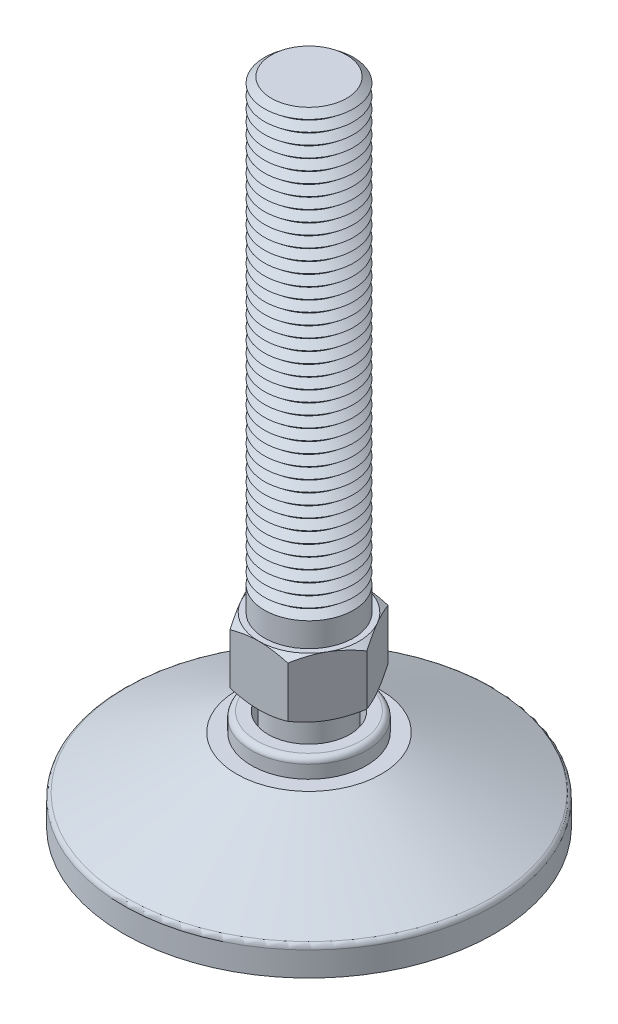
ISO-10303-21;
HEADER;
FILE_DESCRIPTION(('STEP AP214'),'2;1');
FILE_NAME('part.step','',(''),(''),'','','');
FILE_SCHEMA(('AUTOMOTIVE_DESIGN { 1 0 10303 214 1 1 1 1 }'));
ENDSEC;
DATA;
#1=APPLICATION_CONTEXT('core data for automotive mechanical design processes');
#2=APPLICATION_PROTOCOL_DEFINITION('international standard','automotive_design',2000,#1);
#3=PRODUCT_CONTEXT('',#1,'mechanical');
#4=PRODUCT('Part','Part','',(#3));
#5=PRODUCT_RELATED_PRODUCT_CATEGORY('part','',(#4));
#6=PRODUCT_DEFINITION_FORMATION('','',#4);
#7=PRODUCT_DEFINITION_CONTEXT('part definition',#1,'design');
#8=PRODUCT_DEFINITION('design','',#6,#7);
#9=PRODUCT_DEFINITION_SHAPE('','',#8);
#10=(LENGTH_UNIT() NAMED_UNIT(*) SI_UNIT(.MILLI.,.METRE.));
#11=(NAMED_UNIT(*) PLANE_ANGLE_UNIT() SI_UNIT($,.RADIAN.));
#12=(NAMED_UNIT(*) SI_UNIT($,.STERADIAN.) SOLID_ANGLE_UNIT());
#13=UNCERTAINTY_MEASURE_WITH_UNIT(LENGTH_MEASURE(1.E-05),#10,'distance_accuracy_value','');
#14=(GEOMETRIC_REPRESENTATION_CONTEXT(3) GLOBAL_UNCERTAINTY_ASSIGNED_CONTEXT((#13)) GLOBAL_UNIT_ASSIGNED_CONTEXT((#10,
#11,#12)) REPRESENTATION_CONTEXT('',''));
#15=CARTESIAN_POINT('',(0.,0.,0.));
#16=DIRECTION('',(0.,0.,1.));
#17=DIRECTION('',(1.,0.,0.));
#18=AXIS2_PLACEMENT_3D('',#15,#16,#17);
#19=CARTESIAN_POINT('',(0.,3.,0.));
#20=DIRECTION('',(0.,-1.,0.));
#21=DIRECTION('',(0.,0.,-1.));
#22=AXIS2_PLACEMENT_3D('',#19,#20,#21);
#23=CYLINDRICAL_SURFACE('',#22,47.);
#24=CARTESIAN_POINT('',(0.,3.,0.));
#25=DIRECTION('',(0.,1.,0.));
#26=DIRECTION('',(0.,0.,1.));
#27=AXIS2_PLACEMENT_3D('',#24,#25,#26);
#28=CIRCLE('',#27,47.);
#29=CARTESIAN_POINT('',(0.,3.,47.));
#30=VERTEX_POINT('',#29);
#31=EDGE_CURVE('P0_E10',#30,#30,#28,.T.);
#32=ORIENTED_EDGE('',*,*,#31,.F.);
#33=EDGE_LOOP('',(#32));
#34=FACE_BOUND('',#33,.T.);
#35=CARTESIAN_POINT('',(0.,0.,0.));
#36=DIRECTION('',(0.,1.,0.));
#37=DIRECTION('',(0.,0.,1.));
#38=AXIS2_PLACEMENT_3D('',#35,#36,#37);
#39=CIRCLE('',#38,47.);
#40=CARTESIAN_POINT('',(0.,0.,47.));
#41=VERTEX_POINT('',#40);
#42=EDGE_CURVE('P0_E17',#41,#41,#39,.T.);
#43=ORIENTED_EDGE('',*,*,#42,.T.);
#44=EDGE_LOOP('',(#43));
#45=FACE_BOUND('',#44,.T.);
#46=ADVANCED_FACE('P0_F14',(#34,#45),#23,.T.);
#47=CARTESIAN_POINT('',(0.,3.,0.));
#48=DIRECTION('',(0.,1.,0.));
#49=DIRECTION('',(0.,0.,1.));
#50=AXIS2_PLACEMENT_3D('',#47,#48,#49);
#51=PLANE('',#50);
#52=CARTESIAN_POINT('',(0.,3.,0.));
#53=DIRECTION('',(0.,1.,0.));
#54=DIRECTION('',(0.,0.,1.));
#55=AXIS2_PLACEMENT_3D('',#52,#53,#54);
#56=CIRCLE('',#55,15.6666666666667);
#57=CARTESIAN_POINT('',(0.,3.,15.6666666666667));
#58=VERTEX_POINT('',#57);
#59=EDGE_CURVE('P0_E26',#58,#58,#56,.T.);
#60=ORIENTED_EDGE('',*,*,#59,.F.);
#61=EDGE_LOOP('',(#60));
#62=FACE_BOUND('',#61,.T.);
#63=ORIENTED_EDGE('',*,*,#31,.T.);
#64=EDGE_LOOP('',(#63));
#65=FACE_BOUND('',#64,.T.);
#66=ADVANCED_FACE('P0_F41',(#62,#65),#51,.T.);
#67=CARTESIAN_POINT('',(0.,0.,0.));
#68=DIRECTION('',(0.,1.,0.));
#69=DIRECTION('',(0.,0.,1.));
#70=AXIS2_PLACEMENT_3D('',#67,#68,#69);
#71=PLANE('',#70);
#72=ORIENTED_EDGE('',*,*,#42,.F.);
#73=EDGE_LOOP('',(#72));
#74=FACE_BOUND('',#73,.T.);
#75=ADVANCED_FACE('P0_F37',(#74),#71,.F.);
#76=CARTESIAN_POINT('',(0.,2.,0.));
#77=DIRECTION('',(0.,1.,0.));
#78=DIRECTION('',(0.,0.,1.));
#79=AXIS2_PLACEMENT_3D('',#76,#77,#78);
#80=CYLINDRICAL_SURFACE('',#79,15.6666666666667);
#81=CARTESIAN_POINT('',(0.,2.,0.));
#82=DIRECTION('',(0.,1.,0.));
#83=DIRECTION('',(0.,0.,1.));
#84=AXIS2_PLACEMENT_3D('',#81,#82,#83);
#85=CIRCLE('',#84,15.6666666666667);
#86=CARTESIAN_POINT('',(0.,2.,15.6666666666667));
#87=VERTEX_POINT('',#86);
#88=EDGE_CURVE('P0_E24',#87,#87,#85,.T.);
#89=ORIENTED_EDGE('',*,*,#88,.F.);
#90=EDGE_LOOP('',(#89));
#91=FACE_BOUND('',#90,.T.);
#92=ORIENTED_EDGE('',*,*,#59,.T.);
#93=EDGE_LOOP('',(#92));
#94=FACE_BOUND('',#93,.T.);
#95=ADVANCED_FACE('P0_F34',(#91,#94),#80,.F.);
#96=CARTESIAN_POINT('',(0.,2.,0.));
#97=DIRECTION('',(0.,1.,0.));
#98=DIRECTION('',(0.,0.,1.));
#99=AXIS2_PLACEMENT_3D('',#96,#97,#98);
#100=PLANE('',#99);
#101=ORIENTED_EDGE('',*,*,#88,.T.);
#102=EDGE_LOOP('',(#101));
#103=FACE_BOUND('',#102,.T.);
#104=ADVANCED_FACE('P0_F32',(#103),#100,.T.);
#105=CLOSED_SHELL('',(#46,#66,#75,#95,#104));
#106=MANIFOLD_SOLID_BREP('P0_B1',#105);
#107=CARTESIAN_POINT('',(0.,165.,0.));
#108=DIRECTION('',(0.,-1.,0.));
#109=DIRECTION('',(0.,0.,-1.));
#110=AXIS2_PLACEMENT_3D('',#107,#108,#109);
#111=CONICAL_SURFACE('',#110,10.1265006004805,0.895664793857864);
#112=CARTESIAN_POINT('',(0.,163.5,0.));
#113=DIRECTION('',(0.,-1.,0.));
#114=DIRECTION('',(0.,0.,-1.));
#115=AXIS2_PLACEMENT_3D('',#112,#113,#114);
#116=CIRCLE('',#115,12.);
#117=CARTESIAN_POINT('',(0.,163.5,-12.));
#118=VERTEX_POINT('',#117);
#119=EDGE_CURVE('P1_E1508',#118,#118,#116,.T.);
#120=ORIENTED_EDGE('',*,*,#119,.F.);
#121=EDGE_LOOP('',(#120));
#122=FACE_BOUND('',#121,.T.);
#123=CARTESIAN_POINT('',(0.,165.,0.));
#124=DIRECTION('',(0.,-1.,0.));
#125=DIRECTION('',(0.,0.,-1.));
#126=AXIS2_PLACEMENT_3D('',#123,#124,#125);
#127=CIRCLE('',#126,10.1265006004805);
#128=CARTESIAN_POINT('',(0.,165.,-10.1265006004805));
#129=VERTEX_POINT('',#128);
#130=EDGE_CURVE('P1_E1517',#129,#129,#127,.T.);
#131=ORIENTED_EDGE('',*,*,#130,.T.);
#132=EDGE_LOOP('',(#131));
#133=FACE_BOUND('',#132,.T.);
#134=ADVANCED_FACE('P1_F16',(#122,#133),#111,.T.);
#135=CARTESIAN_POINT('',(0.,166.5,0.));
#136=DIRECTION('',(0.,1.,0.));
#137=DIRECTION('',(0.,0.,1.));
#138=AXIS2_PLACEMENT_3D('',#135,#136,#137);
#139=CONICAL_SURFACE('',#138,12.,0.895664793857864);
#140=ORIENTED_EDGE('',*,*,#130,.F.);
#141=EDGE_LOOP('',(#140));
#142=FACE_BOUND('',#141,.T.);
#143=CARTESIAN_POINT('',(0.,166.5,0.));
#144=DIRECTION('',(0.,-1.,0.));
#145=DIRECTION('',(0.,0.,-1.));
#146=AXIS2_PLACEMENT_3D('',#143,#144,#145);
#147=CIRCLE('',#146,12.);
#148=CARTESIAN_POINT('',(0.,166.5,-12.));
#149=VERTEX_POINT('',#148);
#150=EDGE_CURVE('P1_E1514',#149,#149,#147,.T.);
#151=ORIENTED_EDGE('',*,*,#150,.T.);
#152=EDGE_LOOP('',(#151));
#153=FACE_BOUND('',#152,.T.);
#154=ADVANCED_FACE('P1_F308',(#142,#153),#139,.T.);
#155=CARTESIAN_POINT('',(0.,177.,0.));
#156=DIRECTION('',(0.,1.,0.));
#157=DIRECTION('',(0.,0.,1.));
#158=AXIS2_PLACEMENT_3D('',#155,#156,#157);
#159=PLANE('',#158);
#160=CARTESIAN_POINT('',(0.,177.,0.));
#161=DIRECTION('',(0.,-1.,0.));
#162=DIRECTION('',(0.,0.,-1.));
#163=AXIS2_PLACEMENT_3D('',#160,#161,#162);
#164=CIRCLE('',#163,10.1265006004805);
#165=CARTESIAN_POINT('',(0.,177.,-10.1265006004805));
#166=VERTEX_POINT('',#165);
#167=EDGE_CURVE('P1_E143',#166,#166,#164,.T.);
#168=ORIENTED_EDGE('',*,*,#167,.F.);
#169=EDGE_LOOP('',(#168));
#170=FACE_BOUND('',#169,.T.);
#171=ADVANCED_FACE('P1_F314',(#170),#159,.T.);
#172=CARTESIAN_POINT('',(0.,177.,0.));
#173=DIRECTION('',(0.,-1.,0.));
#174=DIRECTION('',(0.,0.,-1.));
#175=AXIS2_PLACEMENT_3D('',#172,#173,#174);
#176=CONICAL_SURFACE('',#175,10.1265006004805,0.895664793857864);
#177=CARTESIAN_POINT('',(0.,175.5,0.));
#178=DIRECTION('',(0.,-1.,0.));
#179=DIRECTION('',(0.,0.,-1.));
#180=AXIS2_PLACEMENT_3D('',#177,#178,#179);
#181=CIRCLE('',#180,12.);
#182=CARTESIAN_POINT('',(0.,175.5,-12.));
#183=VERTEX_POINT('',#182);
#184=EDGE_CURVE('P1_E353',#183,#183,#181,.T.);
#185=ORIENTED_EDGE('',*,*,#184,.F.);
#186=EDGE_LOOP('',(#185));
#187=FACE_BOUND('',#186,.T.);
#188=ORIENTED_EDGE('',*,*,#167,.T.);
#189=EDGE_LOOP('',(#188));
#190=FACE_BOUND('',#189,.T.);
#191=ADVANCED_FACE('P1_F211',(#187,#190),#176,.T.);
#192=CARTESIAN_POINT('',(0.,175.5,0.));
#193=DIRECTION('',(0.,1.,0.));
#194=DIRECTION('',(0.,0.,1.));
#195=AXIS2_PLACEMENT_3D('',#192,#193,#194);
#196=CONICAL_SURFACE('',#195,12.,0.895664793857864);
#197=CARTESIAN_POINT('',(0.,174.,0.));
#198=DIRECTION('',(0.,-1.,0.));
#199=DIRECTION('',(0.,0.,-1.));
#200=AXIS2_PLACEMENT_3D('',#197,#198,#199);
#201=CIRCLE('',#200,10.1265006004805);
#202=CARTESIAN_POINT('',(0.,174.,-10.1265006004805));
#203=VERTEX_POINT('',#202);
#204=EDGE_CURVE('P1_E352',#203,#203,#201,.T.);
#205=ORIENTED_EDGE('',*,*,#204,.F.);
#206=EDGE_LOOP('',(#205));
#207=FACE_BOUND('',#206,.T.);
#208=ORIENTED_EDGE('',*,*,#184,.T.);
#209=EDGE_LOOP('',(#208));
#210=FACE_BOUND('',#209,.T.);
#211=ADVANCED_FACE('P1_F339',(#207,#210),#196,.T.);
#212=CARTESIAN_POINT('',(0.,174.,0.));
#213=DIRECTION('',(0.,-1.,0.));
#214=DIRECTION('',(0.,0.,-1.));
#215=AXIS2_PLACEMENT_3D('',#212,#213,#214);
#216=CONICAL_SURFACE('',#215,10.1265006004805,0.895664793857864);
#217=CARTESIAN_POINT('',(0.,172.5,0.));
#218=DIRECTION('',(0.,-1.,0.));
#219=DIRECTION('',(0.,0.,-1.));
#220=AXIS2_PLACEMENT_3D('',#217,#218,#219);
#221=CIRCLE('',#220,12.);
#222=CARTESIAN_POINT('',(0.,172.5,-12.));
#223=VERTEX_POINT('',#222);
#224=EDGE_CURVE('P1_E349',#223,#223,#221,.T.);
#225=ORIENTED_EDGE('',*,*,#224,.F.);
#226=EDGE_LOOP('',(#225));
#227=FACE_BOUND('',#226,.T.);
#228=ORIENTED_EDGE('',*,*,#204,.T.);
#229=EDGE_LOOP('',(#228));
#230=FACE_BOUND('',#229,.T.);
#231=ADVANCED_FACE('P1_F334',(#227,#230),#216,.T.);
#232=CARTESIAN_POINT('',(0.,172.5,0.));
#233=DIRECTION('',(0.,1.,0.));
#234=DIRECTION('',(0.,0.,1.));
#235=AXIS2_PLACEMENT_3D('',#232,#233,#234);
#236=CONICAL_SURFACE('',#235,12.,0.895664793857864);
#237=CARTESIAN_POINT('',(0.,171.,0.));
#238=DIRECTION('',(0.,-1.,0.));
#239=DIRECTION('',(0.,0.,-1.));
#240=AXIS2_PLACEMENT_3D('',#237,#238,#239);
#241=CIRCLE('',#240,10.1265006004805);
#242=CARTESIAN_POINT('',(0.,171.,-10.1265006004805));
#243=VERTEX_POINT('',#242);
#244=EDGE_CURVE('P1_E358',#243,#243,#241,.T.);
#245=ORIENTED_EDGE('',*,*,#244,.F.);
#246=EDGE_LOOP('',(#245));
#247=FACE_BOUND('',#246,.T.);
#248=ORIENTED_EDGE('',*,*,#224,.T.);
#249=EDGE_LOOP('',(#248));
#250=FACE_BOUND('',#249,.T.);
#251=ADVANCED_FACE('P1_F331',(#247,#250),#236,.T.);
#252=CARTESIAN_POINT('',(0.,171.,0.));
#253=DIRECTION('',(0.,-1.,0.));
#254=DIRECTION('',(0.,0.,-1.));
#255=AXIS2_PLACEMENT_3D('',#252,#253,#254);
#256=CONICAL_SURFACE('',#255,10.1265006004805,0.895664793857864);
#257=CARTESIAN_POINT('',(0.,169.5,0.));
#258=DIRECTION('',(0.,-1.,0.));
#259=DIRECTION('',(0.,0.,-1.));
#260=AXIS2_PLACEMENT_3D('',#257,#258,#259);
#261=CIRCLE('',#260,12.);
#262=CARTESIAN_POINT('',(0.,169.5,-12.));
#263=VERTEX_POINT('',#262);
#264=EDGE_CURVE('P1_E1520',#263,#263,#261,.T.);
#265=ORIENTED_EDGE('',*,*,#264,.F.);
#266=EDGE_LOOP('',(#265));
#267=FACE_BOUND('',#266,.T.);
#268=ORIENTED_EDGE('',*,*,#244,.T.);
#269=EDGE_LOOP('',(#268));
#270=FACE_BOUND('',#269,.T.);
#271=ADVANCED_FACE('P1_F325',(#267,#270),#256,.T.);
#272=CARTESIAN_POINT('',(0.,169.5,0.));
#273=DIRECTION('',(0.,1.,0.));
#274=DIRECTION('',(0.,0.,1.));
#275=AXIS2_PLACEMENT_3D('',#272,#273,#274);
#276=CONICAL_SURFACE('',#275,12.,0.895664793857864);
#277=CARTESIAN_POINT('',(0.,168.,0.));
#278=DIRECTION('',(0.,-1.,0.));
#279=DIRECTION('',(0.,0.,-1.));
#280=AXIS2_PLACEMENT_3D('',#277,#278,#279);
#281=CIRCLE('',#280,10.1265006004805);
#282=CARTESIAN_POINT('',(0.,168.,-10.1265006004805));
#283=VERTEX_POINT('',#282);
#284=EDGE_CURVE('P1_E1523',#283,#283,#281,.T.);
#285=ORIENTED_EDGE('',*,*,#284,.F.);
#286=EDGE_LOOP('',(#285));
#287=FACE_BOUND('',#286,.T.);
#288=ORIENTED_EDGE('',*,*,#264,.T.);
#289=EDGE_LOOP('',(#288));
#290=FACE_BOUND('',#289,.T.);
#291=ADVANCED_FACE('P1_F321',(#287,#290),#276,.T.);
#292=CARTESIAN_POINT('',(0.,168.,0.));
#293=DIRECTION('',(0.,-1.,0.));
#294=DIRECTION('',(0.,0.,-1.));
#295=AXIS2_PLACEMENT_3D('',#292,#293,#294);
#296=CONICAL_SURFACE('',#295,10.1265006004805,0.895664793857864);
#297=ORIENTED_EDGE('',*,*,#150,.F.);
#298=EDGE_LOOP('',(#297));
#299=FACE_BOUND('',#298,.T.);
#300=ORIENTED_EDGE('',*,*,#284,.T.);
#301=EDGE_LOOP('',(#300));
#302=FACE_BOUND('',#301,.T.);
#303=ADVANCED_FACE('P1_F324',(#299,#302),#296,.T.);
#304=CARTESIAN_POINT('',(0.,162.,0.));
#305=DIRECTION('',(0.,-1.,0.));
#306=DIRECTION('',(0.,0.,-1.));
#307=AXIS2_PLACEMENT_3D('',#304,#305,#306);
#308=CONICAL_SURFACE('',#307,10.1265006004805,0.895664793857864);
#309=CARTESIAN_POINT('',(0.,160.5,0.));
#310=DIRECTION('',(0.,-1.,0.));
#311=DIRECTION('',(0.,0.,-1.));
#312=AXIS2_PLACEMENT_3D('',#309,#310,#311);
#313=CIRCLE('',#312,12.);
#314=CARTESIAN_POINT('',(0.,160.5,-12.));
#315=VERTEX_POINT('',#314);
#316=EDGE_CURVE('P1_E1502',#315,#315,#313,.T.);
#317=ORIENTED_EDGE('',*,*,#316,.F.);
#318=EDGE_LOOP('',(#317));
#319=FACE_BOUND('',#318,.T.);
#320=CARTESIAN_POINT('',(0.,162.,0.));
#321=DIRECTION('',(0.,-1.,0.));
#322=DIRECTION('',(0.,0.,-1.));
#323=AXIS2_PLACEMENT_3D('',#320,#321,#322);
#324=CIRCLE('',#323,10.1265006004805);
#325=CARTESIAN_POINT('',(0.,162.,-10.1265006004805));
#326=VERTEX_POINT('',#325);
#327=EDGE_CURVE('P1_E1511',#326,#326,#324,.T.);
#328=ORIENTED_EDGE('',*,*,#327,.T.);
#329=EDGE_LOOP('',(#328));
#330=FACE_BOUND('',#329,.T.);
#331=ADVANCED_FACE('P1_F329',(#319,#330),#308,.T.);
#332=CARTESIAN_POINT('',(0.,163.5,0.));
#333=DIRECTION('',(0.,1.,0.));
#334=DIRECTION('',(0.,0.,1.));
#335=AXIS2_PLACEMENT_3D('',#332,#333,#334);
#336=CONICAL_SURFACE('',#335,12.,0.895664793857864);
#337=ORIENTED_EDGE('',*,*,#327,.F.);
#338=EDGE_LOOP('',(#337));
#339=FACE_BOUND('',#338,.T.);
#340=ORIENTED_EDGE('',*,*,#119,.T.);
#341=EDGE_LOOP('',(#340));
#342=FACE_BOUND('',#341,.T.);
#343=ADVANCED_FACE('P1_F1204',(#339,#342),#336,.T.);
#344=CARTESIAN_POINT('',(0.,159.,0.));
#345=DIRECTION('',(0.,-1.,0.));
#346=DIRECTION('',(0.,0.,-1.));
#347=AXIS2_PLACEMENT_3D('',#344,#345,#346);
#348=CONICAL_SURFACE('',#347,10.1265006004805,0.895664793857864);
#349=CARTESIAN_POINT('',(0.,157.5,0.));
#350=DIRECTION('',(0.,-1.,0.));
#351=DIRECTION('',(0.,0.,-1.));
#352=AXIS2_PLACEMENT_3D('',#349,#350,#351);
#353=CIRCLE('',#352,12.);
#354=CARTESIAN_POINT('',(0.,157.5,-12.));
#355=VERTEX_POINT('',#354);
#356=EDGE_CURVE('P1_E1496',#355,#355,#353,.T.);
#357=ORIENTED_EDGE('',*,*,#356,.F.);
#358=EDGE_LOOP('',(#357));
#359=FACE_BOUND('',#358,.T.);
#360=CARTESIAN_POINT('',(0.,159.,0.));
#361=DIRECTION('',(0.,-1.,0.));
#362=DIRECTION('',(0.,0.,-1.));
#363=AXIS2_PLACEMENT_3D('',#360,#361,#362);
#364=CIRCLE('',#363,10.1265006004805);
#365=CARTESIAN_POINT('',(0.,159.,-10.1265006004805));
#366=VERTEX_POINT('',#365);
#367=EDGE_CURVE('P1_E1505',#366,#366,#364,.T.);
#368=ORIENTED_EDGE('',*,*,#367,.T.);
#369=EDGE_LOOP('',(#368));
#370=FACE_BOUND('',#369,.T.);
#371=ADVANCED_FACE('P1_F1194',(#359,#370),#348,.T.);
#372=CARTESIAN_POINT('',(0.,160.5,0.));
#373=DIRECTION('',(0.,1.,0.));
#374=DIRECTION('',(0.,0.,1.));
#375=AXIS2_PLACEMENT_3D('',#372,#373,#374);
#376=CONICAL_SURFACE('',#375,12.,0.895664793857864);
#377=ORIENTED_EDGE('',*,*,#367,.F.);
#378=EDGE_LOOP('',(#377));
#379=FACE_BOUND('',#378,.T.);
#380=ORIENTED_EDGE('',*,*,#316,.T.);
#381=EDGE_LOOP('',(#380));
#382=FACE_BOUND('',#381,.T.);
#383=ADVANCED_FACE('P1_F1184',(#379,#382),#376,.T.);
#384=CARTESIAN_POINT('',(0.,156.,0.));
#385=DIRECTION('',(0.,-1.,0.));
#386=DIRECTION('',(0.,0.,-1.));
#387=AXIS2_PLACEMENT_3D('',#384,#385,#386);
#388=CONICAL_SURFACE('',#387,10.1265006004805,0.895664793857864);
#389=CARTESIAN_POINT('',(0.,154.5,0.));
#390=DIRECTION('',(0.,-1.,0.));
#391=DIRECTION('',(0.,0.,-1.));
#392=AXIS2_PLACEMENT_3D('',#389,#390,#391);
#393=CIRCLE('',#392,12.);
#394=CARTESIAN_POINT('',(0.,154.5,-12.));
#395=VERTEX_POINT('',#394);
#396=EDGE_CURVE('P1_E1490',#395,#395,#393,.T.);
#397=ORIENTED_EDGE('',*,*,#396,.F.);
#398=EDGE_LOOP('',(#397));
#399=FACE_BOUND('',#398,.T.);
#400=CARTESIAN_POINT('',(0.,156.,0.));
#401=DIRECTION('',(0.,-1.,0.));
#402=DIRECTION('',(0.,0.,-1.));
#403=AXIS2_PLACEMENT_3D('',#400,#401,#402);
#404=CIRCLE('',#403,10.1265006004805);
#405=CARTESIAN_POINT('',(0.,156.,-10.1265006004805));
#406=VERTEX_POINT('',#405);
#407=EDGE_CURVE('P1_E1499',#406,#406,#404,.T.);
#408=ORIENTED_EDGE('',*,*,#407,.T.);
#409=EDGE_LOOP('',(#408));
#410=FACE_BOUND('',#409,.T.);
#411=ADVANCED_FACE('P1_F1174',(#399,#410),#388,.T.);
#412=CARTESIAN_POINT('',(0.,157.5,0.));
#413=DIRECTION('',(0.,1.,0.));
#414=DIRECTION('',(0.,0.,1.));
#415=AXIS2_PLACEMENT_3D('',#412,#413,#414);
#416=CONICAL_SURFACE('',#415,12.,0.895664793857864);
#417=ORIENTED_EDGE('',*,*,#407,.F.);
#418=EDGE_LOOP('',(#417));
#419=FACE_BOUND('',#418,.T.);
#420=ORIENTED_EDGE('',*,*,#356,.T.);
#421=EDGE_LOOP('',(#420));
#422=FACE_BOUND('',#421,.T.);
#423=ADVANCED_FACE('P1_F1164',(#419,#422),#416,.T.);
#424=CARTESIAN_POINT('',(0.,153.,0.));
#425=DIRECTION('',(0.,-1.,0.));
#426=DIRECTION('',(0.,0.,-1.));
#427=AXIS2_PLACEMENT_3D('',#424,#425,#426);
#428=CONICAL_SURFACE('',#427,10.1265006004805,0.895664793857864);
#429=CARTESIAN_POINT('',(0.,151.5,0.));
#430=DIRECTION('',(0.,-1.,0.));
#431=DIRECTION('',(0.,0.,-1.));
#432=AXIS2_PLACEMENT_3D('',#429,#430,#431);
#433=CIRCLE('',#432,12.);
#434=CARTESIAN_POINT('',(0.,151.5,-12.));
#435=VERTEX_POINT('',#434);
#436=EDGE_CURVE('P1_E1484',#435,#435,#433,.T.);
#437=ORIENTED_EDGE('',*,*,#436,.F.);
#438=EDGE_LOOP('',(#437));
#439=FACE_BOUND('',#438,.T.);
#440=CARTESIAN_POINT('',(0.,153.,0.));
#441=DIRECTION('',(0.,-1.,0.));
#442=DIRECTION('',(0.,0.,-1.));
#443=AXIS2_PLACEMENT_3D('',#440,#441,#442);
#444=CIRCLE('',#443,10.1265006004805);
#445=CARTESIAN_POINT('',(0.,153.,-10.1265006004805));
#446=VERTEX_POINT('',#445);
#447=EDGE_CURVE('P1_E1493',#446,#446,#444,.T.);
#448=ORIENTED_EDGE('',*,*,#447,.T.);
#449=EDGE_LOOP('',(#448));
#450=FACE_BOUND('',#449,.T.);
#451=ADVANCED_FACE('P1_F1154',(#439,#450),#428,.T.);
#452=CARTESIAN_POINT('',(0.,154.5,0.));
#453=DIRECTION('',(0.,1.,0.));
#454=DIRECTION('',(0.,0.,1.));
#455=AXIS2_PLACEMENT_3D('',#452,#453,#454);
#456=CONICAL_SURFACE('',#455,12.,0.895664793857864);
#457=ORIENTED_EDGE('',*,*,#447,.F.);
#458=EDGE_LOOP('',(#457));
#459=FACE_BOUND('',#458,.T.);
#460=ORIENTED_EDGE('',*,*,#396,.T.);
#461=EDGE_LOOP('',(#460));
#462=FACE_BOUND('',#461,.T.);
#463=ADVANCED_FACE('P1_F1144',(#459,#462),#456,.T.);
#464=CARTESIAN_POINT('',(0.,150.,0.));
#465=DIRECTION('',(0.,-1.,0.));
#466=DIRECTION('',(0.,0.,-1.));
#467=AXIS2_PLACEMENT_3D('',#464,#465,#466);
#468=CONICAL_SURFACE('',#467,10.1265006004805,0.895664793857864);
#469=CARTESIAN_POINT('',(0.,148.5,0.));
#470=DIRECTION('',(0.,-1.,0.));
#471=DIRECTION('',(0.,0.,-1.));
#472=AXIS2_PLACEMENT_3D('',#469,#470,#471);
#473=CIRCLE('',#472,12.);
#474=CARTESIAN_POINT('',(0.,148.5,-12.));
#475=VERTEX_POINT('',#474);
#476=EDGE_CURVE('P1_E1478',#475,#475,#473,.T.);
#477=ORIENTED_EDGE('',*,*,#476,.F.);
#478=EDGE_LOOP('',(#477));
#479=FACE_BOUND('',#478,.T.);
#480=CARTESIAN_POINT('',(0.,150.,0.));
#481=DIRECTION('',(0.,-1.,0.));
#482=DIRECTION('',(0.,0.,-1.));
#483=AXIS2_PLACEMENT_3D('',#480,#481,#482);
#484=CIRCLE('',#483,10.1265006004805);
#485=CARTESIAN_POINT('',(0.,150.,-10.1265006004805));
#486=VERTEX_POINT('',#485);
#487=EDGE_CURVE('P1_E1487',#486,#486,#484,.T.);
#488=ORIENTED_EDGE('',*,*,#487,.T.);
#489=EDGE_LOOP('',(#488));
#490=FACE_BOUND('',#489,.T.);
#491=ADVANCED_FACE('P1_F1134',(#479,#490),#468,.T.);
#492=CARTESIAN_POINT('',(0.,151.5,0.));
#493=DIRECTION('',(0.,1.,0.));
#494=DIRECTION('',(0.,0.,1.));
#495=AXIS2_PLACEMENT_3D('',#492,#493,#494);
#496=CONICAL_SURFACE('',#495,12.,0.895664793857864);
#497=ORIENTED_EDGE('',*,*,#487,.F.);
#498=EDGE_LOOP('',(#497));
#499=FACE_BOUND('',#498,.T.);
#500=ORIENTED_EDGE('',*,*,#436,.T.);
#501=EDGE_LOOP('',(#500));
#502=FACE_BOUND('',#501,.T.);
#503=ADVANCED_FACE('P1_F1124',(#499,#502),#496,.T.);
#504=CARTESIAN_POINT('',(0.,147.,0.));
#505=DIRECTION('',(0.,-1.,0.));
#506=DIRECTION('',(0.,0.,-1.));
#507=AXIS2_PLACEMENT_3D('',#504,#505,#506);
#508=CONICAL_SURFACE('',#507,10.1265006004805,0.895664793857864);
#509=CARTESIAN_POINT('',(0.,145.5,0.));
#510=DIRECTION('',(0.,-1.,0.));
#511=DIRECTION('',(0.,0.,-1.));
#512=AXIS2_PLACEMENT_3D('',#509,#510,#511);
#513=CIRCLE('',#512,12.);
#514=CARTESIAN_POINT('',(0.,145.5,-12.));
#515=VERTEX_POINT('',#514);
#516=EDGE_CURVE('P1_E1472',#515,#515,#513,.T.);
#517=ORIENTED_EDGE('',*,*,#516,.F.);
#518=EDGE_LOOP('',(#517));
#519=FACE_BOUND('',#518,.T.);
#520=CARTESIAN_POINT('',(0.,147.,0.));
#521=DIRECTION('',(0.,-1.,0.));
#522=DIRECTION('',(0.,0.,-1.));
#523=AXIS2_PLACEMENT_3D('',#520,#521,#522);
#524=CIRCLE('',#523,10.1265006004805);
#525=CARTESIAN_POINT('',(0.,147.,-10.1265006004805));
#526=VERTEX_POINT('',#525);
#527=EDGE_CURVE('P1_E1481',#526,#526,#524,.T.);
#528=ORIENTED_EDGE('',*,*,#527,.T.);
#529=EDGE_LOOP('',(#528));
#530=FACE_BOUND('',#529,.T.);
#531=ADVANCED_FACE('P1_F1114',(#519,#530),#508,.T.);
#532=CARTESIAN_POINT('',(0.,148.5,0.));
#533=DIRECTION('',(0.,1.,0.));
#534=DIRECTION('',(0.,0.,1.));
#535=AXIS2_PLACEMENT_3D('',#532,#533,#534);
#536=CONICAL_SURFACE('',#535,12.,0.895664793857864);
#537=ORIENTED_EDGE('',*,*,#527,.F.);
#538=EDGE_LOOP('',(#537));
#539=FACE_BOUND('',#538,.T.);
#540=ORIENTED_EDGE('',*,*,#476,.T.);
#541=EDGE_LOOP('',(#540));
#542=FACE_BOUND('',#541,.T.);
#543=ADVANCED_FACE('P1_F1104',(#539,#542),#536,.T.);
#544=CARTESIAN_POINT('',(0.,144.,0.));
#545=DIRECTION('',(0.,-1.,0.));
#546=DIRECTION('',(0.,0.,-1.));
#547=AXIS2_PLACEMENT_3D('',#544,#545,#546);
#548=CONICAL_SURFACE('',#547,10.1265006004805,0.895664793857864);
#549=CARTESIAN_POINT('',(0.,142.5,0.));
#550=DIRECTION('',(0.,-1.,0.));
#551=DIRECTION('',(0.,0.,-1.));
#552=AXIS2_PLACEMENT_3D('',#549,#550,#551);
#553=CIRCLE('',#552,12.);
#554=CARTESIAN_POINT('',(0.,142.5,-12.));
#555=VERTEX_POINT('',#554);
#556=EDGE_CURVE('P1_E1466',#555,#555,#553,.T.);
#557=ORIENTED_EDGE('',*,*,#556,.F.);
#558=EDGE_LOOP('',(#557));
#559=FACE_BOUND('',#558,.T.);
#560=CARTESIAN_POINT('',(0.,144.,0.));
#561=DIRECTION('',(0.,-1.,0.));
#562=DIRECTION('',(0.,0.,-1.));
#563=AXIS2_PLACEMENT_3D('',#560,#561,#562);
#564=CIRCLE('',#563,10.1265006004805);
#565=CARTESIAN_POINT('',(0.,144.,-10.1265006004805));
#566=VERTEX_POINT('',#565);
#567=EDGE_CURVE('P1_E1475',#566,#566,#564,.T.);
#568=ORIENTED_EDGE('',*,*,#567,.T.);
#569=EDGE_LOOP('',(#568));
#570=FACE_BOUND('',#569,.T.);
#571=ADVANCED_FACE('P1_F1094',(#559,#570),#548,.T.);
#572=CARTESIAN_POINT('',(0.,145.5,0.));
#573=DIRECTION('',(0.,1.,0.));
#574=DIRECTION('',(0.,0.,1.));
#575=AXIS2_PLACEMENT_3D('',#572,#573,#574);
#576=CONICAL_SURFACE('',#575,12.,0.895664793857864);
#577=ORIENTED_EDGE('',*,*,#567,.F.);
#578=EDGE_LOOP('',(#577));
#579=FACE_BOUND('',#578,.T.);
#580=ORIENTED_EDGE('',*,*,#516,.T.);
#581=EDGE_LOOP('',(#580));
#582=FACE_BOUND('',#581,.T.);
#583=ADVANCED_FACE('P1_F1084',(#579,#582),#576,.T.);
#584=CARTESIAN_POINT('',(0.,141.,0.));
#585=DIRECTION('',(0.,-1.,0.));
#586=DIRECTION('',(0.,0.,-1.));
#587=AXIS2_PLACEMENT_3D('',#584,#585,#586);
#588=CONICAL_SURFACE('',#587,10.1265006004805,0.895664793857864);
#589=CARTESIAN_POINT('',(0.,139.5,0.));
#590=DIRECTION('',(0.,-1.,0.));
#591=DIRECTION('',(0.,0.,-1.));
#592=AXIS2_PLACEMENT_3D('',#589,#590,#591);
#593=CIRCLE('',#592,12.);
#594=CARTESIAN_POINT('',(0.,139.5,-12.));
#595=VERTEX_POINT('',#594);
#596=EDGE_CURVE('P1_E1460',#595,#595,#593,.T.);
#597=ORIENTED_EDGE('',*,*,#596,.F.);
#598=EDGE_LOOP('',(#597));
#599=FACE_BOUND('',#598,.T.);
#600=CARTESIAN_POINT('',(0.,141.,0.));
#601=DIRECTION('',(0.,-1.,0.));
#602=DIRECTION('',(0.,0.,-1.));
#603=AXIS2_PLACEMENT_3D('',#600,#601,#602);
#604=CIRCLE('',#603,10.1265006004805);
#605=CARTESIAN_POINT('',(0.,141.,-10.1265006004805));
#606=VERTEX_POINT('',#605);
#607=EDGE_CURVE('P1_E1469',#606,#606,#604,.T.);
#608=ORIENTED_EDGE('',*,*,#607,.T.);
#609=EDGE_LOOP('',(#608));
#610=FACE_BOUND('',#609,.T.);
#611=ADVANCED_FACE('P1_F1074',(#599,#610),#588,.T.);
#612=CARTESIAN_POINT('',(0.,142.5,0.));
#613=DIRECTION('',(0.,1.,0.));
#614=DIRECTION('',(0.,0.,1.));
#615=AXIS2_PLACEMENT_3D('',#612,#613,#614);
#616=CONICAL_SURFACE('',#615,12.,0.895664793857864);
#617=ORIENTED_EDGE('',*,*,#607,.F.);
#618=EDGE_LOOP('',(#617));
#619=FACE_BOUND('',#618,.T.);
#620=ORIENTED_EDGE('',*,*,#556,.T.);
#621=EDGE_LOOP('',(#620));
#622=FACE_BOUND('',#621,.T.);
#623=ADVANCED_FACE('P1_F1064',(#619,#622),#616,.T.);
#624=CARTESIAN_POINT('',(0.,138.,0.));
#625=DIRECTION('',(0.,-1.,0.));
#626=DIRECTION('',(0.,0.,-1.));
#627=AXIS2_PLACEMENT_3D('',#624,#625,#626);
#628=CONICAL_SURFACE('',#627,10.1265006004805,0.895664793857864);
#629=CARTESIAN_POINT('',(0.,136.5,0.));
#630=DIRECTION('',(0.,-1.,0.));
#631=DIRECTION('',(0.,0.,-1.));
#632=AXIS2_PLACEMENT_3D('',#629,#630,#631);
#633=CIRCLE('',#632,12.);
#634=CARTESIAN_POINT('',(0.,136.5,-12.));
#635=VERTEX_POINT('',#634);
#636=EDGE_CURVE('P1_E1454',#635,#635,#633,.T.);
#637=ORIENTED_EDGE('',*,*,#636,.F.);
#638=EDGE_LOOP('',(#637));
#639=FACE_BOUND('',#638,.T.);
#640=CARTESIAN_POINT('',(0.,138.,0.));
#641=DIRECTION('',(0.,-1.,0.));
#642=DIRECTION('',(0.,0.,-1.));
#643=AXIS2_PLACEMENT_3D('',#640,#641,#642);
#644=CIRCLE('',#643,10.1265006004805);
#645=CARTESIAN_POINT('',(0.,138.,-10.1265006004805));
#646=VERTEX_POINT('',#645);
#647=EDGE_CURVE('P1_E1463',#646,#646,#644,.T.);
#648=ORIENTED_EDGE('',*,*,#647,.T.);
#649=EDGE_LOOP('',(#648));
#650=FACE_BOUND('',#649,.T.);
#651=ADVANCED_FACE('P1_F1054',(#639,#650),#628,.T.);
#652=CARTESIAN_POINT('',(0.,139.5,0.));
#653=DIRECTION('',(0.,1.,0.));
#654=DIRECTION('',(0.,0.,1.));
#655=AXIS2_PLACEMENT_3D('',#652,#653,#654);
#656=CONICAL_SURFACE('',#655,12.,0.895664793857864);
#657=ORIENTED_EDGE('',*,*,#647,.F.);
#658=EDGE_LOOP('',(#657));
#659=FACE_BOUND('',#658,.T.);
#660=ORIENTED_EDGE('',*,*,#596,.T.);
#661=EDGE_LOOP('',(#660));
#662=FACE_BOUND('',#661,.T.);
#663=ADVANCED_FACE('P1_F1044',(#659,#662),#656,.T.);
#664=CARTESIAN_POINT('',(0.,135.,0.));
#665=DIRECTION('',(0.,-1.,0.));
#666=DIRECTION('',(0.,0.,-1.));
#667=AXIS2_PLACEMENT_3D('',#664,#665,#666);
#668=CONICAL_SURFACE('',#667,10.1265006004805,0.895664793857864);
#669=CARTESIAN_POINT('',(0.,133.5,0.));
#670=DIRECTION('',(0.,-1.,0.));
#671=DIRECTION('',(0.,0.,-1.));
#672=AXIS2_PLACEMENT_3D('',#669,#670,#671);
#673=CIRCLE('',#672,12.);
#674=CARTESIAN_POINT('',(0.,133.5,-12.));
#675=VERTEX_POINT('',#674);
#676=EDGE_CURVE('P1_E1448',#675,#675,#673,.T.);
#677=ORIENTED_EDGE('',*,*,#676,.F.);
#678=EDGE_LOOP('',(#677));
#679=FACE_BOUND('',#678,.T.);
#680=CARTESIAN_POINT('',(0.,135.,0.));
#681=DIRECTION('',(0.,-1.,0.));
#682=DIRECTION('',(0.,0.,-1.));
#683=AXIS2_PLACEMENT_3D('',#680,#681,#682);
#684=CIRCLE('',#683,10.1265006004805);
#685=CARTESIAN_POINT('',(0.,135.,-10.1265006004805));
#686=VERTEX_POINT('',#685);
#687=EDGE_CURVE('P1_E1457',#686,#686,#684,.T.);
#688=ORIENTED_EDGE('',*,*,#687,.T.);
#689=EDGE_LOOP('',(#688));
#690=FACE_BOUND('',#689,.T.);
#691=ADVANCED_FACE('P1_F1034',(#679,#690),#668,.T.);
#692=CARTESIAN_POINT('',(0.,136.5,0.));
#693=DIRECTION('',(0.,1.,0.));
#694=DIRECTION('',(0.,0.,1.));
#695=AXIS2_PLACEMENT_3D('',#692,#693,#694);
#696=CONICAL_SURFACE('',#695,12.,0.895664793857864);
#697=ORIENTED_EDGE('',*,*,#687,.F.);
#698=EDGE_LOOP('',(#697));
#699=FACE_BOUND('',#698,.T.);
#700=ORIENTED_EDGE('',*,*,#636,.T.);
#701=EDGE_LOOP('',(#700));
#702=FACE_BOUND('',#701,.T.);
#703=ADVANCED_FACE('P1_F1024',(#699,#702),#696,.T.);
#704=CARTESIAN_POINT('',(0.,132.,0.));
#705=DIRECTION('',(0.,-1.,0.));
#706=DIRECTION('',(0.,0.,-1.));
#707=AXIS2_PLACEMENT_3D('',#704,#705,#706);
#708=CONICAL_SURFACE('',#707,10.1265006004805,0.895664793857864);
#709=CARTESIAN_POINT('',(0.,130.5,0.));
#710=DIRECTION('',(0.,-1.,0.));
#711=DIRECTION('',(0.,0.,-1.));
#712=AXIS2_PLACEMENT_3D('',#709,#710,#711);
#713=CIRCLE('',#712,12.);
#714=CARTESIAN_POINT('',(0.,130.5,-12.));
#715=VERTEX_POINT('',#714);
#716=EDGE_CURVE('P1_E1442',#715,#715,#713,.T.);
#717=ORIENTED_EDGE('',*,*,#716,.F.);
#718=EDGE_LOOP('',(#717));
#719=FACE_BOUND('',#718,.T.);
#720=CARTESIAN_POINT('',(0.,132.,0.));
#721=DIRECTION('',(0.,-1.,0.));
#722=DIRECTION('',(0.,0.,-1.));
#723=AXIS2_PLACEMENT_3D('',#720,#721,#722);
#724=CIRCLE('',#723,10.1265006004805);
#725=CARTESIAN_POINT('',(0.,132.,-10.1265006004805));
#726=VERTEX_POINT('',#725);
#727=EDGE_CURVE('P1_E1451',#726,#726,#724,.T.);
#728=ORIENTED_EDGE('',*,*,#727,.T.);
#729=EDGE_LOOP('',(#728));
#730=FACE_BOUND('',#729,.T.);
#731=ADVANCED_FACE('P1_F1014',(#719,#730),#708,.T.);
#732=CARTESIAN_POINT('',(0.,133.5,0.));
#733=DIRECTION('',(0.,1.,0.));
#734=DIRECTION('',(0.,0.,1.));
#735=AXIS2_PLACEMENT_3D('',#732,#733,#734);
#736=CONICAL_SURFACE('',#735,12.,0.895664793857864);
#737=ORIENTED_EDGE('',*,*,#727,.F.);
#738=EDGE_LOOP('',(#737));
#739=FACE_BOUND('',#738,.T.);
#740=ORIENTED_EDGE('',*,*,#676,.T.);
#741=EDGE_LOOP('',(#740));
#742=FACE_BOUND('',#741,.T.);
#743=ADVANCED_FACE('P1_F1004',(#739,#742),#736,.T.);
#744=CARTESIAN_POINT('',(0.,129.,0.));
#745=DIRECTION('',(0.,-1.,0.));
#746=DIRECTION('',(0.,0.,-1.));
#747=AXIS2_PLACEMENT_3D('',#744,#745,#746);
#748=CONICAL_SURFACE('',#747,10.1265006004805,0.895664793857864);
#749=CARTESIAN_POINT('',(0.,127.5,0.));
#750=DIRECTION('',(0.,-1.,0.));
#751=DIRECTION('',(0.,0.,-1.));
#752=AXIS2_PLACEMENT_3D('',#749,#750,#751);
#753=CIRCLE('',#752,12.);
#754=CARTESIAN_POINT('',(0.,127.5,-12.));
#755=VERTEX_POINT('',#754);
#756=EDGE_CURVE('P1_E1436',#755,#755,#753,.T.);
#757=ORIENTED_EDGE('',*,*,#756,.F.);
#758=EDGE_LOOP('',(#757));
#759=FACE_BOUND('',#758,.T.);
#760=CARTESIAN_POINT('',(0.,129.,0.));
#761=DIRECTION('',(0.,-1.,0.));
#762=DIRECTION('',(0.,0.,-1.));
#763=AXIS2_PLACEMENT_3D('',#760,#761,#762);
#764=CIRCLE('',#763,10.1265006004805);
#765=CARTESIAN_POINT('',(0.,129.,-10.1265006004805));
#766=VERTEX_POINT('',#765);
#767=EDGE_CURVE('P1_E1445',#766,#766,#764,.T.);
#768=ORIENTED_EDGE('',*,*,#767,.T.);
#769=EDGE_LOOP('',(#768));
#770=FACE_BOUND('',#769,.T.);
#771=ADVANCED_FACE('P1_F994',(#759,#770),#748,.T.);
#772=CARTESIAN_POINT('',(0.,130.5,0.));
#773=DIRECTION('',(0.,1.,0.));
#774=DIRECTION('',(0.,0.,1.));
#775=AXIS2_PLACEMENT_3D('',#772,#773,#774);
#776=CONICAL_SURFACE('',#775,12.,0.895664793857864);
#777=ORIENTED_EDGE('',*,*,#767,.F.);
#778=EDGE_LOOP('',(#777));
#779=FACE_BOUND('',#778,.T.);
#780=ORIENTED_EDGE('',*,*,#716,.T.);
#781=EDGE_LOOP('',(#780));
#782=FACE_BOUND('',#781,.T.);
#783=ADVANCED_FACE('P1_F984',(#779,#782),#776,.T.);
#784=CARTESIAN_POINT('',(0.,126.,0.));
#785=DIRECTION('',(0.,-1.,0.));
#786=DIRECTION('',(0.,0.,-1.));
#787=AXIS2_PLACEMENT_3D('',#784,#785,#786);
#788=CONICAL_SURFACE('',#787,10.1265006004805,0.895664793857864);
#789=CARTESIAN_POINT('',(0.,124.5,0.));
#790=DIRECTION('',(0.,-1.,0.));
#791=DIRECTION('',(0.,0.,-1.));
#792=AXIS2_PLACEMENT_3D('',#789,#790,#791);
#793=CIRCLE('',#792,12.);
#794=CARTESIAN_POINT('',(0.,124.5,-12.));
#795=VERTEX_POINT('',#794);
#796=EDGE_CURVE('P1_E1430',#795,#795,#793,.T.);
#797=ORIENTED_EDGE('',*,*,#796,.F.);
#798=EDGE_LOOP('',(#797));
#799=FACE_BOUND('',#798,.T.);
#800=CARTESIAN_POINT('',(0.,126.,0.));
#801=DIRECTION('',(0.,-1.,0.));
#802=DIRECTION('',(0.,0.,-1.));
#803=AXIS2_PLACEMENT_3D('',#800,#801,#802);
#804=CIRCLE('',#803,10.1265006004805);
#805=CARTESIAN_POINT('',(0.,126.,-10.1265006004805));
#806=VERTEX_POINT('',#805);
#807=EDGE_CURVE('P1_E1439',#806,#806,#804,.T.);
#808=ORIENTED_EDGE('',*,*,#807,.T.);
#809=EDGE_LOOP('',(#808));
#810=FACE_BOUND('',#809,.T.);
#811=ADVANCED_FACE('P1_F974',(#799,#810),#788,.T.);
#812=CARTESIAN_POINT('',(0.,127.5,0.));
#813=DIRECTION('',(0.,1.,0.));
#814=DIRECTION('',(0.,0.,1.));
#815=AXIS2_PLACEMENT_3D('',#812,#813,#814);
#816=CONICAL_SURFACE('',#815,12.,0.895664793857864);
#817=ORIENTED_EDGE('',*,*,#807,.F.);
#818=EDGE_LOOP('',(#817));
#819=FACE_BOUND('',#818,.T.);
#820=ORIENTED_EDGE('',*,*,#756,.T.);
#821=EDGE_LOOP('',(#820));
#822=FACE_BOUND('',#821,.T.);
#823=ADVANCED_FACE('P1_F964',(#819,#822),#816,.T.);
#824=CARTESIAN_POINT('',(0.,123.,0.));
#825=DIRECTION('',(0.,-1.,0.));
#826=DIRECTION('',(0.,0.,-1.));
#827=AXIS2_PLACEMENT_3D('',#824,#825,#826);
#828=CONICAL_SURFACE('',#827,10.1265006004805,0.895664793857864);
#829=CARTESIAN_POINT('',(0.,121.5,0.));
#830=DIRECTION('',(0.,-1.,0.));
#831=DIRECTION('',(0.,0.,-1.));
#832=AXIS2_PLACEMENT_3D('',#829,#830,#831);
#833=CIRCLE('',#832,12.);
#834=CARTESIAN_POINT('',(0.,121.5,-12.));
#835=VERTEX_POINT('',#834);
#836=EDGE_CURVE('P1_E1424',#835,#835,#833,.T.);
#837=ORIENTED_EDGE('',*,*,#836,.F.);
#838=EDGE_LOOP('',(#837));
#839=FACE_BOUND('',#838,.T.);
#840=CARTESIAN_POINT('',(0.,123.,0.));
#841=DIRECTION('',(0.,-1.,0.));
#842=DIRECTION('',(0.,0.,-1.));
#843=AXIS2_PLACEMENT_3D('',#840,#841,#842);
#844=CIRCLE('',#843,10.1265006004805);
#845=CARTESIAN_POINT('',(0.,123.,-10.1265006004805));
#846=VERTEX_POINT('',#845);
#847=EDGE_CURVE('P1_E1433',#846,#846,#844,.T.);
#848=ORIENTED_EDGE('',*,*,#847,.T.);
#849=EDGE_LOOP('',(#848));
#850=FACE_BOUND('',#849,.T.);
#851=ADVANCED_FACE('P1_F954',(#839,#850),#828,.T.);
#852=CARTESIAN_POINT('',(0.,124.5,0.));
#853=DIRECTION('',(0.,1.,0.));
#854=DIRECTION('',(0.,0.,1.));
#855=AXIS2_PLACEMENT_3D('',#852,#853,#854);
#856=CONICAL_SURFACE('',#855,12.,0.895664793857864);
#857=ORIENTED_EDGE('',*,*,#847,.F.);
#858=EDGE_LOOP('',(#857));
#859=FACE_BOUND('',#858,.T.);
#860=ORIENTED_EDGE('',*,*,#796,.T.);
#861=EDGE_LOOP('',(#860));
#862=FACE_BOUND('',#861,.T.);
#863=ADVANCED_FACE('P1_F944',(#859,#862),#856,.T.);
#864=CARTESIAN_POINT('',(0.,120.,0.));
#865=DIRECTION('',(0.,-1.,0.));
#866=DIRECTION('',(0.,0.,-1.));
#867=AXIS2_PLACEMENT_3D('',#864,#865,#866);
#868=CONICAL_SURFACE('',#867,10.1265006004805,0.895664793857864);
#869=CARTESIAN_POINT('',(0.,118.5,0.));
#870=DIRECTION('',(0.,-1.,0.));
#871=DIRECTION('',(0.,0.,-1.));
#872=AXIS2_PLACEMENT_3D('',#869,#870,#871);
#873=CIRCLE('',#872,12.);
#874=CARTESIAN_POINT('',(0.,118.5,-12.));
#875=VERTEX_POINT('',#874);
#876=EDGE_CURVE('P1_E1418',#875,#875,#873,.T.);
#877=ORIENTED_EDGE('',*,*,#876,.F.);
#878=EDGE_LOOP('',(#877));
#879=FACE_BOUND('',#878,.T.);
#880=CARTESIAN_POINT('',(0.,120.,0.));
#881=DIRECTION('',(0.,-1.,0.));
#882=DIRECTION('',(0.,0.,-1.));
#883=AXIS2_PLACEMENT_3D('',#880,#881,#882);
#884=CIRCLE('',#883,10.1265006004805);
#885=CARTESIAN_POINT('',(0.,120.,-10.1265006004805));
#886=VERTEX_POINT('',#885);
#887=EDGE_CURVE('P1_E1427',#886,#886,#884,.T.);
#888=ORIENTED_EDGE('',*,*,#887,.T.);
#889=EDGE_LOOP('',(#888));
#890=FACE_BOUND('',#889,.T.);
#891=ADVANCED_FACE('P1_F934',(#879,#890),#868,.T.);
#892=CARTESIAN_POINT('',(0.,121.5,0.));
#893=DIRECTION('',(0.,1.,0.));
#894=DIRECTION('',(0.,0.,1.));
#895=AXIS2_PLACEMENT_3D('',#892,#893,#894);
#896=CONICAL_SURFACE('',#895,12.,0.895664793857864);
#897=ORIENTED_EDGE('',*,*,#887,.F.);
#898=EDGE_LOOP('',(#897));
#899=FACE_BOUND('',#898,.T.);
#900=ORIENTED_EDGE('',*,*,#836,.T.);
#901=EDGE_LOOP('',(#900));
#902=FACE_BOUND('',#901,.T.);
#903=ADVANCED_FACE('P1_F924',(#899,#902),#896,.T.);
#904=CARTESIAN_POINT('',(0.,117.,0.));
#905=DIRECTION('',(0.,-1.,0.));
#906=DIRECTION('',(0.,0.,-1.));
#907=AXIS2_PLACEMENT_3D('',#904,#905,#906);
#908=CONICAL_SURFACE('',#907,10.1265006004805,0.895664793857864);
#909=CARTESIAN_POINT('',(0.,115.5,0.));
#910=DIRECTION('',(0.,-1.,0.));
#911=DIRECTION('',(0.,0.,-1.));
#912=AXIS2_PLACEMENT_3D('',#909,#910,#911);
#913=CIRCLE('',#912,12.);
#914=CARTESIAN_POINT('',(0.,115.5,-12.));
#915=VERTEX_POINT('',#914);
#916=EDGE_CURVE('P1_E1412',#915,#915,#913,.T.);
#917=ORIENTED_EDGE('',*,*,#916,.F.);
#918=EDGE_LOOP('',(#917));
#919=FACE_BOUND('',#918,.T.);
#920=CARTESIAN_POINT('',(0.,117.,0.));
#921=DIRECTION('',(0.,-1.,0.));
#922=DIRECTION('',(0.,0.,-1.));
#923=AXIS2_PLACEMENT_3D('',#920,#921,#922);
#924=CIRCLE('',#923,10.1265006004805);
#925=CARTESIAN_POINT('',(0.,117.,-10.1265006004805));
#926=VERTEX_POINT('',#925);
#927=EDGE_CURVE('P1_E1421',#926,#926,#924,.T.);
#928=ORIENTED_EDGE('',*,*,#927,.T.);
#929=EDGE_LOOP('',(#928));
#930=FACE_BOUND('',#929,.T.);
#931=ADVANCED_FACE('P1_F914',(#919,#930),#908,.T.);
#932=CARTESIAN_POINT('',(0.,118.5,0.));
#933=DIRECTION('',(0.,1.,0.));
#934=DIRECTION('',(0.,0.,1.));
#935=AXIS2_PLACEMENT_3D('',#932,#933,#934);
#936=CONICAL_SURFACE('',#935,12.,0.895664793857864);
#937=ORIENTED_EDGE('',*,*,#927,.F.);
#938=EDGE_LOOP('',(#937));
#939=FACE_BOUND('',#938,.T.);
#940=ORIENTED_EDGE('',*,*,#876,.T.);
#941=EDGE_LOOP('',(#940));
#942=FACE_BOUND('',#941,.T.);
#943=ADVANCED_FACE('P1_F904',(#939,#942),#936,.T.);
#944=CARTESIAN_POINT('',(0.,114.,0.));
#945=DIRECTION('',(0.,-1.,0.));
#946=DIRECTION('',(0.,0.,-1.));
#947=AXIS2_PLACEMENT_3D('',#944,#945,#946);
#948=CONICAL_SURFACE('',#947,10.1265006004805,0.895664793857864);
#949=CARTESIAN_POINT('',(0.,112.5,0.));
#950=DIRECTION('',(0.,-1.,0.));
#951=DIRECTION('',(0.,0.,-1.));
#952=AXIS2_PLACEMENT_3D('',#949,#950,#951);
#953=CIRCLE('',#952,12.);
#954=CARTESIAN_POINT('',(0.,112.5,-12.));
#955=VERTEX_POINT('',#954);
#956=EDGE_CURVE('P1_E1406',#955,#955,#953,.T.);
#957=ORIENTED_EDGE('',*,*,#956,.F.);
#958=EDGE_LOOP('',(#957));
#959=FACE_BOUND('',#958,.T.);
#960=CARTESIAN_POINT('',(0.,114.,0.));
#961=DIRECTION('',(0.,-1.,0.));
#962=DIRECTION('',(0.,0.,-1.));
#963=AXIS2_PLACEMENT_3D('',#960,#961,#962);
#964=CIRCLE('',#963,10.1265006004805);
#965=CARTESIAN_POINT('',(0.,114.,-10.1265006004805));
#966=VERTEX_POINT('',#965);
#967=EDGE_CURVE('P1_E1415',#966,#966,#964,.T.);
#968=ORIENTED_EDGE('',*,*,#967,.T.);
#969=EDGE_LOOP('',(#968));
#970=FACE_BOUND('',#969,.T.);
#971=ADVANCED_FACE('P1_F894',(#959,#970),#948,.T.);
#972=CARTESIAN_POINT('',(0.,115.5,0.));
#973=DIRECTION('',(0.,1.,0.));
#974=DIRECTION('',(0.,0.,1.));
#975=AXIS2_PLACEMENT_3D('',#972,#973,#974);
#976=CONICAL_SURFACE('',#975,12.,0.895664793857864);
#977=ORIENTED_EDGE('',*,*,#967,.F.);
#978=EDGE_LOOP('',(#977));
#979=FACE_BOUND('',#978,.T.);
#980=ORIENTED_EDGE('',*,*,#916,.T.);
#981=EDGE_LOOP('',(#980));
#982=FACE_BOUND('',#981,.T.);
#983=ADVANCED_FACE('P1_F884',(#979,#982),#976,.T.);
#984=CARTESIAN_POINT('',(0.,111.,0.));
#985=DIRECTION('',(0.,-1.,0.));
#986=DIRECTION('',(0.,0.,-1.));
#987=AXIS2_PLACEMENT_3D('',#984,#985,#986);
#988=CONICAL_SURFACE('',#987,10.1265006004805,0.895664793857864);
#989=CARTESIAN_POINT('',(0.,109.5,0.));
#990=DIRECTION('',(0.,-1.,0.));
#991=DIRECTION('',(0.,0.,-1.));
#992=AXIS2_PLACEMENT_3D('',#989,#990,#991);
#993=CIRCLE('',#992,12.);
#994=CARTESIAN_POINT('',(0.,109.5,-12.));
#995=VERTEX_POINT('',#994);
#996=EDGE_CURVE('P1_E1400',#995,#995,#993,.T.);
#997=ORIENTED_EDGE('',*,*,#996,.F.);
#998=EDGE_LOOP('',(#997));
#999=FACE_BOUND('',#998,.T.);
#1000=CARTESIAN_POINT('',(0.,111.,0.));
#1001=DIRECTION('',(0.,-1.,0.));
#1002=DIRECTION('',(0.,0.,-1.));
#1003=AXIS2_PLACEMENT_3D('',#1000,#1001,#1002);
#1004=CIRCLE('',#1003,10.1265006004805);
#1005=CARTESIAN_POINT('',(0.,111.,-10.1265006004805));
#1006=VERTEX_POINT('',#1005);
#1007=EDGE_CURVE('P1_E1409',#1006,#1006,#1004,.T.);
#1008=ORIENTED_EDGE('',*,*,#1007,.T.);
#1009=EDGE_LOOP('',(#1008));
#1010=FACE_BOUND('',#1009,.T.);
#1011=ADVANCED_FACE('P1_F874',(#999,#1010),#988,.T.);
#1012=CARTESIAN_POINT('',(0.,112.5,0.));
#1013=DIRECTION('',(0.,1.,0.));
#1014=DIRECTION('',(0.,0.,1.));
#1015=AXIS2_PLACEMENT_3D('',#1012,#1013,#1014);
#1016=CONICAL_SURFACE('',#1015,12.,0.895664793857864);
#1017=ORIENTED_EDGE('',*,*,#1007,.F.);
#1018=EDGE_LOOP('',(#1017));
#1019=FACE_BOUND('',#1018,.T.);
#1020=ORIENTED_EDGE('',*,*,#956,.T.);
#1021=EDGE_LOOP('',(#1020));
#1022=FACE_BOUND('',#1021,.T.);
#1023=ADVANCED_FACE('P1_F864',(#1019,#1022),#1016,.T.);
#1024=CARTESIAN_POINT('',(0.,108.,0.));
#1025=DIRECTION('',(0.,-1.,0.));
#1026=DIRECTION('',(0.,0.,-1.));
#1027=AXIS2_PLACEMENT_3D('',#1024,#1025,#1026);
#1028=CONICAL_SURFACE('',#1027,10.1265006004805,0.895664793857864);
#1029=CARTESIAN_POINT('',(0.,106.5,0.));
#1030=DIRECTION('',(0.,-1.,0.));
#1031=DIRECTION('',(0.,0.,-1.));
#1032=AXIS2_PLACEMENT_3D('',#1029,#1030,#1031);
#1033=CIRCLE('',#1032,12.);
#1034=CARTESIAN_POINT('',(0.,106.5,-12.));
#1035=VERTEX_POINT('',#1034);
#1036=EDGE_CURVE('P1_E1394',#1035,#1035,#1033,.T.);
#1037=ORIENTED_EDGE('',*,*,#1036,.F.);
#1038=EDGE_LOOP('',(#1037));
#1039=FACE_BOUND('',#1038,.T.);
#1040=CARTESIAN_POINT('',(0.,108.,0.));
#1041=DIRECTION('',(0.,-1.,0.));
#1042=DIRECTION('',(0.,0.,-1.));
#1043=AXIS2_PLACEMENT_3D('',#1040,#1041,#1042);
#1044=CIRCLE('',#1043,10.1265006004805);
#1045=CARTESIAN_POINT('',(0.,108.,-10.1265006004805));
#1046=VERTEX_POINT('',#1045);
#1047=EDGE_CURVE('P1_E1403',#1046,#1046,#1044,.T.);
#1048=ORIENTED_EDGE('',*,*,#1047,.T.);
#1049=EDGE_LOOP('',(#1048));
#1050=FACE_BOUND('',#1049,.T.);
#1051=ADVANCED_FACE('P1_F854',(#1039,#1050),#1028,.T.);
#1052=CARTESIAN_POINT('',(0.,109.5,0.));
#1053=DIRECTION('',(0.,1.,0.));
#1054=DIRECTION('',(0.,0.,1.));
#1055=AXIS2_PLACEMENT_3D('',#1052,#1053,#1054);
#1056=CONICAL_SURFACE('',#1055,12.,0.895664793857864);
#1057=ORIENTED_EDGE('',*,*,#1047,.F.);
#1058=EDGE_LOOP('',(#1057));
#1059=FACE_BOUND('',#1058,.T.);
#1060=ORIENTED_EDGE('',*,*,#996,.T.);
#1061=EDGE_LOOP('',(#1060));
#1062=FACE_BOUND('',#1061,.T.);
#1063=ADVANCED_FACE('P1_F844',(#1059,#1062),#1056,.T.);
#1064=CARTESIAN_POINT('',(0.,105.,0.));
#1065=DIRECTION('',(0.,-1.,0.));
#1066=DIRECTION('',(0.,0.,-1.));
#1067=AXIS2_PLACEMENT_3D('',#1064,#1065,#1066);
#1068=CONICAL_SURFACE('',#1067,10.1265006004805,0.895664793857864);
#1069=CARTESIAN_POINT('',(0.,103.5,0.));
#1070=DIRECTION('',(0.,-1.,0.));
#1071=DIRECTION('',(0.,0.,-1.));
#1072=AXIS2_PLACEMENT_3D('',#1069,#1070,#1071);
#1073=CIRCLE('',#1072,12.);
#1074=CARTESIAN_POINT('',(0.,103.5,-12.));
#1075=VERTEX_POINT('',#1074);
#1076=EDGE_CURVE('P1_E1388',#1075,#1075,#1073,.T.);
#1077=ORIENTED_EDGE('',*,*,#1076,.F.);
#1078=EDGE_LOOP('',(#1077));
#1079=FACE_BOUND('',#1078,.T.);
#1080=CARTESIAN_POINT('',(0.,105.,0.));
#1081=DIRECTION('',(0.,-1.,0.));
#1082=DIRECTION('',(0.,0.,-1.));
#1083=AXIS2_PLACEMENT_3D('',#1080,#1081,#1082);
#1084=CIRCLE('',#1083,10.1265006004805);
#1085=CARTESIAN_POINT('',(0.,105.,-10.1265006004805));
#1086=VERTEX_POINT('',#1085);
#1087=EDGE_CURVE('P1_E1397',#1086,#1086,#1084,.T.);
#1088=ORIENTED_EDGE('',*,*,#1087,.T.);
#1089=EDGE_LOOP('',(#1088));
#1090=FACE_BOUND('',#1089,.T.);
#1091=ADVANCED_FACE('P1_F834',(#1079,#1090),#1068,.T.);
#1092=CARTESIAN_POINT('',(0.,106.5,0.));
#1093=DIRECTION('',(0.,1.,0.));
#1094=DIRECTION('',(0.,0.,1.));
#1095=AXIS2_PLACEMENT_3D('',#1092,#1093,#1094);
#1096=CONICAL_SURFACE('',#1095,12.,0.895664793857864);
#1097=ORIENTED_EDGE('',*,*,#1087,.F.);
#1098=EDGE_LOOP('',(#1097));
#1099=FACE_BOUND('',#1098,.T.);
#1100=ORIENTED_EDGE('',*,*,#1036,.T.);
#1101=EDGE_LOOP('',(#1100));
#1102=FACE_BOUND('',#1101,.T.);
#1103=ADVANCED_FACE('P1_F824',(#1099,#1102),#1096,.T.);
#1104=CARTESIAN_POINT('',(0.,102.,0.));
#1105=DIRECTION('',(0.,-1.,0.));
#1106=DIRECTION('',(0.,0.,-1.));
#1107=AXIS2_PLACEMENT_3D('',#1104,#1105,#1106);
#1108=CONICAL_SURFACE('',#1107,10.1265006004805,0.895664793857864);
#1109=CARTESIAN_POINT('',(0.,100.5,0.));
#1110=DIRECTION('',(0.,-1.,0.));
#1111=DIRECTION('',(0.,0.,-1.));
#1112=AXIS2_PLACEMENT_3D('',#1109,#1110,#1111);
#1113=CIRCLE('',#1112,12.);
#1114=CARTESIAN_POINT('',(0.,100.5,-12.));
#1115=VERTEX_POINT('',#1114);
#1116=EDGE_CURVE('P1_E1382',#1115,#1115,#1113,.T.);
#1117=ORIENTED_EDGE('',*,*,#1116,.F.);
#1118=EDGE_LOOP('',(#1117));
#1119=FACE_BOUND('',#1118,.T.);
#1120=CARTESIAN_POINT('',(0.,102.,0.));
#1121=DIRECTION('',(0.,-1.,0.));
#1122=DIRECTION('',(0.,0.,-1.));
#1123=AXIS2_PLACEMENT_3D('',#1120,#1121,#1122);
#1124=CIRCLE('',#1123,10.1265006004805);
#1125=CARTESIAN_POINT('',(0.,102.,-10.1265006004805));
#1126=VERTEX_POINT('',#1125);
#1127=EDGE_CURVE('P1_E1391',#1126,#1126,#1124,.T.);
#1128=ORIENTED_EDGE('',*,*,#1127,.T.);
#1129=EDGE_LOOP('',(#1128));
#1130=FACE_BOUND('',#1129,.T.);
#1131=ADVANCED_FACE('P1_F814',(#1119,#1130),#1108,.T.);
#1132=CARTESIAN_POINT('',(0.,103.5,0.));
#1133=DIRECTION('',(0.,1.,0.));
#1134=DIRECTION('',(0.,0.,1.));
#1135=AXIS2_PLACEMENT_3D('',#1132,#1133,#1134);
#1136=CONICAL_SURFACE('',#1135,12.,0.895664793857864);
#1137=ORIENTED_EDGE('',*,*,#1127,.F.);
#1138=EDGE_LOOP('',(#1137));
#1139=FACE_BOUND('',#1138,.T.);
#1140=ORIENTED_EDGE('',*,*,#1076,.T.);
#1141=EDGE_LOOP('',(#1140));
#1142=FACE_BOUND('',#1141,.T.);
#1143=ADVANCED_FACE('P1_F804',(#1139,#1142),#1136,.T.);
#1144=CARTESIAN_POINT('',(0.,99.,0.));
#1145=DIRECTION('',(0.,-1.,0.));
#1146=DIRECTION('',(0.,0.,-1.));
#1147=AXIS2_PLACEMENT_3D('',#1144,#1145,#1146);
#1148=CONICAL_SURFACE('',#1147,10.1265006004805,0.895664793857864);
#1149=CARTESIAN_POINT('',(0.,97.5,0.));
#1150=DIRECTION('',(0.,-1.,0.));
#1151=DIRECTION('',(0.,0.,-1.));
#1152=AXIS2_PLACEMENT_3D('',#1149,#1150,#1151);
#1153=CIRCLE('',#1152,12.);
#1154=CARTESIAN_POINT('',(0.,97.5,-12.));
#1155=VERTEX_POINT('',#1154);
#1156=EDGE_CURVE('P1_E1376',#1155,#1155,#1153,.T.);
#1157=ORIENTED_EDGE('',*,*,#1156,.F.);
#1158=EDGE_LOOP('',(#1157));
#1159=FACE_BOUND('',#1158,.T.);
#1160=CARTESIAN_POINT('',(0.,99.,0.));
#1161=DIRECTION('',(0.,-1.,0.));
#1162=DIRECTION('',(0.,0.,-1.));
#1163=AXIS2_PLACEMENT_3D('',#1160,#1161,#1162);
#1164=CIRCLE('',#1163,10.1265006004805);
#1165=CARTESIAN_POINT('',(0.,99.,-10.1265006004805));
#1166=VERTEX_POINT('',#1165);
#1167=EDGE_CURVE('P1_E1385',#1166,#1166,#1164,.T.);
#1168=ORIENTED_EDGE('',*,*,#1167,.T.);
#1169=EDGE_LOOP('',(#1168));
#1170=FACE_BOUND('',#1169,.T.);
#1171=ADVANCED_FACE('P1_F794',(#1159,#1170),#1148,.T.);
#1172=CARTESIAN_POINT('',(0.,100.5,0.));
#1173=DIRECTION('',(0.,1.,0.));
#1174=DIRECTION('',(0.,0.,1.));
#1175=AXIS2_PLACEMENT_3D('',#1172,#1173,#1174);
#1176=CONICAL_SURFACE('',#1175,12.,0.895664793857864);
#1177=ORIENTED_EDGE('',*,*,#1167,.F.);
#1178=EDGE_LOOP('',(#1177));
#1179=FACE_BOUND('',#1178,.T.);
#1180=ORIENTED_EDGE('',*,*,#1116,.T.);
#1181=EDGE_LOOP('',(#1180));
#1182=FACE_BOUND('',#1181,.T.);
#1183=ADVANCED_FACE('P1_F784',(#1179,#1182),#1176,.T.);
#1184=CARTESIAN_POINT('',(0.,96.,0.));
#1185=DIRECTION('',(0.,-1.,0.));
#1186=DIRECTION('',(0.,0.,-1.));
#1187=AXIS2_PLACEMENT_3D('',#1184,#1185,#1186);
#1188=CONICAL_SURFACE('',#1187,10.1265006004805,0.895664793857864);
#1189=CARTESIAN_POINT('',(0.,94.5,0.));
#1190=DIRECTION('',(0.,-1.,0.));
#1191=DIRECTION('',(0.,0.,-1.));
#1192=AXIS2_PLACEMENT_3D('',#1189,#1190,#1191);
#1193=CIRCLE('',#1192,12.);
#1194=CARTESIAN_POINT('',(0.,94.5,-12.));
#1195=VERTEX_POINT('',#1194);
#1196=EDGE_CURVE('P1_E1370',#1195,#1195,#1193,.T.);
#1197=ORIENTED_EDGE('',*,*,#1196,.F.);
#1198=EDGE_LOOP('',(#1197));
#1199=FACE_BOUND('',#1198,.T.);
#1200=CARTESIAN_POINT('',(0.,96.,0.));
#1201=DIRECTION('',(0.,-1.,0.));
#1202=DIRECTION('',(0.,0.,-1.));
#1203=AXIS2_PLACEMENT_3D('',#1200,#1201,#1202);
#1204=CIRCLE('',#1203,10.1265006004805);
#1205=CARTESIAN_POINT('',(0.,96.,-10.1265006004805));
#1206=VERTEX_POINT('',#1205);
#1207=EDGE_CURVE('P1_E1379',#1206,#1206,#1204,.T.);
#1208=ORIENTED_EDGE('',*,*,#1207,.T.);
#1209=EDGE_LOOP('',(#1208));
#1210=FACE_BOUND('',#1209,.T.);
#1211=ADVANCED_FACE('P1_F774',(#1199,#1210),#1188,.T.);
#1212=CARTESIAN_POINT('',(0.,97.5,0.));
#1213=DIRECTION('',(0.,1.,0.));
#1214=DIRECTION('',(0.,0.,1.));
#1215=AXIS2_PLACEMENT_3D('',#1212,#1213,#1214);
#1216=CONICAL_SURFACE('',#1215,12.,0.895664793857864);
#1217=ORIENTED_EDGE('',*,*,#1207,.F.);
#1218=EDGE_LOOP('',(#1217));
#1219=FACE_BOUND('',#1218,.T.);
#1220=ORIENTED_EDGE('',*,*,#1156,.T.);
#1221=EDGE_LOOP('',(#1220));
#1222=FACE_BOUND('',#1221,.T.);
#1223=ADVANCED_FACE('P1_F764',(#1219,#1222),#1216,.T.);
#1224=CARTESIAN_POINT('',(0.,93.,0.));
#1225=DIRECTION('',(0.,-1.,0.));
#1226=DIRECTION('',(0.,0.,-1.));
#1227=AXIS2_PLACEMENT_3D('',#1224,#1225,#1226);
#1228=CONICAL_SURFACE('',#1227,10.1265006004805,0.895664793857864);
#1229=CARTESIAN_POINT('',(0.,91.5,0.));
#1230=DIRECTION('',(0.,-1.,0.));
#1231=DIRECTION('',(0.,0.,-1.));
#1232=AXIS2_PLACEMENT_3D('',#1229,#1230,#1231);
#1233=CIRCLE('',#1232,12.);
#1234=CARTESIAN_POINT('',(0.,91.5,-12.));
#1235=VERTEX_POINT('',#1234);
#1236=EDGE_CURVE('P1_E1364',#1235,#1235,#1233,.T.);
#1237=ORIENTED_EDGE('',*,*,#1236,.F.);
#1238=EDGE_LOOP('',(#1237));
#1239=FACE_BOUND('',#1238,.T.);
#1240=CARTESIAN_POINT('',(0.,93.,0.));
#1241=DIRECTION('',(0.,-1.,0.));
#1242=DIRECTION('',(0.,0.,-1.));
#1243=AXIS2_PLACEMENT_3D('',#1240,#1241,#1242);
#1244=CIRCLE('',#1243,10.1265006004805);
#1245=CARTESIAN_POINT('',(0.,93.,-10.1265006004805));
#1246=VERTEX_POINT('',#1245);
#1247=EDGE_CURVE('P1_E1373',#1246,#1246,#1244,.T.);
#1248=ORIENTED_EDGE('',*,*,#1247,.T.);
#1249=EDGE_LOOP('',(#1248));
#1250=FACE_BOUND('',#1249,.T.);
#1251=ADVANCED_FACE('P1_F754',(#1239,#1250),#1228,.T.);
#1252=CARTESIAN_POINT('',(0.,94.5,0.));
#1253=DIRECTION('',(0.,1.,0.));
#1254=DIRECTION('',(0.,0.,1.));
#1255=AXIS2_PLACEMENT_3D('',#1252,#1253,#1254);
#1256=CONICAL_SURFACE('',#1255,12.,0.895664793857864);
#1257=ORIENTED_EDGE('',*,*,#1247,.F.);
#1258=EDGE_LOOP('',(#1257));
#1259=FACE_BOUND('',#1258,.T.);
#1260=ORIENTED_EDGE('',*,*,#1196,.T.);
#1261=EDGE_LOOP('',(#1260));
#1262=FACE_BOUND('',#1261,.T.);
#1263=ADVANCED_FACE('P1_F744',(#1259,#1262),#1256,.T.);
#1264=CARTESIAN_POINT('',(0.,90.,0.));
#1265=DIRECTION('',(0.,-1.,0.));
#1266=DIRECTION('',(0.,0.,-1.));
#1267=AXIS2_PLACEMENT_3D('',#1264,#1265,#1266);
#1268=CONICAL_SURFACE('',#1267,10.1265006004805,0.895664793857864);
#1269=CARTESIAN_POINT('',(0.,88.5,0.));
#1270=DIRECTION('',(0.,-1.,0.));
#1271=DIRECTION('',(0.,0.,-1.));
#1272=AXIS2_PLACEMENT_3D('',#1269,#1270,#1271);
#1273=CIRCLE('',#1272,12.);
#1274=CARTESIAN_POINT('',(0.,88.5,-12.));
#1275=VERTEX_POINT('',#1274);
#1276=EDGE_CURVE('P1_E1358',#1275,#1275,#1273,.T.);
#1277=ORIENTED_EDGE('',*,*,#1276,.F.);
#1278=EDGE_LOOP('',(#1277));
#1279=FACE_BOUND('',#1278,.T.);
#1280=CARTESIAN_POINT('',(0.,90.,0.));
#1281=DIRECTION('',(0.,-1.,0.));
#1282=DIRECTION('',(0.,0.,-1.));
#1283=AXIS2_PLACEMENT_3D('',#1280,#1281,#1282);
#1284=CIRCLE('',#1283,10.1265006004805);
#1285=CARTESIAN_POINT('',(0.,90.,-10.1265006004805));
#1286=VERTEX_POINT('',#1285);
#1287=EDGE_CURVE('P1_E1367',#1286,#1286,#1284,.T.);
#1288=ORIENTED_EDGE('',*,*,#1287,.T.);
#1289=EDGE_LOOP('',(#1288));
#1290=FACE_BOUND('',#1289,.T.);
#1291=ADVANCED_FACE('P1_F734',(#1279,#1290),#1268,.T.);
#1292=CARTESIAN_POINT('',(0.,91.5,0.));
#1293=DIRECTION('',(0.,1.,0.));
#1294=DIRECTION('',(0.,0.,1.));
#1295=AXIS2_PLACEMENT_3D('',#1292,#1293,#1294);
#1296=CONICAL_SURFACE('',#1295,12.,0.895664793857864);
#1297=ORIENTED_EDGE('',*,*,#1287,.F.);
#1298=EDGE_LOOP('',(#1297));
#1299=FACE_BOUND('',#1298,.T.);
#1300=ORIENTED_EDGE('',*,*,#1236,.T.);
#1301=EDGE_LOOP('',(#1300));
#1302=FACE_BOUND('',#1301,.T.);
#1303=ADVANCED_FACE('P1_F724',(#1299,#1302),#1296,.T.);
#1304=CARTESIAN_POINT('',(0.,87.,0.));
#1305=DIRECTION('',(0.,-1.,0.));
#1306=DIRECTION('',(0.,0.,-1.));
#1307=AXIS2_PLACEMENT_3D('',#1304,#1305,#1306);
#1308=CONICAL_SURFACE('',#1307,10.1265006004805,0.895664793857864);
#1309=CARTESIAN_POINT('',(0.,85.5,0.));
#1310=DIRECTION('',(0.,-1.,0.));
#1311=DIRECTION('',(0.,0.,-1.));
#1312=AXIS2_PLACEMENT_3D('',#1309,#1310,#1311);
#1313=CIRCLE('',#1312,12.);
#1314=CARTESIAN_POINT('',(0.,85.5,-12.));
#1315=VERTEX_POINT('',#1314);
#1316=EDGE_CURVE('P1_E1352',#1315,#1315,#1313,.T.);
#1317=ORIENTED_EDGE('',*,*,#1316,.F.);
#1318=EDGE_LOOP('',(#1317));
#1319=FACE_BOUND('',#1318,.T.);
#1320=CARTESIAN_POINT('',(0.,87.,0.));
#1321=DIRECTION('',(0.,-1.,0.));
#1322=DIRECTION('',(0.,0.,-1.));
#1323=AXIS2_PLACEMENT_3D('',#1320,#1321,#1322);
#1324=CIRCLE('',#1323,10.1265006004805);
#1325=CARTESIAN_POINT('',(0.,87.,-10.1265006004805));
#1326=VERTEX_POINT('',#1325);
#1327=EDGE_CURVE('P1_E1361',#1326,#1326,#1324,.T.);
#1328=ORIENTED_EDGE('',*,*,#1327,.T.);
#1329=EDGE_LOOP('',(#1328));
#1330=FACE_BOUND('',#1329,.T.);
#1331=ADVANCED_FACE('P1_F714',(#1319,#1330),#1308,.T.);
#1332=CARTESIAN_POINT('',(0.,88.5,0.));
#1333=DIRECTION('',(0.,1.,0.));
#1334=DIRECTION('',(0.,0.,1.));
#1335=AXIS2_PLACEMENT_3D('',#1332,#1333,#1334);
#1336=CONICAL_SURFACE('',#1335,12.,0.895664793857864);
#1337=ORIENTED_EDGE('',*,*,#1327,.F.);
#1338=EDGE_LOOP('',(#1337));
#1339=FACE_BOUND('',#1338,.T.);
#1340=ORIENTED_EDGE('',*,*,#1276,.T.);
#1341=EDGE_LOOP('',(#1340));
#1342=FACE_BOUND('',#1341,.T.);
#1343=ADVANCED_FACE('P1_F704',(#1339,#1342),#1336,.T.);
#1344=CARTESIAN_POINT('',(0.,84.,0.));
#1345=DIRECTION('',(0.,-1.,0.));
#1346=DIRECTION('',(0.,0.,-1.));
#1347=AXIS2_PLACEMENT_3D('',#1344,#1345,#1346);
#1348=CONICAL_SURFACE('',#1347,10.1265006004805,0.895664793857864);
#1349=CARTESIAN_POINT('',(0.,82.5,0.));
#1350=DIRECTION('',(0.,-1.,0.));
#1351=DIRECTION('',(0.,0.,-1.));
#1352=AXIS2_PLACEMENT_3D('',#1349,#1350,#1351);
#1353=CIRCLE('',#1352,12.);
#1354=CARTESIAN_POINT('',(0.,82.5,-12.));
#1355=VERTEX_POINT('',#1354);
#1356=EDGE_CURVE('P1_E1346',#1355,#1355,#1353,.T.);
#1357=ORIENTED_EDGE('',*,*,#1356,.F.);
#1358=EDGE_LOOP('',(#1357));
#1359=FACE_BOUND('',#1358,.T.);
#1360=CARTESIAN_POINT('',(0.,84.,0.));
#1361=DIRECTION('',(0.,-1.,0.));
#1362=DIRECTION('',(0.,0.,-1.));
#1363=AXIS2_PLACEMENT_3D('',#1360,#1361,#1362);
#1364=CIRCLE('',#1363,10.1265006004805);
#1365=CARTESIAN_POINT('',(0.,84.,-10.1265006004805));
#1366=VERTEX_POINT('',#1365);
#1367=EDGE_CURVE('P1_E1355',#1366,#1366,#1364,.T.);
#1368=ORIENTED_EDGE('',*,*,#1367,.T.);
#1369=EDGE_LOOP('',(#1368));
#1370=FACE_BOUND('',#1369,.T.);
#1371=ADVANCED_FACE('P1_F694',(#1359,#1370),#1348,.T.);
#1372=CARTESIAN_POINT('',(0.,85.5,0.));
#1373=DIRECTION('',(0.,1.,0.));
#1374=DIRECTION('',(0.,0.,1.));
#1375=AXIS2_PLACEMENT_3D('',#1372,#1373,#1374);
#1376=CONICAL_SURFACE('',#1375,12.,0.895664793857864);
#1377=ORIENTED_EDGE('',*,*,#1367,.F.);
#1378=EDGE_LOOP('',(#1377));
#1379=FACE_BOUND('',#1378,.T.);
#1380=ORIENTED_EDGE('',*,*,#1316,.T.);
#1381=EDGE_LOOP('',(#1380));
#1382=FACE_BOUND('',#1381,.T.);
#1383=ADVANCED_FACE('P1_F684',(#1379,#1382),#1376,.T.);
#1384=CARTESIAN_POINT('',(0.,81.,0.));
#1385=DIRECTION('',(0.,-1.,0.));
#1386=DIRECTION('',(0.,0.,-1.));
#1387=AXIS2_PLACEMENT_3D('',#1384,#1385,#1386);
#1388=CONICAL_SURFACE('',#1387,10.1265006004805,0.895664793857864);
#1389=CARTESIAN_POINT('',(0.,79.5,0.));
#1390=DIRECTION('',(0.,-1.,0.));
#1391=DIRECTION('',(0.,0.,-1.));
#1392=AXIS2_PLACEMENT_3D('',#1389,#1390,#1391);
#1393=CIRCLE('',#1392,12.);
#1394=CARTESIAN_POINT('',(0.,79.5,-12.));
#1395=VERTEX_POINT('',#1394);
#1396=EDGE_CURVE('P1_E1340',#1395,#1395,#1393,.T.);
#1397=ORIENTED_EDGE('',*,*,#1396,.F.);
#1398=EDGE_LOOP('',(#1397));
#1399=FACE_BOUND('',#1398,.T.);
#1400=CARTESIAN_POINT('',(0.,81.,0.));
#1401=DIRECTION('',(0.,-1.,0.));
#1402=DIRECTION('',(0.,0.,-1.));
#1403=AXIS2_PLACEMENT_3D('',#1400,#1401,#1402);
#1404=CIRCLE('',#1403,10.1265006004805);
#1405=CARTESIAN_POINT('',(0.,81.,-10.1265006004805));
#1406=VERTEX_POINT('',#1405);
#1407=EDGE_CURVE('P1_E1349',#1406,#1406,#1404,.T.);
#1408=ORIENTED_EDGE('',*,*,#1407,.T.);
#1409=EDGE_LOOP('',(#1408));
#1410=FACE_BOUND('',#1409,.T.);
#1411=ADVANCED_FACE('P1_F674',(#1399,#1410),#1388,.T.);
#1412=CARTESIAN_POINT('',(0.,82.5,0.));
#1413=DIRECTION('',(0.,1.,0.));
#1414=DIRECTION('',(0.,0.,1.));
#1415=AXIS2_PLACEMENT_3D('',#1412,#1413,#1414);
#1416=CONICAL_SURFACE('',#1415,12.,0.895664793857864);
#1417=ORIENTED_EDGE('',*,*,#1407,.F.);
#1418=EDGE_LOOP('',(#1417));
#1419=FACE_BOUND('',#1418,.T.);
#1420=ORIENTED_EDGE('',*,*,#1356,.T.);
#1421=EDGE_LOOP('',(#1420));
#1422=FACE_BOUND('',#1421,.T.);
#1423=ADVANCED_FACE('P1_F664',(#1419,#1422),#1416,.T.);
#1424=CARTESIAN_POINT('',(0.,78.,0.));
#1425=DIRECTION('',(0.,-1.,0.));
#1426=DIRECTION('',(0.,0.,-1.));
#1427=AXIS2_PLACEMENT_3D('',#1424,#1425,#1426);
#1428=CONICAL_SURFACE('',#1427,10.1265006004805,0.895664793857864);
#1429=CARTESIAN_POINT('',(0.,76.5,0.));
#1430=DIRECTION('',(0.,-1.,0.));
#1431=DIRECTION('',(0.,0.,-1.));
#1432=AXIS2_PLACEMENT_3D('',#1429,#1430,#1431);
#1433=CIRCLE('',#1432,12.);
#1434=CARTESIAN_POINT('',(0.,76.5,-12.));
#1435=VERTEX_POINT('',#1434);
#1436=EDGE_CURVE('P1_E1334',#1435,#1435,#1433,.T.);
#1437=ORIENTED_EDGE('',*,*,#1436,.F.);
#1438=EDGE_LOOP('',(#1437));
#1439=FACE_BOUND('',#1438,.T.);
#1440=CARTESIAN_POINT('',(0.,78.,0.));
#1441=DIRECTION('',(0.,-1.,0.));
#1442=DIRECTION('',(0.,0.,-1.));
#1443=AXIS2_PLACEMENT_3D('',#1440,#1441,#1442);
#1444=CIRCLE('',#1443,10.1265006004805);
#1445=CARTESIAN_POINT('',(0.,78.,-10.1265006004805));
#1446=VERTEX_POINT('',#1445);
#1447=EDGE_CURVE('P1_E1343',#1446,#1446,#1444,.T.);
#1448=ORIENTED_EDGE('',*,*,#1447,.T.);
#1449=EDGE_LOOP('',(#1448));
#1450=FACE_BOUND('',#1449,.T.);
#1451=ADVANCED_FACE('P1_F654',(#1439,#1450),#1428,.T.);
#1452=CARTESIAN_POINT('',(0.,79.5,0.));
#1453=DIRECTION('',(0.,1.,0.));
#1454=DIRECTION('',(0.,0.,1.));
#1455=AXIS2_PLACEMENT_3D('',#1452,#1453,#1454);
#1456=CONICAL_SURFACE('',#1455,12.,0.895664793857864);
#1457=ORIENTED_EDGE('',*,*,#1447,.F.);
#1458=EDGE_LOOP('',(#1457));
#1459=FACE_BOUND('',#1458,.T.);
#1460=ORIENTED_EDGE('',*,*,#1396,.T.);
#1461=EDGE_LOOP('',(#1460));
#1462=FACE_BOUND('',#1461,.T.);
#1463=ADVANCED_FACE('P1_F644',(#1459,#1462),#1456,.T.);
#1464=CARTESIAN_POINT('',(0.,75.,0.));
#1465=DIRECTION('',(0.,-1.,0.));
#1466=DIRECTION('',(0.,0.,-1.));
#1467=AXIS2_PLACEMENT_3D('',#1464,#1465,#1466);
#1468=CONICAL_SURFACE('',#1467,10.1265006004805,0.895664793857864);
#1469=CARTESIAN_POINT('',(0.,73.5,0.));
#1470=DIRECTION('',(0.,-1.,0.));
#1471=DIRECTION('',(0.,0.,-1.));
#1472=AXIS2_PLACEMENT_3D('',#1469,#1470,#1471);
#1473=CIRCLE('',#1472,12.);
#1474=CARTESIAN_POINT('',(0.,73.5,-12.));
#1475=VERTEX_POINT('',#1474);
#1476=EDGE_CURVE('P1_E1328',#1475,#1475,#1473,.T.);
#1477=ORIENTED_EDGE('',*,*,#1476,.F.);
#1478=EDGE_LOOP('',(#1477));
#1479=FACE_BOUND('',#1478,.T.);
#1480=CARTESIAN_POINT('',(0.,75.,0.));
#1481=DIRECTION('',(0.,-1.,0.));
#1482=DIRECTION('',(0.,0.,-1.));
#1483=AXIS2_PLACEMENT_3D('',#1480,#1481,#1482);
#1484=CIRCLE('',#1483,10.1265006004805);
#1485=CARTESIAN_POINT('',(0.,75.,-10.1265006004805));
#1486=VERTEX_POINT('',#1485);
#1487=EDGE_CURVE('P1_E1337',#1486,#1486,#1484,.T.);
#1488=ORIENTED_EDGE('',*,*,#1487,.T.);
#1489=EDGE_LOOP('',(#1488));
#1490=FACE_BOUND('',#1489,.T.);
#1491=ADVANCED_FACE('P1_F634',(#1479,#1490),#1468,.T.);
#1492=CARTESIAN_POINT('',(0.,76.5,0.));
#1493=DIRECTION('',(0.,1.,0.));
#1494=DIRECTION('',(0.,0.,1.));
#1495=AXIS2_PLACEMENT_3D('',#1492,#1493,#1494);
#1496=CONICAL_SURFACE('',#1495,12.,0.895664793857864);
#1497=ORIENTED_EDGE('',*,*,#1487,.F.);
#1498=EDGE_LOOP('',(#1497));
#1499=FACE_BOUND('',#1498,.T.);
#1500=ORIENTED_EDGE('',*,*,#1436,.T.);
#1501=EDGE_LOOP('',(#1500));
#1502=FACE_BOUND('',#1501,.T.);
#1503=ADVANCED_FACE('P1_F624',(#1499,#1502),#1496,.T.);
#1504=CARTESIAN_POINT('',(0.,72.,0.));
#1505=DIRECTION('',(0.,-1.,0.));
#1506=DIRECTION('',(0.,0.,-1.));
#1507=AXIS2_PLACEMENT_3D('',#1504,#1505,#1506);
#1508=CONICAL_SURFACE('',#1507,10.1265006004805,0.895664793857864);
#1509=CARTESIAN_POINT('',(0.,70.5,0.));
#1510=DIRECTION('',(0.,-1.,0.));
#1511=DIRECTION('',(0.,0.,-1.));
#1512=AXIS2_PLACEMENT_3D('',#1509,#1510,#1511);
#1513=CIRCLE('',#1512,12.);
#1514=CARTESIAN_POINT('',(0.,70.5,-12.));
#1515=VERTEX_POINT('',#1514);
#1516=EDGE_CURVE('P1_E1322',#1515,#1515,#1513,.T.);
#1517=ORIENTED_EDGE('',*,*,#1516,.F.);
#1518=EDGE_LOOP('',(#1517));
#1519=FACE_BOUND('',#1518,.T.);
#1520=CARTESIAN_POINT('',(0.,72.,0.));
#1521=DIRECTION('',(0.,-1.,0.));
#1522=DIRECTION('',(0.,0.,-1.));
#1523=AXIS2_PLACEMENT_3D('',#1520,#1521,#1522);
#1524=CIRCLE('',#1523,10.1265006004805);
#1525=CARTESIAN_POINT('',(0.,72.,-10.1265006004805));
#1526=VERTEX_POINT('',#1525);
#1527=EDGE_CURVE('P1_E1331',#1526,#1526,#1524,.T.);
#1528=ORIENTED_EDGE('',*,*,#1527,.T.);
#1529=EDGE_LOOP('',(#1528));
#1530=FACE_BOUND('',#1529,.T.);
#1531=ADVANCED_FACE('P1_F614',(#1519,#1530),#1508,.T.);
#1532=CARTESIAN_POINT('',(0.,73.5,0.));
#1533=DIRECTION('',(0.,1.,0.));
#1534=DIRECTION('',(0.,0.,1.));
#1535=AXIS2_PLACEMENT_3D('',#1532,#1533,#1534);
#1536=CONICAL_SURFACE('',#1535,12.,0.895664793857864);
#1537=ORIENTED_EDGE('',*,*,#1527,.F.);
#1538=EDGE_LOOP('',(#1537));
#1539=FACE_BOUND('',#1538,.T.);
#1540=ORIENTED_EDGE('',*,*,#1476,.T.);
#1541=EDGE_LOOP('',(#1540));
#1542=FACE_BOUND('',#1541,.T.);
#1543=ADVANCED_FACE('P1_F604',(#1539,#1542),#1536,.T.);
#1544=CARTESIAN_POINT('',(0.,69.,0.));
#1545=DIRECTION('',(0.,-1.,0.));
#1546=DIRECTION('',(0.,0.,-1.));
#1547=AXIS2_PLACEMENT_3D('',#1544,#1545,#1546);
#1548=CONICAL_SURFACE('',#1547,10.1265006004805,0.895664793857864);
#1549=CARTESIAN_POINT('',(0.,67.5,0.));
#1550=DIRECTION('',(0.,-1.,0.));
#1551=DIRECTION('',(0.,0.,-1.));
#1552=AXIS2_PLACEMENT_3D('',#1549,#1550,#1551);
#1553=CIRCLE('',#1552,12.);
#1554=CARTESIAN_POINT('',(0.,67.5,-12.));
#1555=VERTEX_POINT('',#1554);
#1556=EDGE_CURVE('P1_E1316',#1555,#1555,#1553,.T.);
#1557=ORIENTED_EDGE('',*,*,#1556,.F.);
#1558=EDGE_LOOP('',(#1557));
#1559=FACE_BOUND('',#1558,.T.);
#1560=CARTESIAN_POINT('',(0.,69.,0.));
#1561=DIRECTION('',(0.,-1.,0.));
#1562=DIRECTION('',(0.,0.,-1.));
#1563=AXIS2_PLACEMENT_3D('',#1560,#1561,#1562);
#1564=CIRCLE('',#1563,10.1265006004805);
#1565=CARTESIAN_POINT('',(0.,69.,-10.1265006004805));
#1566=VERTEX_POINT('',#1565);
#1567=EDGE_CURVE('P1_E1325',#1566,#1566,#1564,.T.);
#1568=ORIENTED_EDGE('',*,*,#1567,.T.);
#1569=EDGE_LOOP('',(#1568));
#1570=FACE_BOUND('',#1569,.T.);
#1571=ADVANCED_FACE('P1_F594',(#1559,#1570),#1548,.T.);
#1572=CARTESIAN_POINT('',(0.,70.5,0.));
#1573=DIRECTION('',(0.,1.,0.));
#1574=DIRECTION('',(0.,0.,1.));
#1575=AXIS2_PLACEMENT_3D('',#1572,#1573,#1574);
#1576=CONICAL_SURFACE('',#1575,12.,0.895664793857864);
#1577=ORIENTED_EDGE('',*,*,#1567,.F.);
#1578=EDGE_LOOP('',(#1577));
#1579=FACE_BOUND('',#1578,.T.);
#1580=ORIENTED_EDGE('',*,*,#1516,.T.);
#1581=EDGE_LOOP('',(#1580));
#1582=FACE_BOUND('',#1581,.T.);
#1583=ADVANCED_FACE('P1_F584',(#1579,#1582),#1576,.T.);
#1584=CARTESIAN_POINT('',(0.,66.,0.));
#1585=DIRECTION('',(0.,-1.,0.));
#1586=DIRECTION('',(0.,0.,-1.));
#1587=AXIS2_PLACEMENT_3D('',#1584,#1585,#1586);
#1588=CONICAL_SURFACE('',#1587,10.1265006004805,0.895664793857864);
#1589=CARTESIAN_POINT('',(0.,64.5,0.));
#1590=DIRECTION('',(0.,-1.,0.));
#1591=DIRECTION('',(0.,0.,-1.));
#1592=AXIS2_PLACEMENT_3D('',#1589,#1590,#1591);
#1593=CIRCLE('',#1592,12.);
#1594=CARTESIAN_POINT('',(0.,64.5,-12.));
#1595=VERTEX_POINT('',#1594);
#1596=EDGE_CURVE('P1_E1310',#1595,#1595,#1593,.T.);
#1597=ORIENTED_EDGE('',*,*,#1596,.F.);
#1598=EDGE_LOOP('',(#1597));
#1599=FACE_BOUND('',#1598,.T.);
#1600=CARTESIAN_POINT('',(0.,66.,0.));
#1601=DIRECTION('',(0.,-1.,0.));
#1602=DIRECTION('',(0.,0.,-1.));
#1603=AXIS2_PLACEMENT_3D('',#1600,#1601,#1602);
#1604=CIRCLE('',#1603,10.1265006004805);
#1605=CARTESIAN_POINT('',(0.,66.,-10.1265006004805));
#1606=VERTEX_POINT('',#1605);
#1607=EDGE_CURVE('P1_E1319',#1606,#1606,#1604,.T.);
#1608=ORIENTED_EDGE('',*,*,#1607,.T.);
#1609=EDGE_LOOP('',(#1608));
#1610=FACE_BOUND('',#1609,.T.);
#1611=ADVANCED_FACE('P1_F574',(#1599,#1610),#1588,.T.);
#1612=CARTESIAN_POINT('',(0.,67.5,0.));
#1613=DIRECTION('',(0.,1.,0.));
#1614=DIRECTION('',(0.,0.,1.));
#1615=AXIS2_PLACEMENT_3D('',#1612,#1613,#1614);
#1616=CONICAL_SURFACE('',#1615,12.,0.895664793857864);
#1617=ORIENTED_EDGE('',*,*,#1607,.F.);
#1618=EDGE_LOOP('',(#1617));
#1619=FACE_BOUND('',#1618,.T.);
#1620=ORIENTED_EDGE('',*,*,#1556,.T.);
#1621=EDGE_LOOP('',(#1620));
#1622=FACE_BOUND('',#1621,.T.);
#1623=ADVANCED_FACE('P1_F564',(#1619,#1622),#1616,.T.);
#1624=CARTESIAN_POINT('',(0.,63.,0.));
#1625=DIRECTION('',(0.,-1.,0.));
#1626=DIRECTION('',(0.,0.,-1.));
#1627=AXIS2_PLACEMENT_3D('',#1624,#1625,#1626);
#1628=CONICAL_SURFACE('',#1627,10.1265006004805,0.895664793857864);
#1629=CARTESIAN_POINT('',(0.,61.5,0.));
#1630=DIRECTION('',(0.,-1.,0.));
#1631=DIRECTION('',(0.,0.,-1.));
#1632=AXIS2_PLACEMENT_3D('',#1629,#1630,#1631);
#1633=CIRCLE('',#1632,12.);
#1634=CARTESIAN_POINT('',(0.,61.5,-12.));
#1635=VERTEX_POINT('',#1634);
#1636=EDGE_CURVE('P1_E1302',#1635,#1635,#1633,.T.);
#1637=ORIENTED_EDGE('',*,*,#1636,.F.);
#1638=EDGE_LOOP('',(#1637));
#1639=FACE_BOUND('',#1638,.T.);
#1640=CARTESIAN_POINT('',(0.,63.,0.));
#1641=DIRECTION('',(0.,-1.,0.));
#1642=DIRECTION('',(0.,0.,-1.));
#1643=AXIS2_PLACEMENT_3D('',#1640,#1641,#1642);
#1644=CIRCLE('',#1643,10.1265006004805);
#1645=CARTESIAN_POINT('',(0.,63.,-10.1265006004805));
#1646=VERTEX_POINT('',#1645);
#1647=EDGE_CURVE('P1_E1313',#1646,#1646,#1644,.T.);
#1648=ORIENTED_EDGE('',*,*,#1647,.T.);
#1649=EDGE_LOOP('',(#1648));
#1650=FACE_BOUND('',#1649,.T.);
#1651=ADVANCED_FACE('P1_F554',(#1639,#1650),#1628,.T.);
#1652=CARTESIAN_POINT('',(0.,64.5,0.));
#1653=DIRECTION('',(0.,1.,0.));
#1654=DIRECTION('',(0.,0.,1.));
#1655=AXIS2_PLACEMENT_3D('',#1652,#1653,#1654);
#1656=CONICAL_SURFACE('',#1655,12.,0.895664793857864);
#1657=ORIENTED_EDGE('',*,*,#1647,.F.);
#1658=EDGE_LOOP('',(#1657));
#1659=FACE_BOUND('',#1658,.T.);
#1660=ORIENTED_EDGE('',*,*,#1596,.T.);
#1661=EDGE_LOOP('',(#1660));
#1662=FACE_BOUND('',#1661,.T.);
#1663=ADVANCED_FACE('P1_F544',(#1659,#1662),#1656,.T.);
#1664=CARTESIAN_POINT('',(0.,60.,0.));
#1665=DIRECTION('',(0.,-1.,0.));
#1666=DIRECTION('',(0.,0.,-1.));
#1667=AXIS2_PLACEMENT_3D('',#1664,#1665,#1666);
#1668=CONICAL_SURFACE('',#1667,10.1265006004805,0.895664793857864);
#1669=CARTESIAN_POINT('',(0.,58.5,0.));
#1670=DIRECTION('',(0.,-1.,0.));
#1671=DIRECTION('',(0.,0.,-1.));
#1672=AXIS2_PLACEMENT_3D('',#1669,#1670,#1671);
#1673=CIRCLE('',#1672,12.);
#1674=CARTESIAN_POINT('',(0.,58.5,-12.));
#1675=VERTEX_POINT('',#1674);
#1676=EDGE_CURVE('P1_E1300',#1675,#1675,#1673,.T.);
#1677=ORIENTED_EDGE('',*,*,#1676,.F.);
#1678=EDGE_LOOP('',(#1677));
#1679=FACE_BOUND('',#1678,.T.);
#1680=CARTESIAN_POINT('',(0.,60.,0.));
#1681=DIRECTION('',(0.,-1.,0.));
#1682=DIRECTION('',(0.,0.,-1.));
#1683=AXIS2_PLACEMENT_3D('',#1680,#1681,#1682);
#1684=CIRCLE('',#1683,10.1265006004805);
#1685=CARTESIAN_POINT('',(0.,60.,-10.1265006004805));
#1686=VERTEX_POINT('',#1685);
#1687=EDGE_CURVE('P1_E1305',#1686,#1686,#1684,.T.);
#1688=ORIENTED_EDGE('',*,*,#1687,.T.);
#1689=EDGE_LOOP('',(#1688));
#1690=FACE_BOUND('',#1689,.T.);
#1691=ADVANCED_FACE('P1_F304',(#1679,#1690),#1668,.T.);
#1692=CARTESIAN_POINT('',(0.,61.5,0.));
#1693=DIRECTION('',(0.,1.,0.));
#1694=DIRECTION('',(0.,0.,1.));
#1695=AXIS2_PLACEMENT_3D('',#1692,#1693,#1694);
#1696=CONICAL_SURFACE('',#1695,12.,0.895664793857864);
#1697=ORIENTED_EDGE('',*,*,#1687,.F.);
#1698=EDGE_LOOP('',(#1697));
#1699=FACE_BOUND('',#1698,.T.);
#1700=ORIENTED_EDGE('',*,*,#1636,.T.);
#1701=EDGE_LOOP('',(#1700));
#1702=FACE_BOUND('',#1701,.T.);
#1703=ADVANCED_FACE('P1_F297',(#1699,#1702),#1696,.T.);
#1704=CARTESIAN_POINT('',(0.,15.5,0.));
#1705=DIRECTION('',(-1.,0.,0.));
#1706=DIRECTION('',(0.,1.,0.));
#1707=AXIS2_PLACEMENT_3D('',#1704,#1705,#1706);
#1708=SPHERICAL_SURFACE('',#1707,12.);
#1709=CARTESIAN_POINT('',(0.,15.5,0.));
#1710=DIRECTION('',(0.,-1.,0.));
#1711=DIRECTION('',(0.,0.,-1.));
#1712=AXIS2_PLACEMENT_3D('',#1709,#1710,#1711);
#1713=SPHERICAL_SURFACE('',#1712,12.);
#1714=CARTESIAN_POINT('',(0.,22.4955342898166,0.));
#1715=DIRECTION('',(0.,-1.,0.));
#1716=DIRECTION('',(0.,0.,-1.));
#1717=AXIS2_PLACEMENT_3D('',#1714,#1715,#1716);
#1718=CIRCLE('',#1717,9.75);
#1719=CARTESIAN_POINT('',(0.,22.4955342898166,-9.75));
#1720=VERTEX_POINT('',#1719);
#1721=EDGE_CURVE('P1_E137',#1720,#1720,#1718,.F.);
#1722=ORIENTED_EDGE('',*,*,#1721,.F.);
#1723=EDGE_LOOP('',(#1722));
#1724=FACE_BOUND('',#1723,.T.);
#1725=ADVANCED_FACE('P1_F18',(#1724),#1713,.T.);
#1726=CARTESIAN_POINT('',(0.,-499984.5,0.));
#1727=DIRECTION('',(0.,1.,0.));
#1728=DIRECTION('',(0.,0.,1.));
#1729=AXIS2_PLACEMENT_3D('',#1726,#1727,#1728);
#1730=CYLINDRICAL_SURFACE('',#1729,9.75);
#1731=ORIENTED_EDGE('',*,*,#1721,.T.);
#1732=EDGE_LOOP('',(#1731));
#1733=FACE_BOUND('',#1732,.T.);
#1734=CARTESIAN_POINT('',(0.,36.0000000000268,0.));
#1735=DIRECTION('',(0.,-1.,0.));
#1736=DIRECTION('',(0.,0.,-1.));
#1737=AXIS2_PLACEMENT_3D('',#1734,#1735,#1736);
#1738=CIRCLE('',#1737,9.75);
#1739=CARTESIAN_POINT('',(0.,36.0000000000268,-9.75));
#1740=VERTEX_POINT('',#1739);
#1741=EDGE_CURVE('P1_E287',#1740,#1740,#1738,.T.);
#1742=ORIENTED_EDGE('',*,*,#1741,.T.);
#1743=EDGE_LOOP('',(#1742));
#1744=FACE_BOUND('',#1743,.T.);
#1745=ADVANCED_FACE('P1_F293',(#1733,#1744),#1730,.T.);
#1746=CARTESIAN_POINT('',(7.79422863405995,36.,13.5));
#1747=DIRECTION('',(0.,-1.,0.));
#1748=DIRECTION('',(0.,0.,-1.));
#1749=AXIS2_PLACEMENT_3D('',#1746,#1747,#1748);
#1750=PLANE('',#1749);
#1751=ORIENTED_EDGE('',*,*,#1741,.F.);
#1752=EDGE_LOOP('',(#1751));
#1753=FACE_BOUND('',#1752,.T.);
#1754=CARTESIAN_POINT('',(0.,36.,0.));
#1755=DIRECTION('',(0.,-1.,0.));
#1756=DIRECTION('',(0.,0.,-1.));
#1757=AXIS2_PLACEMENT_3D('',#1754,#1755,#1756);
#1758=CIRCLE('',#1757,13.5);
#1759=CARTESIAN_POINT('',(-11.6913429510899,36.,-6.75));
#1760=VERTEX_POINT('',#1759);
#1761=CARTESIAN_POINT('',(0.,36.,-13.5));
#1762=VERTEX_POINT('',#1761);
#1763=EDGE_CURVE('P1_E142',#1760,#1762,#1758,.T.);
#1764=ORIENTED_EDGE('',*,*,#1763,.T.);
#1765=CARTESIAN_POINT('',(11.6913429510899,36.,-6.75));
#1766=VERTEX_POINT('',#1765);
#1767=EDGE_CURVE('P1_E361',#1762,#1766,#1758,.T.);
#1768=ORIENTED_EDGE('',*,*,#1767,.T.);
#1769=CARTESIAN_POINT('',(11.6913429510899,36.,6.75));
#1770=VERTEX_POINT('',#1769);
#1771=EDGE_CURVE('P1_E363',#1766,#1770,#1758,.T.);
#1772=ORIENTED_EDGE('',*,*,#1771,.T.);
#1773=CARTESIAN_POINT('',(0.,36.,13.5));
#1774=VERTEX_POINT('',#1773);
#1775=EDGE_CURVE('P1_E368',#1770,#1774,#1758,.T.);
#1776=ORIENTED_EDGE('',*,*,#1775,.T.);
#1777=CARTESIAN_POINT('',(-11.6913429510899,36.,6.75));
#1778=VERTEX_POINT('',#1777);
#1779=EDGE_CURVE('P1_E36',#1774,#1778,#1758,.T.);
#1780=ORIENTED_EDGE('',*,*,#1779,.T.);
#1781=EDGE_CURVE('P1_E44',#1778,#1760,#1758,.T.);
#1782=ORIENTED_EDGE('',*,*,#1781,.T.);
#1783=EDGE_LOOP('',(#1764,#1768,#1772,#1776,#1780,#1782));
#1784=FACE_BOUND('',#1783,.T.);
#1785=ADVANCED_FACE('P1_F303',(#1753,#1784),#1750,.T.);
#1786=CARTESIAN_POINT('',(0.,36.,0.));
#1787=DIRECTION('',(0.,1.,0.));
#1788=DIRECTION('',(0.,0.,1.));
#1789=AXIS2_PLACEMENT_3D('',#1786,#1787,#1788);
#1790=CONICAL_SURFACE('',#1789,13.5,1.0471975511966);
#1791=CARTESIAN_POINT('',(15.5885727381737,37.2058380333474,-0.00019999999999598));
#1792=CARTESIAN_POINT('',(15.4172585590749,37.1069360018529,0.296524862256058));
#1793=CARTESIAN_POINT('',(15.2452761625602,37.0125219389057,0.594407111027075));
#1794=CARTESIAN_POINT('',(14.899932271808,36.8339172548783,1.19256027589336));
#1795=CARTESIAN_POINT('',(14.7265703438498,36.7497299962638,1.49283194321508));
#1796=CARTESIAN_POINT('',(14.3781323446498,36.5927105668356,2.09634426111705));
#1797=CARTESIAN_POINT('',(14.2030532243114,36.5199052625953,2.39959019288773));
#1798=CARTESIAN_POINT('',(13.8516783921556,36.3872130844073,3.00818925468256));
#1799=CARTESIAN_POINT('',(13.6753827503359,36.3273254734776,3.31354226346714));
#1800=CARTESIAN_POINT('',(13.3260922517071,36.2230159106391,3.91853115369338));
#1801=CARTESIAN_POINT('',(13.1531233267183,36.1782487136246,4.21812211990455));
#1802=CARTESIAN_POINT('',(12.8063928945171,36.1031839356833,4.81867684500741));
#1803=CARTESIAN_POINT('',(12.632631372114,36.072886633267,5.11964063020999));
#1804=CARTESIAN_POINT('',(12.284816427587,36.0275266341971,5.72207378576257));
#1805=CARTESIAN_POINT('',(12.1107635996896,36.0124458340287,6.02354212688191));
#1806=CARTESIAN_POINT('',(11.7624972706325,35.9978431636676,6.62675710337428));
#1807=CARTESIAN_POINT('',(11.5882837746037,35.9983208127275,6.92850372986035));
#1808=CARTESIAN_POINT('',(11.2625921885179,36.0137483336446,7.49261810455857));
#1809=CARTESIAN_POINT('',(11.1110908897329,36.026816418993,7.75502605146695));
#1810=CARTESIAN_POINT('',(10.8084367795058,36.0644725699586,8.27923834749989));
#1811=CARTESIAN_POINT('',(10.6572839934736,36.089061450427,8.54104265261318));
#1812=CARTESIAN_POINT('',(10.3554090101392,36.149330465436,9.06390546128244));
#1813=CARTESIAN_POINT('',(10.2046872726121,36.1850197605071,9.32496316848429));
#1814=CARTESIAN_POINT('',(9.90395041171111,36.2668634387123,9.84585469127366));
#1815=CARTESIAN_POINT('',(9.7539353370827,36.3130185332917,10.1056884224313));
#1816=CARTESIAN_POINT('',(9.29855621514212,36.4683492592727,10.8944281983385));
#1817=CARTESIAN_POINT('',(8.99451087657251,36.5930130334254,11.4210501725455));
#1818=CARTESIAN_POINT('',(8.39095390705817,36.875948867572,12.4664415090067));
#1819=CARTESIAN_POINT('',(8.09143454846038,37.0341544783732,12.9852242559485));
#1820=CARTESIAN_POINT('',(7.79411316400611,37.2058380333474,13.5002));
#1821=B_SPLINE_CURVE_WITH_KNOTS('',3,(#1791,#1792,#1793,#1794,#1795,#1796,#1797,#1798,#1799,
#1800,#1801,#1802,#1803,#1804,#1805,#1806,#1807,#1808,#1809,#1810,#1811,#1812,#1813,#1814,#1815,
#1816,#1817,#1818,#1819,#1820),.UNSPECIFIED.,.F.,.F.,(4,2,2,2,2,2,2,2,2,2,2,2,2,2,4),(0.,
1.0698794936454,2.14010980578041,3.21282939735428,4.28548777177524,5.33167033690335,
6.3778730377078,7.42282956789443,8.46775380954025,9.37738732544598,10.2870851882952,
11.1975357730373,12.1080482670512,13.9691139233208,15.8265265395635),.UNSPECIFIED.);
#1822=CARTESIAN_POINT('',(7.79422863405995,37.20577136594,13.5));
#1823=VERTEX_POINT('',#1822);
#1824=EDGE_CURVE('P1_E231',#1770,#1823,#1821,.T.);
#1825=ORIENTED_EDGE('',*,*,#1824,.T.);
#1826=CARTESIAN_POINT('',(-21.0615296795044,42.6492016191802,13.5));
#1827=CARTESIAN_POINT('',(-20.7661513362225,42.5056300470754,13.5));
#1828=CARTESIAN_POINT('',(-20.4704297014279,42.3627650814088,13.5));
#1829=CARTESIAN_POINT('',(-19.8782282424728,42.0786081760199,13.5));
#1830=CARTESIAN_POINT('',(-19.5817484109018,41.937316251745,13.5));
#1831=CARTESIAN_POINT('',(-18.6909869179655,41.5160032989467,13.5));
#1832=CARTESIAN_POINT('',(-18.0954687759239,41.2385867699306,13.5));
#1833=CARTESIAN_POINT('',(-16.8973079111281,40.6908870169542,13.5));
#1834=CARTESIAN_POINT('',(-16.2946441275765,40.4206497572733,13.5));
#1835=CARTESIAN_POINT('',(-15.0845665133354,39.8910663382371,13.5));
#1836=CARTESIAN_POINT('',(-14.4771529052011,39.6317196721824,13.5));
#1837=CARTESIAN_POINT('',(-13.2366962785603,39.118557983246,13.5));
#1838=CARTESIAN_POINT('',(-12.603463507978,38.8651992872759,13.5));
#1839=CARTESIAN_POINT('',(-11.3296320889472,38.3773545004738,13.5));
#1840=CARTESIAN_POINT('',(-10.6890326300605,38.1428705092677,13.5));
#1841=CARTESIAN_POINT('',(-9.40062743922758,37.6988415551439,13.5));
#1842=CARTESIAN_POINT('',(-8.75283885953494,37.4892472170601,13.5));
#1843=CARTESIAN_POINT('',(-7.44791024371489,37.101626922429,13.5));
#1844=CARTESIAN_POINT('',(-6.79077318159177,36.9235911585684,13.5));
#1845=CARTESIAN_POINT('',(-5.79971070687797,36.6870628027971,13.5));
#1846=CARTESIAN_POINT('',(-5.46936892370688,36.613466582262,13.5));
#1847=CARTESIAN_POINT('',(-4.80640511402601,36.4773200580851,13.5));
#1848=CARTESIAN_POINT('',(-4.4737831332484,36.4147695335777,13.5));
#1849=CARTESIAN_POINT('',(-3.80648030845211,36.3018108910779,13.5));
#1850=CARTESIAN_POINT('',(-3.47179950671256,36.251402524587,13.5));
#1851=CARTESIAN_POINT('',(-2.80072219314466,36.1637286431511,13.5));
#1852=CARTESIAN_POINT('',(-2.46432574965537,36.1264626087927,13.5));
#1853=CARTESIAN_POINT('',(-1.79473685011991,36.0662882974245,13.5));
#1854=CARTESIAN_POINT('',(-1.46156100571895,36.043196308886,13.5));
#1855=CARTESIAN_POINT('',(-0.794531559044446,36.0111291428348,13.5));
#1856=CARTESIAN_POINT('',(-0.460677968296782,36.0021537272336,13.5));
#1857=CARTESIAN_POINT('',(0.207112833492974,35.9985336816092,13.5));
#1858=CARTESIAN_POINT('',(0.541050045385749,36.0038892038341,13.5));
#1859=CARTESIAN_POINT('',(1.20839822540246,36.0287991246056,13.5));
#1860=CARTESIAN_POINT('',(1.54180916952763,36.0483541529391,13.5));
#1861=CARTESIAN_POINT('',(2.33917327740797,36.1116821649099,13.5));
#1862=CARTESIAN_POINT('',(2.80261808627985,36.1619735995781,13.5));
#1863=CARTESIAN_POINT('',(3.7261543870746,36.2872837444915,13.5));
#1864=CARTESIAN_POINT('',(4.18624543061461,36.3623057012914,13.5));
#1865=CARTESIAN_POINT('',(5.10259922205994,36.5344084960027,13.5));
#1866=CARTESIAN_POINT('',(5.5588588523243,36.6315057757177,13.5));
#1867=CARTESIAN_POINT('',(6.46684510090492,36.8447916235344,13.5));
#1868=CARTESIAN_POINT('',(6.91857177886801,36.9609799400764,13.5));
#1869=CARTESIAN_POINT('',(7.82783094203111,37.2124724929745,13.5));
#1870=CARTESIAN_POINT('',(8.2852581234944,37.3481548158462,13.5));
#1871=CARTESIAN_POINT('',(9.19560648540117,37.6338001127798,13.5));
#1872=CARTESIAN_POINT('',(9.64852763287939,37.7837631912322,13.5));
#1873=CARTESIAN_POINT('',(10.5500880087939,38.0955655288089,13.5));
#1874=CARTESIAN_POINT('',(10.9987285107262,38.2574011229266,13.5));
#1875=CARTESIAN_POINT('',(11.8922696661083,38.5910183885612,13.5));
#1876=CARTESIAN_POINT('',(12.3371703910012,38.7627998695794,13.5));
#1877=CARTESIAN_POINT('',(13.4910397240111,39.2207792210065,13.5));
#1878=CARTESIAN_POINT('',(14.197420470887,39.5134915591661,13.5));
#1879=CARTESIAN_POINT('',(15.6033129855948,40.1150256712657,13.5));
#1880=CARTESIAN_POINT('',(16.3028241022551,40.4238489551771,13.5));
#1881=CARTESIAN_POINT('',(17.6964714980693,41.0539533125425,13.5));
#1882=CARTESIAN_POINT('',(18.3906059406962,41.3752384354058,13.5));
#1883=CARTESIAN_POINT('',(19.7743038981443,42.027416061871,13.5));
#1884=CARTESIAN_POINT('',(20.4638675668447,42.3583082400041,13.5));
#1885=CARTESIAN_POINT('',(21.8402747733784,43.0281688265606,13.5));
#1886=CARTESIAN_POINT('',(22.5271130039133,43.3671481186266,13.5));
#1887=CARTESIAN_POINT('',(23.8977453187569,44.0512082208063,13.5));
#1888=CARTESIAN_POINT('',(24.5815393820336,44.3962890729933,13.5));
#1889=CARTESIAN_POINT('',(25.9464798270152,45.0913312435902,13.5));
#1890=CARTESIAN_POINT('',(26.6276266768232,45.4412916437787,13.5));
#1891=CARTESIAN_POINT('',(27.9878144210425,46.1452725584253,13.5));
#1892=CARTESIAN_POINT('',(28.6668553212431,46.4992930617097,13.5));
#1893=CARTESIAN_POINT('',(30.5668139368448,47.4958234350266,13.5));
#1894=CARTESIAN_POINT('',(31.7857570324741,48.1420974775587,13.5));
#1895=CARTESIAN_POINT('',(34.2194591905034,49.4426103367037,13.5));
#1896=CARTESIAN_POINT('',(35.4342180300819,50.0968495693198,13.5));
#1897=CARTESIAN_POINT('',(37.8567870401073,51.4093026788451,13.5));
#1898=CARTESIAN_POINT('',(39.0646071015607,52.067498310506,13.5));
#1899=CARTESIAN_POINT('',(40.8744101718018,53.0582082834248,13.5));
#1900=CARTESIAN_POINT('',(41.4773358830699,53.3890028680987,13.5));
#1901=CARTESIAN_POINT('',(42.6826249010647,54.0516132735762,13.5));
#1902=CARTESIAN_POINT('',(43.2849882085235,54.3834290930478,13.5));
#1903=CARTESIAN_POINT('',(43.8871040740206,54.7156934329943,13.5));
#1904=B_SPLINE_CURVE_WITH_KNOTS('',3,(#1826,#1827,#1828,#1829,#1830,#1831,#1832,#1833,#1834,
#1835,#1836,#1837,#1838,#1839,#1840,#1841,#1842,#1843,#1844,#1845,#1846,#1847,#1848,#1849,#1850,
#1851,#1852,#1853,#1854,#1855,#1856,#1857,#1858,#1859,#1860,#1861,#1862,#1863,#1864,#1865,#1866,
#1867,#1868,#1869,#1870,#1871,#1872,#1873,#1874,#1875,#1876,#1877,#1878,#1879,#1880,#1881,#1882,
#1883,#1884,#1885,#1886,#1887,#1888,#1889,#1890,#1891,#1892,#1893,#1894,#1895,#1896,#1897,#1898,
#1899,#1900,#1901,#1902,#1903),.UNSPECIFIED.,.F.,.F.,(4,2,2,2,2,2,2,2,2,2,2,2,2,2,2,2,2,2,2,2,2,
2,2,2,2,2,2,2,2,2,2,2,2,2,2,2,2,2,4),(0.,0.98526494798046,1.97053956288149,3.94137417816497,
5.92272557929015,7.90398469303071,9.94986569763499,11.9959739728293,14.0379529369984,
16.0792962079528,17.0944634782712,18.1096104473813,19.1247366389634,20.139822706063,
21.1414578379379,22.1430760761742,23.1447049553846,24.1463782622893,25.5441048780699,
26.9420150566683,28.3409698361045,29.7399061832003,31.1710062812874,32.6021168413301,
34.0327874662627,35.4634306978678,37.7570188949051,40.0508224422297,42.3453776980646,
44.639855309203,46.9376176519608,49.2353958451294,51.5327473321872,53.8300924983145,
57.9690602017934,62.1082450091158,66.2347863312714,68.2979143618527,70.3610397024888),.UNSPECIFIED.);
#1905=EDGE_CURVE('P1_E229',#1823,#1774,#1904,.F.);
#1906=ORIENTED_EDGE('',*,*,#1905,.T.);
#1907=ORIENTED_EDGE('',*,*,#1775,.F.);
#1908=EDGE_LOOP('',(#1825,#1906,#1907));
#1909=FACE_BOUND('',#1908,.T.);
#1910=ADVANCED_FACE('P1_F209',(#1909),#1790,.T.);
#1911=CARTESIAN_POINT('',(-7.79422863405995,37.20577136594,13.5));
#1912=VERTEX_POINT('',#1911);
#1913=EDGE_CURVE('P1_E224',#1774,#1912,#1904,.F.);
#1914=ORIENTED_EDGE('',*,*,#1913,.T.);
#1915=CARTESIAN_POINT('',(-7.79411316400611,37.2058380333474,13.5002));
#1916=CARTESIAN_POINT('',(-7.96542734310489,37.1069360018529,13.2034751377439));
#1917=CARTESIAN_POINT('',(-8.13740973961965,37.0125219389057,12.9055928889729));
#1918=CARTESIAN_POINT('',(-8.48275363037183,36.8339172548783,12.3074397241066));
#1919=CARTESIAN_POINT('',(-8.65611555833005,36.7497299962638,12.0071680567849));
#1920=CARTESIAN_POINT('',(-9.00455355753,36.5927105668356,11.403655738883));
#1921=CARTESIAN_POINT('',(-9.17963267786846,36.5199052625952,11.1004098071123));
#1922=CARTESIAN_POINT('',(-9.53100751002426,36.3872130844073,10.4918107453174));
#1923=CARTESIAN_POINT('',(-9.7073031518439,36.3273254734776,10.1864577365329));
#1924=CARTESIAN_POINT('',(-10.0565936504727,36.2230159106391,9.58146884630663));
#1925=CARTESIAN_POINT('',(-10.2295625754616,36.1782487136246,9.28187788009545));
#1926=CARTESIAN_POINT('',(-10.5762930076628,36.1031839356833,8.68132315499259));
#1927=CARTESIAN_POINT('',(-10.7500545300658,36.072886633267,8.38035936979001));
#1928=CARTESIAN_POINT('',(-11.0978694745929,36.0275266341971,7.77792621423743));
#1929=CARTESIAN_POINT('',(-11.2719223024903,36.0124458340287,7.47645787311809));
#1930=CARTESIAN_POINT('',(-11.6201886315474,35.9978431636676,6.87324289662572));
#1931=CARTESIAN_POINT('',(-11.7944021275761,35.9983208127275,6.57149627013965));
#1932=CARTESIAN_POINT('',(-12.1200937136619,36.0137483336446,6.00738189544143));
#1933=CARTESIAN_POINT('',(-12.271595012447,36.026816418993,5.74497394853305));
#1934=CARTESIAN_POINT('',(-12.5742491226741,36.0644725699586,5.22076165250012));
#1935=CARTESIAN_POINT('',(-12.7254019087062,36.089061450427,4.95895734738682));
#1936=CARTESIAN_POINT('',(-13.0272768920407,36.149330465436,4.43609453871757));
#1937=CARTESIAN_POINT('',(-13.1779986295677,36.1850197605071,4.17503683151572));
#1938=CARTESIAN_POINT('',(-13.4787354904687,36.2668634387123,3.65414530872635));
#1939=CARTESIAN_POINT('',(-13.6287505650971,36.3130185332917,3.39431157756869));
#1940=CARTESIAN_POINT('',(-14.0841296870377,36.4683492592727,2.60557180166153));
#1941=CARTESIAN_POINT('',(-14.3881750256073,36.5930130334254,2.07894982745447));
#1942=CARTESIAN_POINT('',(-14.9917319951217,36.875948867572,1.03355849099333));
#1943=CARTESIAN_POINT('',(-15.2912513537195,37.0341544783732,0.514775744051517));
#1944=CARTESIAN_POINT('',(-15.5885727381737,37.2058380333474,-0.000199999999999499));
#1945=B_SPLINE_CURVE_WITH_KNOTS('',3,(#1915,#1916,#1917,#1918,#1919,#1920,#1921,#1922,#1923,
#1924,#1925,#1926,#1927,#1928,#1929,#1930,#1931,#1932,#1933,#1934,#1935,#1936,#1937,#1938,#1939,
#1940,#1941,#1942,#1943,#1944),.UNSPECIFIED.,.F.,.F.,(4,2,2,2,2,2,2,2,2,2,2,2,2,2,4),(0.,
1.0698794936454,2.1401098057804,3.21282939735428,4.28548777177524,5.33167033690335,
6.3778730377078,7.42282956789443,8.46775380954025,9.37738732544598,10.2870851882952,
11.1975357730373,12.1080482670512,13.9691139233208,15.8265265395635),.UNSPECIFIED.);
#1946=EDGE_CURVE('P1_E230',#1912,#1778,#1945,.T.);
#1947=ORIENTED_EDGE('',*,*,#1946,.T.);
#1948=ORIENTED_EDGE('',*,*,#1779,.F.);
#1949=EDGE_LOOP('',(#1914,#1947,#1948));
#1950=FACE_BOUND('',#1949,.T.);
#1951=ADVANCED_FACE('P1_F384',(#1950),#1790,.T.);
#1952=CARTESIAN_POINT('',(-15.5884572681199,37.20577136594,0.));
#1953=VERTEX_POINT('',#1952);
#1954=EDGE_CURVE('P1_E219',#1778,#1953,#1945,.T.);
#1955=ORIENTED_EDGE('',*,*,#1954,.T.);
#1956=CARTESIAN_POINT('',(-15.5885727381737,37.2058380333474,0.000200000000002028));
#1957=CARTESIAN_POINT('',(-15.4172585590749,37.1069360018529,-0.29652486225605));
#1958=CARTESIAN_POINT('',(-15.2452761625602,37.0125219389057,-0.594407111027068));
#1959=CARTESIAN_POINT('',(-14.899932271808,36.8339172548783,-1.19256027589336));
#1960=CARTESIAN_POINT('',(-14.7265703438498,36.7497299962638,-1.49283194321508));
#1961=CARTESIAN_POINT('',(-14.3781323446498,36.5927105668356,-2.09634426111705));
#1962=CARTESIAN_POINT('',(-14.2030532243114,36.5199052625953,-2.39959019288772));
#1963=CARTESIAN_POINT('',(-13.8516783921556,36.3872130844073,-3.00818925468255));
#1964=CARTESIAN_POINT('',(-13.6753827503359,36.3273254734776,-3.31354226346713));
#1965=CARTESIAN_POINT('',(-13.3260922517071,36.2230159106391,-3.91853115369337));
#1966=CARTESIAN_POINT('',(-13.1531233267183,36.1782487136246,-4.21812211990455));
#1967=CARTESIAN_POINT('',(-12.8063928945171,36.1031839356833,-4.81867684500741));
#1968=CARTESIAN_POINT('',(-12.632631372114,36.072886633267,-5.11964063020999));
#1969=CARTESIAN_POINT('',(-12.284816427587,36.0275266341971,-5.72207378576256));
#1970=CARTESIAN_POINT('',(-12.1107635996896,36.0124458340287,-6.0235421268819));
#1971=CARTESIAN_POINT('',(-11.7624972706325,35.9978431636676,-6.62675710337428));
#1972=CARTESIAN_POINT('',(-11.5882837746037,35.9983208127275,-6.92850372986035));
#1973=CARTESIAN_POINT('',(-11.2625921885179,36.0137483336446,-7.49261810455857));
#1974=CARTESIAN_POINT('',(-11.1110908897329,36.026816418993,-7.75502605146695));
#1975=CARTESIAN_POINT('',(-10.8084367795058,36.0644725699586,-8.27923834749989));
#1976=CARTESIAN_POINT('',(-10.6572839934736,36.089061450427,-8.54104265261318));
#1977=CARTESIAN_POINT('',(-10.3554090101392,36.149330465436,-9.06390546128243));
#1978=CARTESIAN_POINT('',(-10.2046872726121,36.1850197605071,-9.32496316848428));
#1979=CARTESIAN_POINT('',(-9.90395041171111,36.2668634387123,-9.84585469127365));
#1980=CARTESIAN_POINT('',(-9.75393533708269,36.3130185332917,-10.1056884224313));
#1981=CARTESIAN_POINT('',(-9.29855621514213,36.4683492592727,-10.8944281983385));
#1982=CARTESIAN_POINT('',(-8.99451087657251,36.5930130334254,-11.4210501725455));
#1983=CARTESIAN_POINT('',(-8.39095390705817,36.875948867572,-12.4664415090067));
#1984=CARTESIAN_POINT('',(-8.09143454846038,37.0341544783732,-12.9852242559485));
#1985=CARTESIAN_POINT('',(-7.79411316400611,37.2058380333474,-13.5002));
#1986=B_SPLINE_CURVE_WITH_KNOTS('',3,(#1956,#1957,#1958,#1959,#1960,#1961,#1962,#1963,#1964,
#1965,#1966,#1967,#1968,#1969,#1970,#1971,#1972,#1973,#1974,#1975,#1976,#1977,#1978,#1979,#1980,
#1981,#1982,#1983,#1984,#1985),.UNSPECIFIED.,.F.,.F.,(4,2,2,2,2,2,2,2,2,2,2,2,2,2,4),(0.,
1.0698794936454,2.14010980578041,3.21282939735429,4.28548777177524,5.33167033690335,
6.3778730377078,7.42282956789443,8.46775380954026,9.37738732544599,10.2870851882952,
11.1975357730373,12.1080482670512,13.9691139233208,15.8265265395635),.UNSPECIFIED.);
#1987=EDGE_CURVE('P1_E386',#1953,#1760,#1986,.T.);
#1988=ORIENTED_EDGE('',*,*,#1987,.T.);
#1989=ORIENTED_EDGE('',*,*,#1781,.F.);
#1990=EDGE_LOOP('',(#1955,#1988,#1989));
#1991=FACE_BOUND('',#1990,.T.);
#1992=ADVANCED_FACE('P1_F207',(#1991),#1790,.T.);
#1993=CARTESIAN_POINT('',(15.5884572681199,37.20577136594,0.));
#1994=VERTEX_POINT('',#1993);
#1995=EDGE_CURVE('P1_E376',#1994,#1770,#1821,.T.);
#1996=ORIENTED_EDGE('',*,*,#1995,.T.);
#1997=ORIENTED_EDGE('',*,*,#1771,.F.);
#1998=CARTESIAN_POINT('',(7.79411316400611,37.2058380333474,-13.5002));
#1999=CARTESIAN_POINT('',(7.96542734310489,37.1069360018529,-13.2034751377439));
#2000=CARTESIAN_POINT('',(8.13740973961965,37.0125219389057,-12.9055928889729));
#2001=CARTESIAN_POINT('',(8.48275363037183,36.8339172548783,-12.3074397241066));
#2002=CARTESIAN_POINT('',(8.65611555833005,36.7497299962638,-12.0071680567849));
#2003=CARTESIAN_POINT('',(9.00455355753,36.5927105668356,-11.403655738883));
#2004=CARTESIAN_POINT('',(9.17963267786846,36.5199052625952,-11.1004098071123));
#2005=CARTESIAN_POINT('',(9.53100751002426,36.3872130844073,-10.4918107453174));
#2006=CARTESIAN_POINT('',(9.7073031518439,36.3273254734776,-10.1864577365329));
#2007=CARTESIAN_POINT('',(10.0565936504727,36.2230159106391,-9.58146884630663));
#2008=CARTESIAN_POINT('',(10.2295625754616,36.1782487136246,-9.28187788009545));
#2009=CARTESIAN_POINT('',(10.5762930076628,36.1031839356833,-8.68132315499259));
#2010=CARTESIAN_POINT('',(10.7500545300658,36.072886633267,-8.38035936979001));
#2011=CARTESIAN_POINT('',(11.0978694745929,36.0275266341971,-7.77792621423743));
#2012=CARTESIAN_POINT('',(11.2719223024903,36.0124458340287,-7.47645787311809));
#2013=CARTESIAN_POINT('',(11.6201886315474,35.9978431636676,-6.87324289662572));
#2014=CARTESIAN_POINT('',(11.7944021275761,35.9983208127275,-6.57149627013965));
#2015=CARTESIAN_POINT('',(12.1200937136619,36.0137483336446,-6.00738189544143));
#2016=CARTESIAN_POINT('',(12.271595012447,36.026816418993,-5.74497394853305));
#2017=CARTESIAN_POINT('',(12.5742491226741,36.0644725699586,-5.22076165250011));
#2018=CARTESIAN_POINT('',(12.7254019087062,36.089061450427,-4.95895734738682));
#2019=CARTESIAN_POINT('',(13.0272768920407,36.149330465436,-4.43609453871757));
#2020=CARTESIAN_POINT('',(13.1779986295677,36.1850197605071,-4.17503683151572));
#2021=CARTESIAN_POINT('',(13.4787354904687,36.2668634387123,-3.65414530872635));
#2022=CARTESIAN_POINT('',(13.6287505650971,36.3130185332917,-3.39431157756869));
#2023=CARTESIAN_POINT('',(14.0841296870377,36.4683492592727,-2.60557180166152));
#2024=CARTESIAN_POINT('',(14.3881750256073,36.5930130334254,-2.07894982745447));
#2025=CARTESIAN_POINT('',(14.9917319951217,36.875948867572,-1.03355849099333));
#2026=CARTESIAN_POINT('',(15.2912513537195,37.0341544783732,-0.514775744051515));
#2027=CARTESIAN_POINT('',(15.5885727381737,37.2058380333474,0.000200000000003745));
#2028=B_SPLINE_CURVE_WITH_KNOTS('',3,(#1998,#1999,#2000,#2001,#2002,#2003,#2004,#2005,#2006,
#2007,#2008,#2009,#2010,#2011,#2012,#2013,#2014,#2015,#2016,#2017,#2018,#2019,#2020,#2021,#2022,
#2023,#2024,#2025,#2026,#2027),.UNSPECIFIED.,.F.,.F.,(4,2,2,2,2,2,2,2,2,2,2,2,2,2,4),(0.,
1.0698794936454,2.14010980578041,3.21282939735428,4.28548777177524,5.33167033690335,
6.3778730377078,7.42282956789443,8.46775380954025,9.37738732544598,10.2870851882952,
11.1975357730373,12.1080482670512,13.9691139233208,15.8265265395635),.UNSPECIFIED.);
#2029=EDGE_CURVE('P1_E20',#1766,#1994,#2028,.T.);
#2030=ORIENTED_EDGE('',*,*,#2029,.T.);
#2031=EDGE_LOOP('',(#1996,#1997,#2030));
#2032=FACE_BOUND('',#2031,.T.);
#2033=ADVANCED_FACE('P1_F202',(#2032),#1790,.T.);
#2034=CARTESIAN_POINT('',(-7.79422863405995,37.20577136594,-13.5));
#2035=VERTEX_POINT('',#2034);
#2036=EDGE_CURVE('P1_E197',#1760,#2035,#1986,.T.);
#2037=ORIENTED_EDGE('',*,*,#2036,.T.);
#2038=CARTESIAN_POINT('',(-21.0615296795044,42.6492016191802,-13.5));
#2039=CARTESIAN_POINT('',(-20.7661513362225,42.5056300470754,-13.5));
#2040=CARTESIAN_POINT('',(-20.4704297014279,42.3627650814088,-13.5));
#2041=CARTESIAN_POINT('',(-19.8782282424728,42.0786081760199,-13.5));
#2042=CARTESIAN_POINT('',(-19.5817484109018,41.937316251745,-13.5));
#2043=CARTESIAN_POINT('',(-18.6909869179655,41.5160032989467,-13.5));
#2044=CARTESIAN_POINT('',(-18.0954687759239,41.2385867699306,-13.5));
#2045=CARTESIAN_POINT('',(-16.8973079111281,40.6908870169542,-13.5));
#2046=CARTESIAN_POINT('',(-16.2946441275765,40.4206497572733,-13.5));
#2047=CARTESIAN_POINT('',(-15.0845665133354,39.8910663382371,-13.5));
#2048=CARTESIAN_POINT('',(-14.4771529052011,39.6317196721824,-13.5));
#2049=CARTESIAN_POINT('',(-13.2366962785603,39.118557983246,-13.5));
#2050=CARTESIAN_POINT('',(-12.603463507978,38.8651992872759,-13.5));
#2051=CARTESIAN_POINT('',(-11.3296320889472,38.3773545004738,-13.5));
#2052=CARTESIAN_POINT('',(-10.6890326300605,38.1428705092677,-13.5));
#2053=CARTESIAN_POINT('',(-9.40062743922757,37.6988415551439,-13.5));
#2054=CARTESIAN_POINT('',(-8.75283885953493,37.4892472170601,-13.5));
#2055=CARTESIAN_POINT('',(-7.44791024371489,37.101626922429,-13.5));
#2056=CARTESIAN_POINT('',(-6.79077318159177,36.9235911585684,-13.5));
#2057=CARTESIAN_POINT('',(-5.79971070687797,36.6870628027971,-13.5));
#2058=CARTESIAN_POINT('',(-5.46936892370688,36.613466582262,-13.5));
#2059=CARTESIAN_POINT('',(-4.80640511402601,36.4773200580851,-13.5));
#2060=CARTESIAN_POINT('',(-4.4737831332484,36.4147695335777,-13.5));
#2061=CARTESIAN_POINT('',(-3.80648030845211,36.3018108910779,-13.5));
#2062=CARTESIAN_POINT('',(-3.47179950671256,36.251402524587,-13.5));
#2063=CARTESIAN_POINT('',(-2.80072219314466,36.1637286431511,-13.5));
#2064=CARTESIAN_POINT('',(-2.46432574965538,36.1264626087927,-13.5));
#2065=CARTESIAN_POINT('',(-1.79473685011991,36.0662882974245,-13.5));
#2066=CARTESIAN_POINT('',(-1.46156100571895,36.043196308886,-13.5));
#2067=CARTESIAN_POINT('',(-0.794531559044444,36.0111291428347,-13.5));
#2068=CARTESIAN_POINT('',(-0.46067796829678,36.0021537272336,-13.5));
#2069=CARTESIAN_POINT('',(0.207112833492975,35.9985336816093,-13.5));
#2070=CARTESIAN_POINT('',(0.541050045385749,36.0038892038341,-13.5));
#2071=CARTESIAN_POINT('',(1.20839822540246,36.0287991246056,-13.5));
#2072=CARTESIAN_POINT('',(1.54180916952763,36.0483541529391,-13.5));
#2073=CARTESIAN_POINT('',(2.33917327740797,36.1116821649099,-13.5));
#2074=CARTESIAN_POINT('',(2.80261808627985,36.1619735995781,-13.5));
#2075=CARTESIAN_POINT('',(3.7261543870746,36.2872837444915,-13.5));
#2076=CARTESIAN_POINT('',(4.18624543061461,36.3623057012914,-13.5));
#2077=CARTESIAN_POINT('',(5.10259922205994,36.5344084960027,-13.5));
#2078=CARTESIAN_POINT('',(5.5588588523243,36.6315057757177,-13.5));
#2079=CARTESIAN_POINT('',(6.46684510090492,36.8447916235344,-13.5));
#2080=CARTESIAN_POINT('',(6.91857177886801,36.9609799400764,-13.5));
#2081=CARTESIAN_POINT('',(7.82783094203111,37.2124724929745,-13.5));
#2082=CARTESIAN_POINT('',(8.2852581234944,37.3481548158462,-13.5));
#2083=CARTESIAN_POINT('',(9.19560648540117,37.6338001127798,-13.5));
#2084=CARTESIAN_POINT('',(9.6485276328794,37.7837631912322,-13.5));
#2085=CARTESIAN_POINT('',(10.5500880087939,38.0955655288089,-13.5));
#2086=CARTESIAN_POINT('',(10.9987285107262,38.2574011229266,-13.5));
#2087=CARTESIAN_POINT('',(11.8922696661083,38.5910183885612,-13.5));
#2088=CARTESIAN_POINT('',(12.3371703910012,38.7627998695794,-13.5));
#2089=CARTESIAN_POINT('',(13.4910397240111,39.2207792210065,-13.5));
#2090=CARTESIAN_POINT('',(14.197420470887,39.5134915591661,-13.5));
#2091=CARTESIAN_POINT('',(15.6033129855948,40.1150256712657,-13.5));
#2092=CARTESIAN_POINT('',(16.3028241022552,40.4238489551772,-13.5));
#2093=CARTESIAN_POINT('',(17.6964714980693,41.0539533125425,-13.5));
#2094=CARTESIAN_POINT('',(18.3906059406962,41.3752384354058,-13.5));
#2095=CARTESIAN_POINT('',(19.7743038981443,42.027416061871,-13.5));
#2096=CARTESIAN_POINT('',(20.4638675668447,42.3583082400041,-13.5));
#2097=CARTESIAN_POINT('',(21.8402747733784,43.0281688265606,-13.5));
#2098=CARTESIAN_POINT('',(22.5271130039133,43.3671481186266,-13.5));
#2099=CARTESIAN_POINT('',(23.8977453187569,44.0512082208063,-13.5));
#2100=CARTESIAN_POINT('',(24.5815393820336,44.3962890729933,-13.5));
#2101=CARTESIAN_POINT('',(25.9464798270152,45.0913312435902,-13.5));
#2102=CARTESIAN_POINT('',(26.6276266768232,45.4412916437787,-13.5));
#2103=CARTESIAN_POINT('',(27.9878144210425,46.1452725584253,-13.5));
#2104=CARTESIAN_POINT('',(28.6668553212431,46.4992930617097,-13.5));
#2105=CARTESIAN_POINT('',(30.5668139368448,47.4958234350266,-13.5));
#2106=CARTESIAN_POINT('',(31.7857570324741,48.1420974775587,-13.5));
#2107=CARTESIAN_POINT('',(34.2194591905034,49.4426103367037,-13.5));
#2108=CARTESIAN_POINT('',(35.4342180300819,50.0968495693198,-13.5));
#2109=CARTESIAN_POINT('',(37.8567870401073,51.4093026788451,-13.5));
#2110=CARTESIAN_POINT('',(39.0646071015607,52.067498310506,-13.5));
#2111=CARTESIAN_POINT('',(40.8744101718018,53.0582082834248,-13.5));
#2112=CARTESIAN_POINT('',(41.4773358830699,53.3890028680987,-13.5));
#2113=CARTESIAN_POINT('',(42.6826249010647,54.0516132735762,-13.5));
#2114=CARTESIAN_POINT('',(43.2849882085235,54.3834290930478,-13.5));
#2115=CARTESIAN_POINT('',(43.8871040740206,54.7156934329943,-13.5));
#2116=B_SPLINE_CURVE_WITH_KNOTS('',3,(#2038,#2039,#2040,#2041,#2042,#2043,#2044,#2045,#2046,
#2047,#2048,#2049,#2050,#2051,#2052,#2053,#2054,#2055,#2056,#2057,#2058,#2059,#2060,#2061,#2062,
#2063,#2064,#2065,#2066,#2067,#2068,#2069,#2070,#2071,#2072,#2073,#2074,#2075,#2076,#2077,#2078,
#2079,#2080,#2081,#2082,#2083,#2084,#2085,#2086,#2087,#2088,#2089,#2090,#2091,#2092,#2093,#2094,
#2095,#2096,#2097,#2098,#2099,#2100,#2101,#2102,#2103,#2104,#2105,#2106,#2107,#2108,#2109,#2110,
#2111,#2112,#2113,#2114,#2115),.UNSPECIFIED.,.F.,.F.,(4,2,2,2,2,2,2,2,2,2,2,2,2,2,2,2,2,2,2,2,2,
2,2,2,2,2,2,2,2,2,2,2,2,2,2,2,2,2,4),(0.,0.985264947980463,1.9705395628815,3.94137417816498,
5.92272557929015,7.90398469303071,9.949865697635,11.9959739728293,14.0379529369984,
16.0792962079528,17.0944634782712,18.1096104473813,19.1247366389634,20.139822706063,
21.1414578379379,22.1430760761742,23.1447049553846,24.1463782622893,25.5441048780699,
26.9420150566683,28.3409698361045,29.7399061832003,31.1710062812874,32.6021168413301,
34.0327874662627,35.4634306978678,37.7570188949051,40.0508224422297,42.3453776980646,
44.639855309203,46.9376176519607,49.2353958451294,51.5327473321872,53.8300924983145,
57.9690602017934,62.1082450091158,66.2347863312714,68.2979143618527,70.3610397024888),.UNSPECIFIED.);
#2117=EDGE_CURVE('P1_E190',#2035,#1762,#2116,.T.);
#2118=ORIENTED_EDGE('',*,*,#2117,.T.);
#2119=ORIENTED_EDGE('',*,*,#1763,.F.);
#2120=EDGE_LOOP('',(#2037,#2118,#2119));
#2121=FACE_BOUND('',#2120,.T.);
#2122=ADVANCED_FACE('P1_F206',(#2121),#1790,.T.);
#2123=CARTESIAN_POINT('',(7.79422863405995,37.20577136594,-13.5));
#2124=VERTEX_POINT('',#2123);
#2125=EDGE_CURVE('P1_E184',#1762,#2124,#2116,.T.);
#2126=ORIENTED_EDGE('',*,*,#2125,.T.);
#2127=EDGE_CURVE('P1_E11',#2124,#1766,#2028,.T.);
#2128=ORIENTED_EDGE('',*,*,#2127,.T.);
#2129=ORIENTED_EDGE('',*,*,#1767,.F.);
#2130=EDGE_LOOP('',(#2126,#2128,#2129));
#2131=FACE_BOUND('',#2130,.T.);
#2132=ADVANCED_FACE('P1_F210',(#2131),#1790,.T.);
#2133=CARTESIAN_POINT('',(15.5884572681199,36.,0.));
#2134=DIRECTION('',(-0.866025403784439,0.,-0.5));
#2135=DIRECTION('',(-0.5,0.,0.866025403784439));
#2136=AXIS2_PLACEMENT_3D('',#2133,#2134,#2135);
#2137=PLANE('',#2136);
#2138=CARTESIAN_POINT('',(7.79411316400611,50.7941619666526,13.5002));
#2139=CARTESIAN_POINT('',(7.9654273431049,50.8930639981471,13.2034751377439));
#2140=CARTESIAN_POINT('',(8.13740973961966,50.9874780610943,12.9055928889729));
#2141=CARTESIAN_POINT('',(8.48275363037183,51.1660827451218,12.3074397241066));
#2142=CARTESIAN_POINT('',(8.65611555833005,51.2502700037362,12.0071680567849));
#2143=CARTESIAN_POINT('',(9.00455355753,51.4072894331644,11.403655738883));
#2144=CARTESIAN_POINT('',(9.17963267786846,51.4800947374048,11.1004098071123));
#2145=CARTESIAN_POINT('',(9.53100751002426,51.6127869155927,10.4918107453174));
#2146=CARTESIAN_POINT('',(9.7073031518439,51.6726745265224,10.1864577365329));
#2147=CARTESIAN_POINT('',(10.0565936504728,51.776984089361,9.58146884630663));
#2148=CARTESIAN_POINT('',(10.2295625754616,51.8217512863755,9.28187788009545));
#2149=CARTESIAN_POINT('',(10.5762930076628,51.8968160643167,8.68132315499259));
#2150=CARTESIAN_POINT('',(10.7500545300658,51.927113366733,8.38035936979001));
#2151=CARTESIAN_POINT('',(11.0978694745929,51.9724733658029,7.77792621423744));
#2152=CARTESIAN_POINT('',(11.2719223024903,51.9875541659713,7.4764578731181));
#2153=CARTESIAN_POINT('',(11.6201886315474,52.0021568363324,6.87324289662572));
#2154=CARTESIAN_POINT('',(11.7944021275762,52.0016791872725,6.57149627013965));
#2155=CARTESIAN_POINT('',(12.1200937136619,51.9862516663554,6.00738189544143));
#2156=CARTESIAN_POINT('',(12.271595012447,51.973183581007,5.74497394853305));
#2157=CARTESIAN_POINT('',(12.5742491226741,51.9355274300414,5.22076165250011));
#2158=CARTESIAN_POINT('',(12.7254019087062,51.910938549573,4.95895734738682));
#2159=CARTESIAN_POINT('',(13.0272768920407,51.850669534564,4.43609453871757));
#2160=CARTESIAN_POINT('',(13.1779986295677,51.8149802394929,4.17503683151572));
#2161=CARTESIAN_POINT('',(13.4787354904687,51.7331365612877,3.65414530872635));
#2162=CARTESIAN_POINT('',(13.6287505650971,51.6869814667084,3.3943115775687));
#2163=CARTESIAN_POINT('',(14.0841296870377,51.5316507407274,2.60557180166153));
#2164=CARTESIAN_POINT('',(14.3881750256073,51.4069869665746,2.07894982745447));
#2165=CARTESIAN_POINT('',(14.9917319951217,51.124051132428,1.03355849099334));
#2166=CARTESIAN_POINT('',(15.2912513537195,50.9658455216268,0.514775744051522));
#2167=CARTESIAN_POINT('',(15.5885727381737,50.7941619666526,-0.000199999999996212));
#2168=B_SPLINE_CURVE_WITH_KNOTS('',3,(#2138,#2139,#2140,#2141,#2142,#2143,#2144,#2145,#2146,
#2147,#2148,#2149,#2150,#2151,#2152,#2153,#2154,#2155,#2156,#2157,#2158,#2159,#2160,#2161,#2162,
#2163,#2164,#2165,#2166,#2167),.UNSPECIFIED.,.F.,.F.,(4,2,2,2,2,2,2,2,2,2,2,2,2,2,4),(0.,
1.0698794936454,2.14010980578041,3.21282939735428,4.28548777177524,5.33167033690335,
6.37787303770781,7.42282956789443,8.46775380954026,9.37738732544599,10.2870851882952,
11.1975357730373,12.1080482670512,13.9691139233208,15.8265265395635),.UNSPECIFIED.);
#2169=CARTESIAN_POINT('',(7.79422863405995,50.79422863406,13.5));
#2170=VERTEX_POINT('',#2169);
#2171=CARTESIAN_POINT('',(11.6913429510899,52.,6.75));
#2172=VERTEX_POINT('',#2171);
#2173=EDGE_CURVE('P1_E150',#2170,#2172,#2168,.T.);
#2174=ORIENTED_EDGE('',*,*,#2173,.F.);
#2175=DIRECTION('',(0.,1.,0.));
#2176=VECTOR('',#2175,1.);
#2177=CARTESIAN_POINT('',(7.79422863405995,36.,13.5));
#2178=LINE('',#2177,#2176);
#2179=EDGE_CURVE('P1_E276',#1823,#2170,#2178,.T.);
#2180=ORIENTED_EDGE('',*,*,#2179,.F.);
#2181=ORIENTED_EDGE('',*,*,#1824,.F.);
#2182=ORIENTED_EDGE('',*,*,#1995,.F.);
#2183=DIRECTION('',(0.,1.,0.));
#2184=VECTOR('',#2183,1.);
#2185=CARTESIAN_POINT('',(15.5884572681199,36.,0.));
#2186=LINE('',#2185,#2184);
#2187=CARTESIAN_POINT('',(15.5884572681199,50.79422863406,0.));
#2188=VERTEX_POINT('',#2187);
#2189=EDGE_CURVE('P1_E381',#1994,#2188,#2186,.T.);
#2190=ORIENTED_EDGE('',*,*,#2189,.T.);
#2191=EDGE_CURVE('P1_E122',#2172,#2188,#2168,.T.);
#2192=ORIENTED_EDGE('',*,*,#2191,.F.);
#2193=EDGE_LOOP('',(#2174,#2180,#2181,#2182,#2190,#2192));
#2194=FACE_BOUND('',#2193,.T.);
#2195=ADVANCED_FACE('P1_F240',(#2194),#2137,.F.);
#2196=CARTESIAN_POINT('',(7.79422863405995,36.,13.5));
#2197=DIRECTION('',(0.,0.,-1.));
#2198=DIRECTION('',(-1.,0.,0.));
#2199=AXIS2_PLACEMENT_3D('',#2196,#2197,#2198);
#2200=PLANE('',#2199);
#2201=CARTESIAN_POINT('',(-21.0615296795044,45.3507983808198,13.5));
#2202=CARTESIAN_POINT('',(-20.7661513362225,45.4943699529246,13.5));
#2203=CARTESIAN_POINT('',(-20.4704297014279,45.6372349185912,13.5));
#2204=CARTESIAN_POINT('',(-19.8782282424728,45.9213918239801,13.5));
#2205=CARTESIAN_POINT('',(-19.5817484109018,46.062683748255,13.5));
#2206=CARTESIAN_POINT('',(-18.6909869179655,46.4839967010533,13.5));
#2207=CARTESIAN_POINT('',(-18.0954687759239,46.7614132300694,13.5));
#2208=CARTESIAN_POINT('',(-16.8973079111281,47.3091129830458,13.5));
#2209=CARTESIAN_POINT('',(-16.2946441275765,47.5793502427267,13.5));
#2210=CARTESIAN_POINT('',(-15.0845665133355,48.1089336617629,13.5));
#2211=CARTESIAN_POINT('',(-14.4771529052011,48.3682803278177,13.5));
#2212=CARTESIAN_POINT('',(-13.2366962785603,48.881442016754,13.5));
#2213=CARTESIAN_POINT('',(-12.603463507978,49.1348007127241,13.5));
#2214=CARTESIAN_POINT('',(-11.3296320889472,49.6226454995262,13.5));
#2215=CARTESIAN_POINT('',(-10.6890326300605,49.8571294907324,13.5));
#2216=CARTESIAN_POINT('',(-9.40062743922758,50.3011584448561,13.5));
#2217=CARTESIAN_POINT('',(-8.75283885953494,50.5107527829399,13.5));
#2218=CARTESIAN_POINT('',(-7.44791024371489,50.898373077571,13.5));
#2219=CARTESIAN_POINT('',(-6.79077318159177,51.0764088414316,13.5));
#2220=CARTESIAN_POINT('',(-5.79971070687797,51.3129371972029,13.5));
#2221=CARTESIAN_POINT('',(-5.46936892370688,51.386533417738,13.5));
#2222=CARTESIAN_POINT('',(-4.80640511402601,51.5226799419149,13.5));
#2223=CARTESIAN_POINT('',(-4.4737831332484,51.5852304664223,13.5));
#2224=CARTESIAN_POINT('',(-3.80648030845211,51.6981891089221,13.5));
#2225=CARTESIAN_POINT('',(-3.47179950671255,51.7485974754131,13.5));
#2226=CARTESIAN_POINT('',(-2.80072219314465,51.836271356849,13.5));
#2227=CARTESIAN_POINT('',(-2.46432574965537,51.8735373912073,13.5));
#2228=CARTESIAN_POINT('',(-1.79473685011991,51.9337117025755,13.5));
#2229=CARTESIAN_POINT('',(-1.46156100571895,51.956803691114,13.5));
#2230=CARTESIAN_POINT('',(-0.79453155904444,51.9888708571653,13.5));
#2231=CARTESIAN_POINT('',(-0.460677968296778,51.9978462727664,13.5));
#2232=CARTESIAN_POINT('',(0.207112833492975,52.0014663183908,13.5));
#2233=CARTESIAN_POINT('',(0.541050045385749,51.9961107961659,13.5));
#2234=CARTESIAN_POINT('',(1.20839822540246,51.9712008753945,13.5));
#2235=CARTESIAN_POINT('',(1.54180916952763,51.9516458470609,13.5));
#2236=CARTESIAN_POINT('',(2.33917327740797,51.8883178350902,13.5));
#2237=CARTESIAN_POINT('',(2.80261808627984,51.8380264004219,13.5));
#2238=CARTESIAN_POINT('',(3.7261543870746,51.7127162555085,13.5));
#2239=CARTESIAN_POINT('',(4.1862454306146,51.6376942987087,13.5));
#2240=CARTESIAN_POINT('',(5.10259922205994,51.4655915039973,13.5));
#2241=CARTESIAN_POINT('',(5.5588588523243,51.3684942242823,13.5));
#2242=CARTESIAN_POINT('',(6.46684510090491,51.1552083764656,13.5));
#2243=CARTESIAN_POINT('',(6.918571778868,51.0390200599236,13.5));
#2244=CARTESIAN_POINT('',(7.8278309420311,50.7875275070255,13.5));
#2245=CARTESIAN_POINT('',(8.28525812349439,50.6518451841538,13.5));
#2246=CARTESIAN_POINT('',(9.19560648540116,50.3661998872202,13.5));
#2247=CARTESIAN_POINT('',(9.64852763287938,50.2162368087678,13.5));
#2248=CARTESIAN_POINT('',(10.5500880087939,49.9044344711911,13.5));
#2249=CARTESIAN_POINT('',(10.9987285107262,49.7425988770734,13.5));
#2250=CARTESIAN_POINT('',(11.8922696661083,49.4089816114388,13.5));
#2251=CARTESIAN_POINT('',(12.3371703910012,49.2372001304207,13.5));
#2252=CARTESIAN_POINT('',(13.491039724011,48.7792207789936,13.5));
#2253=CARTESIAN_POINT('',(14.197420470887,48.4865084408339,13.5));
#2254=CARTESIAN_POINT('',(15.6033129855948,47.8849743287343,13.5));
#2255=CARTESIAN_POINT('',(16.3028241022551,47.5761510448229,13.5));
#2256=CARTESIAN_POINT('',(17.6964714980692,46.9460466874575,13.5));
#2257=CARTESIAN_POINT('',(18.3906059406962,46.6247615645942,13.5));
#2258=CARTESIAN_POINT('',(19.7743038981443,45.972583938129,13.5));
#2259=CARTESIAN_POINT('',(20.4638675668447,45.6416917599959,13.5));
#2260=CARTESIAN_POINT('',(21.8402747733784,44.9718311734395,13.5));
#2261=CARTESIAN_POINT('',(22.5271130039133,44.6328518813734,13.5));
#2262=CARTESIAN_POINT('',(23.8977453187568,43.9487917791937,13.5));
#2263=CARTESIAN_POINT('',(24.5815393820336,43.6037109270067,13.5));
#2264=CARTESIAN_POINT('',(25.9464798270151,42.9086687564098,13.5));
#2265=CARTESIAN_POINT('',(26.6276266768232,42.5587083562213,13.5));
#2266=CARTESIAN_POINT('',(27.9878144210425,41.8547274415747,13.5));
#2267=CARTESIAN_POINT('',(28.666855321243,41.5007069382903,13.5));
#2268=CARTESIAN_POINT('',(30.5668139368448,40.5041765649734,13.5));
#2269=CARTESIAN_POINT('',(31.785757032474,39.8579025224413,13.5));
#2270=CARTESIAN_POINT('',(34.2194591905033,38.5573896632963,13.5));
#2271=CARTESIAN_POINT('',(35.4342180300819,37.9031504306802,13.5));
#2272=CARTESIAN_POINT('',(37.8567870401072,36.5906973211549,13.5));
#2273=CARTESIAN_POINT('',(39.0646071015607,35.932501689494,13.5));
#2274=CARTESIAN_POINT('',(40.8744101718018,34.9417917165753,13.5));
#2275=CARTESIAN_POINT('',(41.4773358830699,34.6109971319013,13.5));
#2276=CARTESIAN_POINT('',(42.6826249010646,33.9483867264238,13.5));
#2277=CARTESIAN_POINT('',(43.2849882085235,33.6165709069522,13.5));
#2278=CARTESIAN_POINT('',(43.8871040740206,33.2843065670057,13.5));
#2279=B_SPLINE_CURVE_WITH_KNOTS('',3,(#2201,#2202,#2203,#2204,#2205,#2206,#2207,#2208,#2209,
#2210,#2211,#2212,#2213,#2214,#2215,#2216,#2217,#2218,#2219,#2220,#2221,#2222,#2223,#2224,#2225,
#2226,#2227,#2228,#2229,#2230,#2231,#2232,#2233,#2234,#2235,#2236,#2237,#2238,#2239,#2240,#2241,
#2242,#2243,#2244,#2245,#2246,#2247,#2248,#2249,#2250,#2251,#2252,#2253,#2254,#2255,#2256,#2257,
#2258,#2259,#2260,#2261,#2262,#2263,#2264,#2265,#2266,#2267,#2268,#2269,#2270,#2271,#2272,#2273,
#2274,#2275,#2276,#2277,#2278),.UNSPECIFIED.,.F.,.F.,(4,2,2,2,2,2,2,2,2,2,2,2,2,2,2,2,2,2,2,2,2,
2,2,2,2,2,2,2,2,2,2,2,2,2,2,2,2,2,4),(0.,0.98526494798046,1.9705395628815,3.94137417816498,
5.92272557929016,7.90398469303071,9.94986569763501,11.9959739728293,14.0379529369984,
16.0792962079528,17.0944634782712,18.1096104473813,19.1247366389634,20.139822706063,
21.141457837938,22.1430760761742,23.1447049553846,24.1463782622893,25.54410487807,
26.9420150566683,28.3409698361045,29.7399061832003,31.1710062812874,32.6021168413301,
34.0327874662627,35.4634306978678,37.7570188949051,40.0508224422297,42.3453776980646,
44.639855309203,46.9376176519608,49.2353958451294,51.5327473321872,53.8300924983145,
57.9690602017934,62.1082450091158,66.2347863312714,68.2979143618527,70.3610397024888),.UNSPECIFIED.);
#2280=CARTESIAN_POINT('',(-7.79422863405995,50.79422863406,13.5));
#2281=VERTEX_POINT('',#2280);
#2282=CARTESIAN_POINT('',(0.,52.,13.5));
#2283=VERTEX_POINT('',#2282);
#2284=EDGE_CURVE('P1_E249',#2281,#2283,#2279,.T.);
#2285=ORIENTED_EDGE('',*,*,#2284,.F.);
#2286=DIRECTION('',(0.,1.,0.));
#2287=VECTOR('',#2286,1.);
#2288=CARTESIAN_POINT('',(-7.79422863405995,36.,13.5));
#2289=LINE('',#2288,#2287);
#2290=EDGE_CURVE('P1_E273',#1912,#2281,#2289,.T.);
#2291=ORIENTED_EDGE('',*,*,#2290,.F.);
#2292=ORIENTED_EDGE('',*,*,#1913,.F.);
#2293=ORIENTED_EDGE('',*,*,#1905,.F.);
#2294=ORIENTED_EDGE('',*,*,#2179,.T.);
#2295=EDGE_CURVE('P1_E151',#2283,#2170,#2279,.T.);
#2296=ORIENTED_EDGE('',*,*,#2295,.F.);
#2297=EDGE_LOOP('',(#2285,#2291,#2292,#2293,#2294,#2296));
#2298=FACE_BOUND('',#2297,.T.);
#2299=ADVANCED_FACE('P1_F236',(#2298),#2200,.F.);
#2300=CARTESIAN_POINT('',(-7.79422863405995,36.,13.5));
#2301=DIRECTION('',(0.866025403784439,0.,-0.5));
#2302=DIRECTION('',(-0.5,0.,-0.866025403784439));
#2303=AXIS2_PLACEMENT_3D('',#2300,#2301,#2302);
#2304=PLANE('',#2303);
#2305=CARTESIAN_POINT('',(-15.5885727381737,50.7941619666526,-0.000199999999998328));
#2306=CARTESIAN_POINT('',(-15.4172585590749,50.8930639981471,0.296524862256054));
#2307=CARTESIAN_POINT('',(-15.2452761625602,50.9874780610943,0.594407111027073));
#2308=CARTESIAN_POINT('',(-14.899932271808,51.1660827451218,1.19256027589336));
#2309=CARTESIAN_POINT('',(-14.7265703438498,51.2502700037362,1.49283194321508));
#2310=CARTESIAN_POINT('',(-14.3781323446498,51.4072894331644,2.09634426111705));
#2311=CARTESIAN_POINT('',(-14.2030532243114,51.4800947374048,2.39959019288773));
#2312=CARTESIAN_POINT('',(-13.8516783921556,51.6127869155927,3.00818925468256));
#2313=CARTESIAN_POINT('',(-13.6753827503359,51.6726745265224,3.31354226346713));
#2314=CARTESIAN_POINT('',(-13.3260922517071,51.776984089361,3.91853115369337));
#2315=CARTESIAN_POINT('',(-13.1531233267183,51.8217512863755,4.21812211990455));
#2316=CARTESIAN_POINT('',(-12.806392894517,51.8968160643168,4.81867684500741));
#2317=CARTESIAN_POINT('',(-12.632631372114,51.927113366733,5.11964063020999));
#2318=CARTESIAN_POINT('',(-12.284816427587,51.9724733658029,5.72207378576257));
#2319=CARTESIAN_POINT('',(-12.1107635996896,51.9875541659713,6.02354212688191));
#2320=CARTESIAN_POINT('',(-11.7624972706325,52.0021568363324,6.62675710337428));
#2321=CARTESIAN_POINT('',(-11.5882837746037,52.0016791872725,6.92850372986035));
#2322=CARTESIAN_POINT('',(-11.2625921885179,51.9862516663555,7.49261810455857));
#2323=CARTESIAN_POINT('',(-11.1110908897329,51.973183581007,7.75502605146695));
#2324=CARTESIAN_POINT('',(-10.8084367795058,51.9355274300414,8.27923834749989));
#2325=CARTESIAN_POINT('',(-10.6572839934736,51.910938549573,8.54104265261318));
#2326=CARTESIAN_POINT('',(-10.3554090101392,51.850669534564,9.06390546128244));
#2327=CARTESIAN_POINT('',(-10.2046872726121,51.8149802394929,9.32496316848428));
#2328=CARTESIAN_POINT('',(-9.90395041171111,51.7331365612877,9.84585469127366));
#2329=CARTESIAN_POINT('',(-9.75393533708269,51.6869814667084,10.1056884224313));
#2330=CARTESIAN_POINT('',(-9.29855621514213,51.5316507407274,10.8944281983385));
#2331=CARTESIAN_POINT('',(-8.99451087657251,51.4069869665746,11.4210501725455));
#2332=CARTESIAN_POINT('',(-8.39095390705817,51.124051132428,12.4664415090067));
#2333=CARTESIAN_POINT('',(-8.09143454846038,50.9658455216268,12.9852242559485));
#2334=CARTESIAN_POINT('',(-7.79411316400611,50.7941619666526,13.5002));
#2335=B_SPLINE_CURVE_WITH_KNOTS('',3,(#2305,#2306,#2307,#2308,#2309,#2310,#2311,#2312,#2313,
#2314,#2315,#2316,#2317,#2318,#2319,#2320,#2321,#2322,#2323,#2324,#2325,#2326,#2327,#2328,#2329,
#2330,#2331,#2332,#2333,#2334),.UNSPECIFIED.,.F.,.F.,(4,2,2,2,2,2,2,2,2,2,2,2,2,2,4),(0.,
1.0698794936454,2.14010980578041,3.21282939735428,4.28548777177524,5.33167033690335,
6.37787303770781,7.42282956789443,8.46775380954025,9.37738732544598,10.2870851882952,
11.1975357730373,12.1080482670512,13.9691139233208,15.8265265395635),.UNSPECIFIED.);
#2336=CARTESIAN_POINT('',(-15.5884572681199,50.79422863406,0.));
#2337=VERTEX_POINT('',#2336);
#2338=CARTESIAN_POINT('',(-11.6913429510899,52.,6.75));
#2339=VERTEX_POINT('',#2338);
#2340=EDGE_CURVE('P1_E191',#2337,#2339,#2335,.T.);
#2341=ORIENTED_EDGE('',*,*,#2340,.F.);
#2342=DIRECTION('',(0.,1.,0.));
#2343=VECTOR('',#2342,1.);
#2344=CARTESIAN_POINT('',(-15.5884572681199,36.,0.));
#2345=LINE('',#2344,#2343);
#2346=EDGE_CURVE('P1_E277',#1953,#2337,#2345,.T.);
#2347=ORIENTED_EDGE('',*,*,#2346,.F.);
#2348=ORIENTED_EDGE('',*,*,#1954,.F.);
#2349=ORIENTED_EDGE('',*,*,#1946,.F.);
#2350=ORIENTED_EDGE('',*,*,#2290,.T.);
#2351=EDGE_CURVE('P1_E192',#2339,#2281,#2335,.T.);
#2352=ORIENTED_EDGE('',*,*,#2351,.F.);
#2353=EDGE_LOOP('',(#2341,#2347,#2348,#2349,#2350,#2352));
#2354=FACE_BOUND('',#2353,.T.);
#2355=ADVANCED_FACE('P1_F239',(#2354),#2304,.F.);
#2356=CARTESIAN_POINT('',(-15.5884572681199,36.,0.));
#2357=DIRECTION('',(0.866025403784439,0.,0.5));
#2358=DIRECTION('',(0.5,0.,-0.866025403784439));
#2359=AXIS2_PLACEMENT_3D('',#2356,#2357,#2358);
#2360=PLANE('',#2359);
#2361=CARTESIAN_POINT('',(-7.79411316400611,50.7941619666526,-13.5002));
#2362=CARTESIAN_POINT('',(-7.96542734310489,50.8930639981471,-13.2034751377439));
#2363=CARTESIAN_POINT('',(-8.13740973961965,50.9874780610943,-12.9055928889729));
#2364=CARTESIAN_POINT('',(-8.48275363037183,51.1660827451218,-12.3074397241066));
#2365=CARTESIAN_POINT('',(-8.65611555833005,51.2502700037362,-12.0071680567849));
#2366=CARTESIAN_POINT('',(-9.00455355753,51.4072894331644,-11.403655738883));
#2367=CARTESIAN_POINT('',(-9.17963267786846,51.4800947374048,-11.1004098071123));
#2368=CARTESIAN_POINT('',(-9.53100751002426,51.6127869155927,-10.4918107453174));
#2369=CARTESIAN_POINT('',(-9.7073031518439,51.6726745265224,-10.1864577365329));
#2370=CARTESIAN_POINT('',(-10.0565936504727,51.776984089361,-9.58146884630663));
#2371=CARTESIAN_POINT('',(-10.2295625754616,51.8217512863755,-9.28187788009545));
#2372=CARTESIAN_POINT('',(-10.5762930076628,51.8968160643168,-8.68132315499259));
#2373=CARTESIAN_POINT('',(-10.7500545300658,51.927113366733,-8.38035936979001));
#2374=CARTESIAN_POINT('',(-11.0978694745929,51.9724733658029,-7.77792621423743));
#2375=CARTESIAN_POINT('',(-11.2719223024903,51.9875541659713,-7.47645787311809));
#2376=CARTESIAN_POINT('',(-11.6201886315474,52.0021568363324,-6.87324289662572));
#2377=CARTESIAN_POINT('',(-11.7944021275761,52.0016791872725,-6.57149627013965));
#2378=CARTESIAN_POINT('',(-12.1200937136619,51.9862516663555,-6.00738189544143));
#2379=CARTESIAN_POINT('',(-12.271595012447,51.973183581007,-5.74497394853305));
#2380=CARTESIAN_POINT('',(-12.5742491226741,51.9355274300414,-5.22076165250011));
#2381=CARTESIAN_POINT('',(-12.7254019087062,51.910938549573,-4.95895734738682));
#2382=CARTESIAN_POINT('',(-13.0272768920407,51.850669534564,-4.43609453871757));
#2383=CARTESIAN_POINT('',(-13.1779986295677,51.8149802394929,-4.17503683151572));
#2384=CARTESIAN_POINT('',(-13.4787354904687,51.7331365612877,-3.65414530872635));
#2385=CARTESIAN_POINT('',(-13.6287505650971,51.6869814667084,-3.39431157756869));
#2386=CARTESIAN_POINT('',(-14.0841296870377,51.5316507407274,-2.60557180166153));
#2387=CARTESIAN_POINT('',(-14.3881750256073,51.4069869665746,-2.07894982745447));
#2388=CARTESIAN_POINT('',(-14.9917319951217,51.124051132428,-1.03355849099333));
#2389=CARTESIAN_POINT('',(-15.2912513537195,50.9658455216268,-0.514775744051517));
#2390=CARTESIAN_POINT('',(-15.5885727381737,50.7941619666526,0.000200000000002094));
#2391=B_SPLINE_CURVE_WITH_KNOTS('',3,(#2361,#2362,#2363,#2364,#2365,#2366,#2367,#2368,#2369,
#2370,#2371,#2372,#2373,#2374,#2375,#2376,#2377,#2378,#2379,#2380,#2381,#2382,#2383,#2384,#2385,
#2386,#2387,#2388,#2389,#2390),.UNSPECIFIED.,.F.,.F.,(4,2,2,2,2,2,2,2,2,2,2,2,2,2,4),(0.,
1.0698794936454,2.14010980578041,3.21282939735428,4.28548777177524,5.33167033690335,
6.3778730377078,7.42282956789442,8.46775380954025,9.37738732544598,10.2870851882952,
11.1975357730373,12.1080482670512,13.9691139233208,15.8265265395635),.UNSPECIFIED.);
#2392=CARTESIAN_POINT('',(-7.79422863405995,50.79422863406,-13.5));
#2393=VERTEX_POINT('',#2392);
#2394=CARTESIAN_POINT('',(-11.6913429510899,52.,-6.75));
#2395=VERTEX_POINT('',#2394);
#2396=EDGE_CURVE('P1_E132',#2393,#2395,#2391,.T.);
#2397=ORIENTED_EDGE('',*,*,#2396,.F.);
#2398=DIRECTION('',(0.,1.,0.));
#2399=VECTOR('',#2398,1.);
#2400=CARTESIAN_POINT('',(-7.79422863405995,36.,-13.5));
#2401=LINE('',#2400,#2399);
#2402=EDGE_CURVE('P1_E149',#2035,#2393,#2401,.T.);
#2403=ORIENTED_EDGE('',*,*,#2402,.F.);
#2404=ORIENTED_EDGE('',*,*,#2036,.F.);
#2405=ORIENTED_EDGE('',*,*,#1987,.F.);
#2406=ORIENTED_EDGE('',*,*,#2346,.T.);
#2407=EDGE_CURVE('P1_E153',#2395,#2337,#2391,.T.);
#2408=ORIENTED_EDGE('',*,*,#2407,.F.);
#2409=EDGE_LOOP('',(#2397,#2403,#2404,#2405,#2406,#2408));
#2410=FACE_BOUND('',#2409,.T.);
#2411=ADVANCED_FACE('P1_F179',(#2410),#2360,.F.);
#2412=CARTESIAN_POINT('',(7.79422863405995,36.,-13.5));
#2413=DIRECTION('',(-0.866025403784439,0.,0.5));
#2414=DIRECTION('',(0.5,0.,0.866025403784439));
#2415=AXIS2_PLACEMENT_3D('',#2412,#2413,#2414);
#2416=PLANE('',#2415);
#2417=CARTESIAN_POINT('',(15.5885727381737,50.7941619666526,0.00020000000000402));
#2418=CARTESIAN_POINT('',(15.4172585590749,50.8930639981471,-0.296524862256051));
#2419=CARTESIAN_POINT('',(15.2452761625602,50.9874780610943,-0.594407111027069));
#2420=CARTESIAN_POINT('',(14.899932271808,51.1660827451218,-1.19256027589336));
#2421=CARTESIAN_POINT('',(14.7265703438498,51.2502700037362,-1.49283194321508));
#2422=CARTESIAN_POINT('',(14.3781323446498,51.4072894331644,-2.09634426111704));
#2423=CARTESIAN_POINT('',(14.2030532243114,51.4800947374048,-2.39959019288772));
#2424=CARTESIAN_POINT('',(13.8516783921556,51.6127869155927,-3.00818925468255));
#2425=CARTESIAN_POINT('',(13.6753827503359,51.6726745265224,-3.31354226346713));
#2426=CARTESIAN_POINT('',(13.3260922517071,51.776984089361,-3.91853115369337));
#2427=CARTESIAN_POINT('',(13.1531233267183,51.8217512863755,-4.21812211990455));
#2428=CARTESIAN_POINT('',(12.8063928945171,51.8968160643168,-4.81867684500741));
#2429=CARTESIAN_POINT('',(12.632631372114,51.927113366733,-5.11964063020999));
#2430=CARTESIAN_POINT('',(12.284816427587,51.9724733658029,-5.72207378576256));
#2431=CARTESIAN_POINT('',(12.1107635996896,51.9875541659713,-6.0235421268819));
#2432=CARTESIAN_POINT('',(11.7624972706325,52.0021568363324,-6.62675710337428));
#2433=CARTESIAN_POINT('',(11.5882837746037,52.0016791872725,-6.92850372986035));
#2434=CARTESIAN_POINT('',(11.2625921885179,51.9862516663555,-7.49261810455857));
#2435=CARTESIAN_POINT('',(11.1110908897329,51.973183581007,-7.75502605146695));
#2436=CARTESIAN_POINT('',(10.8084367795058,51.9355274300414,-8.27923834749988));
#2437=CARTESIAN_POINT('',(10.6572839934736,51.910938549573,-8.54104265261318));
#2438=CARTESIAN_POINT('',(10.3554090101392,51.850669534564,-9.06390546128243));
#2439=CARTESIAN_POINT('',(10.2046872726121,51.8149802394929,-9.32496316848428));
#2440=CARTESIAN_POINT('',(9.90395041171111,51.7331365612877,-9.84585469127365));
#2441=CARTESIAN_POINT('',(9.75393533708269,51.6869814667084,-10.1056884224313));
#2442=CARTESIAN_POINT('',(9.29855621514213,51.5316507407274,-10.8944281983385));
#2443=CARTESIAN_POINT('',(8.99451087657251,51.4069869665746,-11.4210501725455));
#2444=CARTESIAN_POINT('',(8.39095390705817,51.124051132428,-12.4664415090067));
#2445=CARTESIAN_POINT('',(8.09143454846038,50.9658455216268,-12.9852242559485));
#2446=CARTESIAN_POINT('',(7.79411316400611,50.7941619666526,-13.5002));
#2447=B_SPLINE_CURVE_WITH_KNOTS('',3,(#2417,#2418,#2419,#2420,#2421,#2422,#2423,#2424,#2425,
#2426,#2427,#2428,#2429,#2430,#2431,#2432,#2433,#2434,#2435,#2436,#2437,#2438,#2439,#2440,#2441,
#2442,#2443,#2444,#2445,#2446),.UNSPECIFIED.,.F.,.F.,(4,2,2,2,2,2,2,2,2,2,2,2,2,2,4),(0.,
1.0698794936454,2.14010980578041,3.21282939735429,4.28548777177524,5.33167033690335,
6.37787303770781,7.42282956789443,8.46775380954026,9.37738732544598,10.2870851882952,
11.1975357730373,12.1080482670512,13.9691139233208,15.8265265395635),.UNSPECIFIED.);
#2448=CARTESIAN_POINT('',(11.6913429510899,52.,-6.75));
#2449=VERTEX_POINT('',#2448);
#2450=EDGE_CURVE('P1_E123',#2188,#2449,#2447,.T.);
#2451=ORIENTED_EDGE('',*,*,#2450,.F.);
#2452=ORIENTED_EDGE('',*,*,#2189,.F.);
#2453=ORIENTED_EDGE('',*,*,#2029,.F.);
#2454=ORIENTED_EDGE('',*,*,#2127,.F.);
#2455=DIRECTION('',(0.,1.,0.));
#2456=VECTOR('',#2455,1.);
#2457=CARTESIAN_POINT('',(7.79422863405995,36.,-13.5));
#2458=LINE('',#2457,#2456);
#2459=CARTESIAN_POINT('',(7.79422863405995,50.79422863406,-13.5));
#2460=VERTEX_POINT('',#2459);
#2461=EDGE_CURVE('P1_E394',#2124,#2460,#2458,.T.);
#2462=ORIENTED_EDGE('',*,*,#2461,.T.);
#2463=EDGE_CURVE('P1_E117',#2449,#2460,#2447,.T.);
#2464=ORIENTED_EDGE('',*,*,#2463,.F.);
#2465=EDGE_LOOP('',(#2451,#2452,#2453,#2454,#2462,#2464));
#2466=FACE_BOUND('',#2465,.T.);
#2467=ADVANCED_FACE('P1_F176',(#2466),#2416,.F.);
#2468=CARTESIAN_POINT('',(-7.79422863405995,36.,-13.5));
#2469=DIRECTION('',(0.,0.,1.));
#2470=DIRECTION('',(1.,0.,0.));
#2471=AXIS2_PLACEMENT_3D('',#2468,#2469,#2470);
#2472=PLANE('',#2471);
#2473=CARTESIAN_POINT('',(-21.0615296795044,45.3507983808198,-13.5));
#2474=CARTESIAN_POINT('',(-20.7661513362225,45.4943699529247,-13.5));
#2475=CARTESIAN_POINT('',(-20.4704297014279,45.6372349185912,-13.5));
#2476=CARTESIAN_POINT('',(-19.8782282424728,45.9213918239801,-13.5));
#2477=CARTESIAN_POINT('',(-19.5817484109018,46.062683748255,-13.5));
#2478=CARTESIAN_POINT('',(-18.6909869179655,46.4839967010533,-13.5));
#2479=CARTESIAN_POINT('',(-18.0954687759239,46.7614132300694,-13.5));
#2480=CARTESIAN_POINT('',(-16.8973079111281,47.3091129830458,-13.5));
#2481=CARTESIAN_POINT('',(-16.2946441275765,47.5793502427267,-13.5));
#2482=CARTESIAN_POINT('',(-15.0845665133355,48.1089336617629,-13.5));
#2483=CARTESIAN_POINT('',(-14.4771529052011,48.3682803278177,-13.5));
#2484=CARTESIAN_POINT('',(-13.2366962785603,48.881442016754,-13.5));
#2485=CARTESIAN_POINT('',(-12.603463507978,49.1348007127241,-13.5));
#2486=CARTESIAN_POINT('',(-11.3296320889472,49.6226454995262,-13.5));
#2487=CARTESIAN_POINT('',(-10.6890326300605,49.8571294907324,-13.5));
#2488=CARTESIAN_POINT('',(-9.40062743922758,50.3011584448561,-13.5));
#2489=CARTESIAN_POINT('',(-8.75283885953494,50.5107527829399,-13.5));
#2490=CARTESIAN_POINT('',(-7.44791024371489,50.898373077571,-13.5));
#2491=CARTESIAN_POINT('',(-6.79077318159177,51.0764088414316,-13.5));
#2492=CARTESIAN_POINT('',(-5.79971070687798,51.3129371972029,-13.5));
#2493=CARTESIAN_POINT('',(-5.46936892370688,51.386533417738,-13.5));
#2494=CARTESIAN_POINT('',(-4.80640511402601,51.5226799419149,-13.5));
#2495=CARTESIAN_POINT('',(-4.47378313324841,51.5852304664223,-13.5));
#2496=CARTESIAN_POINT('',(-3.80648030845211,51.6981891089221,-13.5));
#2497=CARTESIAN_POINT('',(-3.47179950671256,51.7485974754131,-13.5));
#2498=CARTESIAN_POINT('',(-2.80072219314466,51.836271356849,-13.5));
#2499=CARTESIAN_POINT('',(-2.46432574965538,51.8735373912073,-13.5));
#2500=CARTESIAN_POINT('',(-1.79473685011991,51.9337117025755,-13.5));
#2501=CARTESIAN_POINT('',(-1.46156100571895,51.956803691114,-13.5));
#2502=CARTESIAN_POINT('',(-0.794531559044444,51.9888708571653,-13.5));
#2503=CARTESIAN_POINT('',(-0.46067796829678,51.9978462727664,-13.5));
#2504=CARTESIAN_POINT('',(0.207112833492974,52.0014663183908,-13.5));
#2505=CARTESIAN_POINT('',(0.541050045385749,51.9961107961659,-13.5));
#2506=CARTESIAN_POINT('',(1.20839822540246,51.9712008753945,-13.5));
#2507=CARTESIAN_POINT('',(1.54180916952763,51.9516458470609,-13.5));
#2508=CARTESIAN_POINT('',(2.33917327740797,51.8883178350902,-13.5));
#2509=CARTESIAN_POINT('',(2.80261808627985,51.8380264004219,-13.5));
#2510=CARTESIAN_POINT('',(3.7261543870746,51.7127162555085,-13.5));
#2511=CARTESIAN_POINT('',(4.18624543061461,51.6376942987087,-13.5));
#2512=CARTESIAN_POINT('',(5.10259922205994,51.4655915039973,-13.5));
#2513=CARTESIAN_POINT('',(5.5588588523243,51.3684942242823,-13.5));
#2514=CARTESIAN_POINT('',(6.46684510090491,51.1552083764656,-13.5));
#2515=CARTESIAN_POINT('',(6.918571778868,51.0390200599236,-13.5));
#2516=CARTESIAN_POINT('',(7.82783094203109,50.7875275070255,-13.5));
#2517=CARTESIAN_POINT('',(8.28525812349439,50.6518451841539,-13.5));
#2518=CARTESIAN_POINT('',(9.19560648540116,50.3661998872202,-13.5));
#2519=CARTESIAN_POINT('',(9.64852763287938,50.2162368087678,-13.5));
#2520=CARTESIAN_POINT('',(10.5500880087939,49.9044344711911,-13.5));
#2521=CARTESIAN_POINT('',(10.9987285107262,49.7425988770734,-13.5));
#2522=CARTESIAN_POINT('',(11.8922696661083,49.4089816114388,-13.5));
#2523=CARTESIAN_POINT('',(12.3371703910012,49.2372001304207,-13.5));
#2524=CARTESIAN_POINT('',(13.491039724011,48.7792207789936,-13.5));
#2525=CARTESIAN_POINT('',(14.197420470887,48.4865084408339,-13.5));
#2526=CARTESIAN_POINT('',(15.6033129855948,47.8849743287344,-13.5));
#2527=CARTESIAN_POINT('',(16.3028241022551,47.5761510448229,-13.5));
#2528=CARTESIAN_POINT('',(17.6964714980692,46.9460466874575,-13.5));
#2529=CARTESIAN_POINT('',(18.3906059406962,46.6247615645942,-13.5));
#2530=CARTESIAN_POINT('',(19.7743038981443,45.972583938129,-13.5));
#2531=CARTESIAN_POINT('',(20.4638675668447,45.6416917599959,-13.5));
#2532=CARTESIAN_POINT('',(21.8402747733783,44.9718311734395,-13.5));
#2533=CARTESIAN_POINT('',(22.5271130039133,44.6328518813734,-13.5));
#2534=CARTESIAN_POINT('',(23.8977453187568,43.9487917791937,-13.5));
#2535=CARTESIAN_POINT('',(24.5815393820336,43.6037109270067,-13.5));
#2536=CARTESIAN_POINT('',(25.9464798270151,42.9086687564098,-13.5));
#2537=CARTESIAN_POINT('',(26.6276266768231,42.5587083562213,-13.5));
#2538=CARTESIAN_POINT('',(27.9878144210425,41.8547274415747,-13.5));
#2539=CARTESIAN_POINT('',(28.666855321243,41.5007069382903,-13.5));
#2540=CARTESIAN_POINT('',(30.5668139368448,40.5041765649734,-13.5));
#2541=CARTESIAN_POINT('',(31.7857570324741,39.8579025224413,-13.5));
#2542=CARTESIAN_POINT('',(34.2194591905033,38.5573896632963,-13.5));
#2543=CARTESIAN_POINT('',(35.4342180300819,37.9031504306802,-13.5));
#2544=CARTESIAN_POINT('',(37.8567870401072,36.5906973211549,-13.5));
#2545=CARTESIAN_POINT('',(39.0646071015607,35.932501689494,-13.5));
#2546=CARTESIAN_POINT('',(40.8744101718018,34.9417917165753,-13.5));
#2547=CARTESIAN_POINT('',(41.4773358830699,34.6109971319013,-13.5));
#2548=CARTESIAN_POINT('',(42.6826249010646,33.9483867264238,-13.5));
#2549=CARTESIAN_POINT('',(43.2849882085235,33.6165709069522,-13.5));
#2550=CARTESIAN_POINT('',(43.8871040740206,33.2843065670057,-13.5));
#2551=B_SPLINE_CURVE_WITH_KNOTS('',3,(#2473,#2474,#2475,#2476,#2477,#2478,#2479,#2480,#2481,
#2482,#2483,#2484,#2485,#2486,#2487,#2488,#2489,#2490,#2491,#2492,#2493,#2494,#2495,#2496,#2497,
#2498,#2499,#2500,#2501,#2502,#2503,#2504,#2505,#2506,#2507,#2508,#2509,#2510,#2511,#2512,#2513,
#2514,#2515,#2516,#2517,#2518,#2519,#2520,#2521,#2522,#2523,#2524,#2525,#2526,#2527,#2528,#2529,
#2530,#2531,#2532,#2533,#2534,#2535,#2536,#2537,#2538,#2539,#2540,#2541,#2542,#2543,#2544,#2545,
#2546,#2547,#2548,#2549,#2550),.UNSPECIFIED.,.F.,.F.,(4,2,2,2,2,2,2,2,2,2,2,2,2,2,2,2,2,2,2,2,2,
2,2,2,2,2,2,2,2,2,2,2,2,2,2,2,2,2,4),(0.,0.985264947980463,1.9705395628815,3.94137417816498,
5.92272557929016,7.90398469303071,9.949865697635,11.9959739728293,14.0379529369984,
16.0792962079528,17.0944634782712,18.1096104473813,19.1247366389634,20.139822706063,
21.1414578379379,22.1430760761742,23.1447049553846,24.1463782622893,25.54410487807,
26.9420150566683,28.3409698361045,29.7399061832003,31.1710062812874,32.6021168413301,
34.0327874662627,35.4634306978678,37.7570188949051,40.0508224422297,42.3453776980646,
44.639855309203,46.9376176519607,49.2353958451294,51.5327473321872,53.8300924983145,
57.9690602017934,62.1082450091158,66.2347863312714,68.2979143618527,70.3610397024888),.UNSPECIFIED.);
#2552=CARTESIAN_POINT('',(0.,52.,-13.5));
#2553=VERTEX_POINT('',#2552);
#2554=EDGE_CURVE('P1_E110',#2460,#2553,#2551,.F.);
#2555=ORIENTED_EDGE('',*,*,#2554,.F.);
#2556=ORIENTED_EDGE('',*,*,#2461,.F.);
#2557=ORIENTED_EDGE('',*,*,#2125,.F.);
#2558=ORIENTED_EDGE('',*,*,#2117,.F.);
#2559=ORIENTED_EDGE('',*,*,#2402,.T.);
#2560=EDGE_CURVE('P1_E125',#2553,#2393,#2551,.F.);
#2561=ORIENTED_EDGE('',*,*,#2560,.F.);
#2562=EDGE_LOOP('',(#2555,#2556,#2557,#2558,#2559,#2561));
#2563=FACE_BOUND('',#2562,.T.);
#2564=ADVANCED_FACE('P1_F146',(#2563),#2472,.F.);
#2565=CARTESIAN_POINT('',(0.,44.,0.));
#2566=DIRECTION('',(0.,-1.,0.));
#2567=DIRECTION('',(0.,0.,-1.));
#2568=AXIS2_PLACEMENT_3D('',#2565,#2566,#2567);
#2569=CONICAL_SURFACE('',#2568,27.3564064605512,1.0471975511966);
#2570=ORIENTED_EDGE('',*,*,#2191,.T.);
#2571=ORIENTED_EDGE('',*,*,#2450,.T.);
#2572=CARTESIAN_POINT('',(0.,52.,0.));
#2573=DIRECTION('',(0.,-1.,0.));
#2574=DIRECTION('',(0.,0.,-1.));
#2575=AXIS2_PLACEMENT_3D('',#2572,#2573,#2574);
#2576=CIRCLE('',#2575,13.5);
#2577=EDGE_CURVE('P1_E138',#2449,#2172,#2576,.T.);
#2578=ORIENTED_EDGE('',*,*,#2577,.T.);
#2579=EDGE_LOOP('',(#2570,#2571,#2578));
#2580=FACE_BOUND('',#2579,.T.);
#2581=ADVANCED_FACE('P1_F175',(#2580),#2569,.T.);
#2582=ORIENTED_EDGE('',*,*,#2295,.T.);
#2583=ORIENTED_EDGE('',*,*,#2173,.T.);
#2584=EDGE_CURVE('P1_E269',#2172,#2283,#2576,.T.);
#2585=ORIENTED_EDGE('',*,*,#2584,.T.);
#2586=EDGE_LOOP('',(#2582,#2583,#2585));
#2587=FACE_BOUND('',#2586,.T.);
#2588=ADVANCED_FACE('P1_F397',(#2587),#2569,.T.);
#2589=ORIENTED_EDGE('',*,*,#2351,.T.);
#2590=ORIENTED_EDGE('',*,*,#2284,.T.);
#2591=EDGE_CURVE('P1_E267',#2283,#2339,#2576,.T.);
#2592=ORIENTED_EDGE('',*,*,#2591,.T.);
#2593=EDGE_LOOP('',(#2589,#2590,#2592));
#2594=FACE_BOUND('',#2593,.T.);
#2595=ADVANCED_FACE('P1_F268',(#2594),#2569,.T.);
#2596=ORIENTED_EDGE('',*,*,#2340,.T.);
#2597=EDGE_CURVE('P1_E136',#2339,#2395,#2576,.T.);
#2598=ORIENTED_EDGE('',*,*,#2597,.T.);
#2599=ORIENTED_EDGE('',*,*,#2407,.T.);
#2600=EDGE_LOOP('',(#2596,#2598,#2599));
#2601=FACE_BOUND('',#2600,.T.);
#2602=ADVANCED_FACE('P1_F169',(#2601),#2569,.T.);
#2603=ORIENTED_EDGE('',*,*,#2396,.T.);
#2604=EDGE_CURVE('P1_E129',#2395,#2553,#2576,.T.);
#2605=ORIENTED_EDGE('',*,*,#2604,.T.);
#2606=ORIENTED_EDGE('',*,*,#2560,.T.);
#2607=EDGE_LOOP('',(#2603,#2605,#2606));
#2608=FACE_BOUND('',#2607,.T.);
#2609=ADVANCED_FACE('P1_F130',(#2608),#2569,.T.);
#2610=ORIENTED_EDGE('',*,*,#2554,.T.);
#2611=CARTESIAN_POINT('',(0.,52.,0.));
#2612=DIRECTION('',(0.,-1.,0.));
#2613=DIRECTION('',(0.,0.,-1.));
#2614=AXIS2_PLACEMENT_3D('',#2611,#2612,#2613);
#2615=CIRCLE('',#2614,13.5);
#2616=EDGE_CURVE('P1_E114',#2553,#2449,#2615,.T.);
#2617=ORIENTED_EDGE('',*,*,#2616,.T.);
#2618=ORIENTED_EDGE('',*,*,#2463,.T.);
#2619=EDGE_LOOP('',(#2610,#2617,#2618));
#2620=FACE_BOUND('',#2619,.T.);
#2621=ADVANCED_FACE('P1_F112',(#2620),#2569,.T.);
#2622=CARTESIAN_POINT('',(7.79422863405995,52.,13.5));
#2623=DIRECTION('',(0.,-1.,0.));
#2624=DIRECTION('',(0.,0.,-1.));
#2625=AXIS2_PLACEMENT_3D('',#2622,#2623,#2624);
#2626=PLANE('',#2625);
#2627=CARTESIAN_POINT('',(0.,52.,0.));
#2628=DIRECTION('',(0.,-1.,0.));
#2629=DIRECTION('',(0.,0.,-1.));
#2630=AXIS2_PLACEMENT_3D('',#2627,#2628,#2629);
#2631=CIRCLE('',#2630,12.);
#2632=CARTESIAN_POINT('',(0.,52.,-12.));
#2633=VERTEX_POINT('',#2632);
#2634=EDGE_CURVE('P1_E280',#2633,#2633,#2631,.T.);
#2635=ORIENTED_EDGE('',*,*,#2634,.T.);
#2636=EDGE_LOOP('',(#2635));
#2637=FACE_BOUND('',#2636,.T.);
#2638=ORIENTED_EDGE('',*,*,#2616,.F.);
#2639=ORIENTED_EDGE('',*,*,#2604,.F.);
#2640=ORIENTED_EDGE('',*,*,#2597,.F.);
#2641=ORIENTED_EDGE('',*,*,#2591,.F.);
#2642=ORIENTED_EDGE('',*,*,#2584,.F.);
#2643=ORIENTED_EDGE('',*,*,#2577,.F.);
#2644=EDGE_LOOP('',(#2638,#2639,#2640,#2641,#2642,#2643));
#2645=FACE_BOUND('',#2644,.T.);
#2646=ADVANCED_FACE('P1_F139',(#2637,#2645),#2626,.F.);
#2647=CARTESIAN_POINT('',(0.,57.,0.));
#2648=DIRECTION('',(0.,1.,0.));
#2649=DIRECTION('',(0.,0.,1.));
#2650=AXIS2_PLACEMENT_3D('',#2647,#2648,#2649);
#2651=CYLINDRICAL_SURFACE('',#2650,12.);
#2652=ORIENTED_EDGE('',*,*,#1676,.T.);
#2653=EDGE_LOOP('',(#2652));
#2654=FACE_BOUND('',#2653,.T.);
#2655=ORIENTED_EDGE('',*,*,#2634,.F.);
#2656=EDGE_LOOP('',(#2655));
#2657=FACE_BOUND('',#2656,.T.);
#2658=ADVANCED_FACE('P1_F1290',(#2654,#2657),#2651,.T.);
#2659=CLOSED_SHELL('',(#134,#154,#171,#191,#211,#231,#251,#271,#291,#303,#331,#343,#371,#383,
#411,#423,#451,#463,#491,#503,#531,#543,#571,#583,#611,#623,#651,#663,#691,#703,#731,#743,#771,
#783,#811,#823,#851,#863,#891,#903,#931,#943,#971,#983,#1011,#1023,#1051,#1063,#1091,#1103,
#1131,#1143,#1171,#1183,#1211,#1223,#1251,#1263,#1291,#1303,#1331,#1343,#1371,#1383,#1411,#1423,
#1451,#1463,#1491,#1503,#1531,#1543,#1571,#1583,#1611,#1623,#1651,#1663,#1691,#1703,#1725,#1745,
#1785,#1910,#1951,#1992,#2033,#2122,#2132,#2195,#2299,#2355,#2411,#2467,#2564,#2581,#2588,#2595,
#2602,#2609,#2621,#2646,#2658));
#2660=MANIFOLD_SOLID_BREP('P1_B1',#2659);
#2661=CARTESIAN_POINT('',(0.,9.5,0.));
#2662=DIRECTION('',(0.,-1.,0.));
#2663=DIRECTION('',(0.,0.,-1.));
#2664=AXIS2_PLACEMENT_3D('',#2661,#2662,#2663);
#2665=CYLINDRICAL_SURFACE('',#2664,50.);
#2666=CARTESIAN_POINT('',(0.,8.55223165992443,0.));
#2667=DIRECTION('',(0.,-1.,0.));
#2668=DIRECTION('',(1.,0.,0.));
#2669=AXIS2_PLACEMENT_3D('',#2666,#2667,#2668);
#2670=CIRCLE('',#2669,50.);
#2671=CARTESIAN_POINT('',(50.,8.55223165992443,0.));
#2672=VERTEX_POINT('',#2671);
#2673=EDGE_CURVE('P2_E24',#2672,#2672,#2670,.T.);
#2674=ORIENTED_EDGE('',*,*,#2673,.T.);
#2675=EDGE_LOOP('',(#2674));
#2676=FACE_BOUND('',#2675,.T.);
#2677=CARTESIAN_POINT('',(0.,2.,0.));
#2678=DIRECTION('',(0.,1.,0.));
#2679=DIRECTION('',(0.,0.,1.));
#2680=AXIS2_PLACEMENT_3D('',#2677,#2678,#2679);
#2681=CIRCLE('',#2680,50.);
#2682=CARTESIAN_POINT('',(0.,2.,50.));
#2683=VERTEX_POINT('',#2682);
#2684=EDGE_CURVE('P2_E33',#2683,#2683,#2681,.T.);
#2685=ORIENTED_EDGE('',*,*,#2684,.T.);
#2686=EDGE_LOOP('',(#2685));
#2687=FACE_BOUND('',#2686,.T.);
#2688=ADVANCED_FACE('P2_F13',(#2676,#2687),#2665,.T.);
#2689=CARTESIAN_POINT('',(0.,2.,0.));
#2690=DIRECTION('',(0.,1.,0.));
#2691=DIRECTION('',(0.,0.,1.));
#2692=AXIS2_PLACEMENT_3D('',#2689,#2690,#2691);
#2693=PLANE('',#2692);
#2694=CARTESIAN_POINT('',(0.,2.,0.));
#2695=DIRECTION('',(0.,-1.,0.));
#2696=DIRECTION('',(0.,0.,-1.));
#2697=AXIS2_PLACEMENT_3D('',#2694,#2695,#2696);
#2698=CIRCLE('',#2697,47.);
#2699=CARTESIAN_POINT('',(0.,2.,-47.));
#2700=VERTEX_POINT('',#2699);
#2701=EDGE_CURVE('P2_E49',#2700,#2700,#2698,.T.);
#2702=ORIENTED_EDGE('',*,*,#2701,.F.);
#2703=EDGE_LOOP('',(#2702));
#2704=FACE_BOUND('',#2703,.T.);
#2705=ORIENTED_EDGE('',*,*,#2684,.F.);
#2706=EDGE_LOOP('',(#2705));
#2707=FACE_BOUND('',#2706,.T.);
#2708=ADVANCED_FACE('P2_F76',(#2704,#2707),#2693,.F.);
#2709=CARTESIAN_POINT('',(0.,24.,0.));
#2710=DIRECTION('',(0.,-1.,0.));
#2711=DIRECTION('',(1.,0.,0.));
#2712=AXIS2_PLACEMENT_3D('',#2709,#2710,#2711);
#2713=CONICAL_SURFACE('',#2712,19.5,1.12701365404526);
#2714=CARTESIAN_POINT('',(0.,9.90693266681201,0.));
#2715=DIRECTION('',(0.,-1.,0.));
#2716=DIRECTION('',(1.,0.,0.));
#2717=AXIS2_PLACEMENT_3D('',#2714,#2715,#2716);
#2718=CIRCLE('',#2717,49.1440381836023);
#2719=CARTESIAN_POINT('',(49.1440381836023,9.90693266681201,0.));
#2720=VERTEX_POINT('',#2719);
#2721=EDGE_CURVE('P2_E28',#2720,#2720,#2718,.F.);
#2722=ORIENTED_EDGE('',*,*,#2721,.T.);
#2723=EDGE_LOOP('',(#2722));
#2724=FACE_BOUND('',#2723,.T.);
#2725=CARTESIAN_POINT('',(0.,24.,0.));
#2726=DIRECTION('',(0.,1.,0.));
#2727=DIRECTION('',(-1.,0.,0.));
#2728=AXIS2_PLACEMENT_3D('',#2725,#2726,#2727);
#2729=CIRCLE('',#2728,19.5);
#2730=CARTESIAN_POINT('',(-19.5,24.,0.));
#2731=VERTEX_POINT('',#2730);
#2732=EDGE_CURVE('P2_E36',#2731,#2731,#2729,.T.);
#2733=ORIENTED_EDGE('',*,*,#2732,.F.);
#2734=EDGE_LOOP('',(#2733));
#2735=FACE_BOUND('',#2734,.T.);
#2736=ADVANCED_FACE('P2_F79',(#2724,#2735),#2713,.T.);
#2737=CARTESIAN_POINT('',(-19.5,24.,0.));
#2738=DIRECTION('',(0.,1.,0.));
#2739=DIRECTION('',(-1.,0.,0.));
#2740=AXIS2_PLACEMENT_3D('',#2737,#2738,#2739);
#2741=PLANE('',#2740);
#2742=ORIENTED_EDGE('',*,*,#2732,.T.);
#2743=EDGE_LOOP('',(#2742));
#2744=FACE_BOUND('',#2743,.T.);
#2745=CARTESIAN_POINT('',(0.,24.,0.));
#2746=DIRECTION('',(0.,1.,0.));
#2747=DIRECTION('',(-1.,0.,0.));
#2748=AXIS2_PLACEMENT_3D('',#2745,#2746,#2747);
#2749=CIRCLE('',#2748,15.5);
#2750=CARTESIAN_POINT('',(-15.5,24.,0.));
#2751=VERTEX_POINT('',#2750);
#2752=EDGE_CURVE('P2_E39',#2751,#2751,#2749,.T.);
#2753=ORIENTED_EDGE('',*,*,#2752,.F.);
#2754=EDGE_LOOP('',(#2753));
#2755=FACE_BOUND('',#2754,.T.);
#2756=ADVANCED_FACE('P2_F109',(#2744,#2755),#2741,.T.);
#2757=CARTESIAN_POINT('',(0.,29.,0.));
#2758=DIRECTION('',(0.,1.,0.));
#2759=DIRECTION('',(-1.,0.,0.));
#2760=AXIS2_PLACEMENT_3D('',#2757,#2758,#2759);
#2761=CYLINDRICAL_SURFACE('',#2760,15.5);
#2762=CARTESIAN_POINT('',(0.,27.5,0.));
#2763=DIRECTION('',(0.,1.,0.));
#2764=DIRECTION('',(-1.,0.,0.));
#2765=AXIS2_PLACEMENT_3D('',#2762,#2763,#2764);
#2766=CIRCLE('',#2765,15.5);
#2767=CARTESIAN_POINT('',(-15.5,27.5,0.));
#2768=VERTEX_POINT('',#2767);
#2769=EDGE_CURVE('P2_E9',#2768,#2768,#2766,.F.);
#2770=ORIENTED_EDGE('',*,*,#2769,.T.);
#2771=EDGE_LOOP('',(#2770));
#2772=FACE_BOUND('',#2771,.T.);
#2773=ORIENTED_EDGE('',*,*,#2752,.T.);
#2774=EDGE_LOOP('',(#2773));
#2775=FACE_BOUND('',#2774,.T.);
#2776=ADVANCED_FACE('P2_F114',(#2772,#2775),#2761,.T.);
#2777=CARTESIAN_POINT('',(-15.5,29.,0.));
#2778=DIRECTION('',(0.,1.,0.));
#2779=DIRECTION('',(-1.,0.,0.));
#2780=AXIS2_PLACEMENT_3D('',#2777,#2778,#2779);
#2781=PLANE('',#2780);
#2782=CARTESIAN_POINT('',(0.,29.,0.));
#2783=DIRECTION('',(0.,1.,0.));
#2784=DIRECTION('',(-1.,0.,0.));
#2785=AXIS2_PLACEMENT_3D('',#2782,#2783,#2784);
#2786=CIRCLE('',#2785,14.);
#2787=CARTESIAN_POINT('',(-14.,29.,0.));
#2788=VERTEX_POINT('',#2787);
#2789=EDGE_CURVE('P2_E20',#2788,#2788,#2786,.T.);
#2790=ORIENTED_EDGE('',*,*,#2789,.T.);
#2791=EDGE_LOOP('',(#2790));
#2792=FACE_BOUND('',#2791,.T.);
#2793=CARTESIAN_POINT('',(0.,29.,0.));
#2794=DIRECTION('',(0.,1.,0.));
#2795=DIRECTION('',(-1.,0.,0.));
#2796=AXIS2_PLACEMENT_3D('',#2793,#2794,#2795);
#2797=CIRCLE('',#2796,11.);
#2798=CARTESIAN_POINT('',(-11.,29.,0.));
#2799=VERTEX_POINT('',#2798);
#2800=EDGE_CURVE('P2_E42',#2799,#2799,#2797,.T.);
#2801=ORIENTED_EDGE('',*,*,#2800,.F.);
#2802=EDGE_LOOP('',(#2801));
#2803=FACE_BOUND('',#2802,.T.);
#2804=ADVANCED_FACE('P2_F119',(#2792,#2803),#2781,.T.);
#2805=CARTESIAN_POINT('',(0.,1.999,0.));
#2806=DIRECTION('',(0.,1.,0.));
#2807=DIRECTION('',(-1.,0.,0.));
#2808=AXIS2_PLACEMENT_3D('',#2805,#2806,#2807);
#2809=CYLINDRICAL_SURFACE('',#2808,11.);
#2810=ORIENTED_EDGE('',*,*,#2800,.T.);
#2811=EDGE_LOOP('',(#2810));
#2812=FACE_BOUND('',#2811,.T.);
#2813=CARTESIAN_POINT('',(0.,20.2958315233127,0.));
#2814=DIRECTION('',(0.,-1.,0.));
#2815=DIRECTION('',(1.,0.,0.));
#2816=AXIS2_PLACEMENT_3D('',#2813,#2814,#2815);
#2817=CIRCLE('',#2816,11.);
#2818=CARTESIAN_POINT('',(11.,20.2958315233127,0.));
#2819=VERTEX_POINT('',#2818);
#2820=EDGE_CURVE('P2_E45',#2819,#2819,#2817,.T.);
#2821=ORIENTED_EDGE('',*,*,#2820,.T.);
#2822=EDGE_LOOP('',(#2821));
#2823=FACE_BOUND('',#2822,.T.);
#2824=ADVANCED_FACE('P2_F100',(#2812,#2823),#2809,.F.);
#2825=CARTESIAN_POINT('',(0.,15.5,0.));
#2826=DIRECTION('',(-1.,0.,0.));
#2827=DIRECTION('',(0.,1.,0.));
#2828=AXIS2_PLACEMENT_3D('',#2825,#2826,#2827);
#2829=SPHERICAL_SURFACE('',#2828,12.);
#2830=CARTESIAN_POINT('',(0.,15.5,0.));
#2831=DIRECTION('',(0.,-1.,0.));
#2832=DIRECTION('',(1.,0.,0.));
#2833=AXIS2_PLACEMENT_3D('',#2830,#2831,#2832);
#2834=SPHERICAL_SURFACE('',#2833,12.);
#2835=ORIENTED_EDGE('',*,*,#2820,.F.);
#2836=EDGE_LOOP('',(#2835));
#2837=FACE_BOUND('',#2836,.T.);
#2838=ADVANCED_FACE('P2_F93',(#2837),#2834,.F.);
#2839=CARTESIAN_POINT('',(0.,8.55223165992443,0.));
#2840=DIRECTION('',(0.,-1.,0.));
#2841=DIRECTION('',(1.,0.,0.));
#2842=AXIS2_PLACEMENT_3D('',#2839,#2840,#2841);
#2843=TOROIDAL_SURFACE('',#2842,48.5,1.5);
#2844=ORIENTED_EDGE('',*,*,#2673,.F.);
#2845=EDGE_LOOP('',(#2844));
#2846=FACE_BOUND('',#2845,.T.);
#2847=ORIENTED_EDGE('',*,*,#2721,.F.);
#2848=EDGE_LOOP('',(#2847));
#2849=FACE_BOUND('',#2848,.T.);
#2850=ADVANCED_FACE('P2_F91',(#2846,#2849),#2843,.T.);
#2851=CARTESIAN_POINT('',(0.,27.5,0.));
#2852=DIRECTION('',(0.,1.,0.));
#2853=DIRECTION('',(-1.,0.,0.));
#2854=AXIS2_PLACEMENT_3D('',#2851,#2852,#2853);
#2855=TOROIDAL_SURFACE('',#2854,14.,1.5);
#2856=ORIENTED_EDGE('',*,*,#2769,.F.);
#2857=EDGE_LOOP('',(#2856));
#2858=FACE_BOUND('',#2857,.T.);
#2859=ORIENTED_EDGE('',*,*,#2789,.F.);
#2860=EDGE_LOOP('',(#2859));
#2861=FACE_BOUND('',#2860,.T.);
#2862=ADVANCED_FACE('P2_F15',(#2858,#2861),#2855,.T.);
#2863=CARTESIAN_POINT('',(0.,3.,0.));
#2864=DIRECTION('',(0.,-1.,0.));
#2865=DIRECTION('',(0.,0.,-1.));
#2866=AXIS2_PLACEMENT_3D('',#2863,#2864,#2865);
#2867=CYLINDRICAL_SURFACE('',#2866,47.);
#2868=CARTESIAN_POINT('',(0.,3.,0.));
#2869=DIRECTION('',(0.,-1.,0.));
#2870=DIRECTION('',(0.,0.,-1.));
#2871=AXIS2_PLACEMENT_3D('',#2868,#2869,#2870);
#2872=CIRCLE('',#2871,47.);
#2873=CARTESIAN_POINT('',(0.,3.,-47.));
#2874=VERTEX_POINT('',#2873);
#2875=EDGE_CURVE('P2_E48',#2874,#2874,#2872,.T.);
#2876=ORIENTED_EDGE('',*,*,#2875,.F.);
#2877=EDGE_LOOP('',(#2876));
#2878=FACE_BOUND('',#2877,.T.);
#2879=ORIENTED_EDGE('',*,*,#2701,.T.);
#2880=EDGE_LOOP('',(#2879));
#2881=FACE_BOUND('',#2880,.T.);
#2882=ADVANCED_FACE('P2_F67',(#2878,#2881),#2867,.F.);
#2883=CARTESIAN_POINT('',(0.,3.,0.));
#2884=DIRECTION('',(0.,-1.,0.));
#2885=DIRECTION('',(0.,0.,-1.));
#2886=AXIS2_PLACEMENT_3D('',#2883,#2884,#2885);
#2887=PLANE('',#2886);
#2888=CARTESIAN_POINT('',(0.,3.,0.));
#2889=DIRECTION('',(0.,-1.,0.));
#2890=DIRECTION('',(0.,0.,-1.));
#2891=AXIS2_PLACEMENT_3D('',#2888,#2889,#2890);
#2892=CIRCLE('',#2891,15.6666666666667);
#2893=CARTESIAN_POINT('',(0.,3.,-15.6666666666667));
#2894=VERTEX_POINT('',#2893);
#2895=EDGE_CURVE('P2_E52',#2894,#2894,#2892,.T.);
#2896=ORIENTED_EDGE('',*,*,#2895,.F.);
#2897=EDGE_LOOP('',(#2896));
#2898=FACE_BOUND('',#2897,.T.);
#2899=ORIENTED_EDGE('',*,*,#2875,.T.);
#2900=EDGE_LOOP('',(#2899));
#2901=FACE_BOUND('',#2900,.T.);
#2902=ADVANCED_FACE('P2_F64',(#2898,#2901),#2887,.T.);
#2903=CARTESIAN_POINT('',(0.,3.,0.));
#2904=DIRECTION('',(0.,-1.,0.));
#2905=DIRECTION('',(0.,0.,-1.));
#2906=AXIS2_PLACEMENT_3D('',#2903,#2904,#2905);
#2907=CYLINDRICAL_SURFACE('',#2906,15.6666666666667);
#2908=ORIENTED_EDGE('',*,*,#2895,.T.);
#2909=EDGE_LOOP('',(#2908));
#2910=FACE_BOUND('',#2909,.T.);
#2911=CARTESIAN_POINT('',(0.,2.,0.));
#2912=DIRECTION('',(0.,-1.,0.));
#2913=DIRECTION('',(0.,0.,-1.));
#2914=AXIS2_PLACEMENT_3D('',#2911,#2912,#2913);
#2915=CIRCLE('',#2914,15.6666666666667);
#2916=CARTESIAN_POINT('',(0.,2.,-15.6666666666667));
#2917=VERTEX_POINT('',#2916);
#2918=EDGE_CURVE('P2_E55',#2917,#2917,#2915,.T.);
#2919=ORIENTED_EDGE('',*,*,#2918,.F.);
#2920=EDGE_LOOP('',(#2919));
#2921=FACE_BOUND('',#2920,.T.);
#2922=ADVANCED_FACE('P2_F61',(#2910,#2921),#2907,.T.);
#2923=ORIENTED_EDGE('',*,*,#2918,.T.);
#2924=EDGE_LOOP('',(#2923));
#2925=FACE_BOUND('',#2924,.T.);
#2926=ADVANCED_FACE('P2_F81',(#2925),#2693,.F.);
#2927=CLOSED_SHELL('',(#2688,#2708,#2736,#2756,#2776,#2804,#2824,#2838,#2850,#2862,#2882,#2902,
#2922,#2926));
#2928=MANIFOLD_SOLID_BREP('P2_B1',#2927);
#2929=ADVANCED_BREP_SHAPE_REPRESENTATION('',(#18,#106,#2660,#2928),#14);
#2930=SHAPE_DEFINITION_REPRESENTATION(#9,#2929);
ENDSEC;
END-ISO-10303-21;
